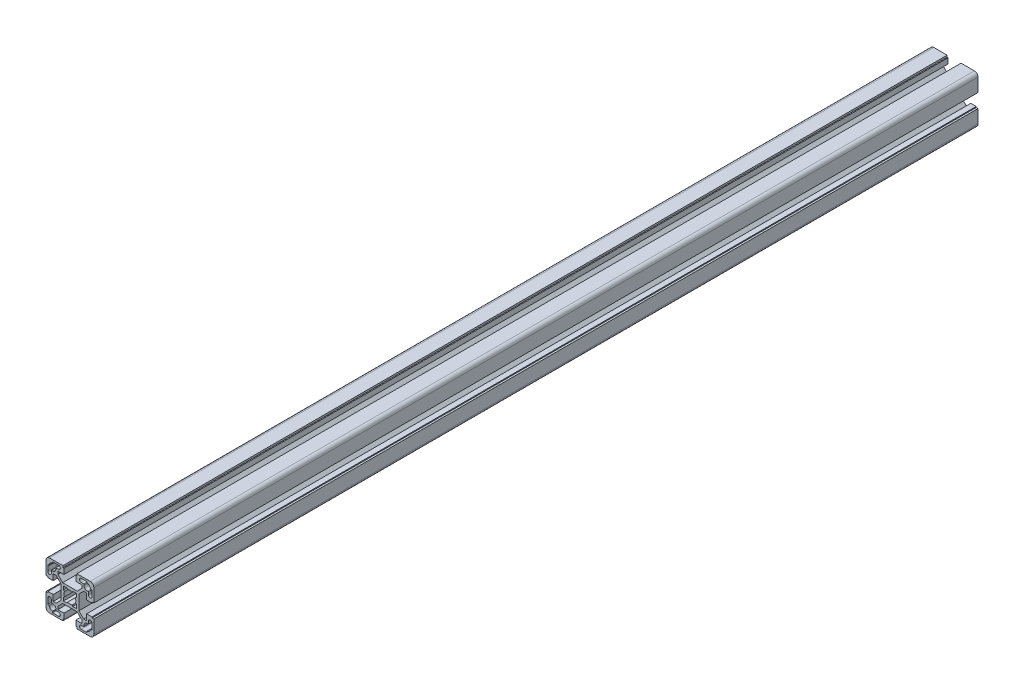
ISO-10303-21;
HEADER;
FILE_DESCRIPTION(('STEP AP214'),'2;1');
FILE_NAME('part.step','',(''),(''),'','','');
FILE_SCHEMA(('AUTOMOTIVE_DESIGN { 1 0 10303 214 1 1 1 1 }'));
ENDSEC;
DATA;
#1=APPLICATION_CONTEXT('core data for automotive mechanical design processes');
#2=APPLICATION_PROTOCOL_DEFINITION('international standard','automotive_design',2000,#1);
#3=PRODUCT_CONTEXT('',#1,'mechanical');
#4=PRODUCT('Part','Part','',(#3));
#5=PRODUCT_RELATED_PRODUCT_CATEGORY('part','',(#4));
#6=PRODUCT_DEFINITION_FORMATION('','',#4);
#7=PRODUCT_DEFINITION_CONTEXT('part definition',#1,'design');
#8=PRODUCT_DEFINITION('design','',#6,#7);
#9=PRODUCT_DEFINITION_SHAPE('','',#8);
#10=(LENGTH_UNIT() NAMED_UNIT(*) SI_UNIT(.MILLI.,.METRE.));
#11=(NAMED_UNIT(*) PLANE_ANGLE_UNIT() SI_UNIT($,.RADIAN.));
#12=(NAMED_UNIT(*) SI_UNIT($,.STERADIAN.) SOLID_ANGLE_UNIT());
#13=UNCERTAINTY_MEASURE_WITH_UNIT(LENGTH_MEASURE(1.E-05),#10,'distance_accuracy_value','');
#14=(GEOMETRIC_REPRESENTATION_CONTEXT(3) GLOBAL_UNCERTAINTY_ASSIGNED_CONTEXT((#13)) GLOBAL_UNIT_ASSIGNED_CONTEXT((#10,
#11,#12)) REPRESENTATION_CONTEXT('',''));
#15=CARTESIAN_POINT('',(0.,0.,0.));
#16=DIRECTION('',(0.,0.,1.));
#17=DIRECTION('',(1.,0.,0.));
#18=AXIS2_PLACEMENT_3D('',#15,#16,#17);
#19=CARTESIAN_POINT('',(-14.5000000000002,-11.75,740.));
#20=DIRECTION('',(0.,-1.,0.));
#21=DIRECTION('',(1.,0.,0.));
#22=AXIS2_PLACEMENT_3D('',#19,#20,#21);
#23=PLANE('',#22);
#24=DIRECTION('',(1.,0.,0.));
#25=VECTOR('',#24,1.);
#26=CARTESIAN_POINT('',(-14.5000000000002,-11.75,740.));
#27=LINE('',#26,#25);
#28=CARTESIAN_POINT('',(-14.5000000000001,-11.75,740.));
#29=VERTEX_POINT('',#28);
#30=CARTESIAN_POINT('',(-15.5000000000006,-11.75,740.));
#31=VERTEX_POINT('',#30);
#32=EDGE_CURVE('E806',#29,#31,#27,.F.);
#33=ORIENTED_EDGE('',*,*,#32,.T.);
#34=DIRECTION('',(0.,0.,1.));
#35=VECTOR('',#34,1.);
#36=CARTESIAN_POINT('',(-15.5000000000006,-11.75,740.));
#37=LINE('',#36,#35);
#38=CARTESIAN_POINT('',(-15.5000000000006,-11.75,0.));
#39=VERTEX_POINT('',#38);
#40=EDGE_CURVE('E804',#39,#31,#37,.T.);
#41=ORIENTED_EDGE('',*,*,#40,.F.);
#42=DIRECTION('',(1.,0.,0.));
#43=VECTOR('',#42,1.);
#44=CARTESIAN_POINT('',(-14.5000000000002,-11.75,0.));
#45=LINE('',#44,#43);
#46=CARTESIAN_POINT('',(-14.5000000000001,-11.75,0.));
#47=VERTEX_POINT('',#46);
#48=EDGE_CURVE('E20',#39,#47,#45,.T.);
#49=ORIENTED_EDGE('',*,*,#48,.T.);
#50=DIRECTION('',(0.,0.,-1.));
#51=VECTOR('',#50,1.);
#52=CARTESIAN_POINT('',(-14.5000000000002,-11.75,740.));
#53=LINE('',#52,#51);
#54=EDGE_CURVE('E801',#47,#29,#53,.F.);
#55=ORIENTED_EDGE('',*,*,#54,.T.);
#56=EDGE_LOOP('',(#33,#41,#49,#55));
#57=FACE_BOUND('',#56,.T.);
#58=ADVANCED_FACE('F17',(#57),#23,.T.);
#59=CARTESIAN_POINT('',(-11.7500000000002,-15.5,740.));
#60=DIRECTION('',(-1.,0.,0.));
#61=DIRECTION('',(0.,-1.,0.));
#62=AXIS2_PLACEMENT_3D('',#59,#60,#61);
#63=PLANE('',#62);
#64=DIRECTION('',(0.,-1.,0.));
#65=VECTOR('',#64,1.);
#66=CARTESIAN_POINT('',(-11.7500000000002,-15.5,740.));
#67=LINE('',#66,#65);
#68=CARTESIAN_POINT('',(-11.7500000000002,-15.5,740.));
#69=VERTEX_POINT('',#68);
#70=CARTESIAN_POINT('',(-11.7500000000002,-14.5,740.));
#71=VERTEX_POINT('',#70);
#72=EDGE_CURVE('E1218',#69,#71,#67,.F.);
#73=ORIENTED_EDGE('',*,*,#72,.T.);
#74=DIRECTION('',(0.,0.,-1.));
#75=VECTOR('',#74,1.);
#76=CARTESIAN_POINT('',(-11.7500000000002,-14.5,740.));
#77=LINE('',#76,#75);
#78=CARTESIAN_POINT('',(-11.7500000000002,-14.5,0.));
#79=VERTEX_POINT('',#78);
#80=EDGE_CURVE('E814',#71,#79,#77,.T.);
#81=ORIENTED_EDGE('',*,*,#80,.T.);
#82=DIRECTION('',(0.,-1.,0.));
#83=VECTOR('',#82,1.);
#84=CARTESIAN_POINT('',(-11.7500000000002,-15.5,0.));
#85=LINE('',#84,#83);
#86=CARTESIAN_POINT('',(-11.7500000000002,-15.5,0.));
#87=VERTEX_POINT('',#86);
#88=EDGE_CURVE('E819',#79,#87,#85,.T.);
#89=ORIENTED_EDGE('',*,*,#88,.T.);
#90=DIRECTION('',(0.,0.,-1.));
#91=VECTOR('',#90,1.);
#92=CARTESIAN_POINT('',(-11.7500000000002,-15.5,740.));
#93=LINE('',#92,#91);
#94=EDGE_CURVE('E1262',#69,#87,#93,.T.);
#95=ORIENTED_EDGE('',*,*,#94,.F.);
#96=EDGE_LOOP('',(#73,#81,#89,#95));
#97=FACE_BOUND('',#96,.T.);
#98=ADVANCED_FACE('F1555',(#97),#63,.T.);
#99=CARTESIAN_POINT('',(-14.5000000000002,-17.25,740.));
#100=DIRECTION('',(1.,0.,0.));
#101=DIRECTION('',(0.,0.,-1.));
#102=AXIS2_PLACEMENT_3D('',#99,#100,#101);
#103=PLANE('',#102);
#104=DIRECTION('',(0.,1.,0.));
#105=VECTOR('',#104,1.);
#106=CARTESIAN_POINT('',(-14.5000000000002,-17.25,740.));
#107=LINE('',#106,#105);
#108=CARTESIAN_POINT('',(-14.5000000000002,-17.25,740.));
#109=VERTEX_POINT('',#108);
#110=CARTESIAN_POINT('',(-14.5000000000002,-18.5,740.));
#111=VERTEX_POINT('',#110);
#112=EDGE_CURVE('E1214',#109,#111,#107,.F.);
#113=ORIENTED_EDGE('',*,*,#112,.T.);
#114=DIRECTION('',(0.,0.,1.));
#115=VECTOR('',#114,1.);
#116=CARTESIAN_POINT('',(-14.5000000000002,-18.5,740.));
#117=LINE('',#116,#115);
#118=CARTESIAN_POINT('',(-14.5000000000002,-18.5,0.));
#119=VERTEX_POINT('',#118);
#120=EDGE_CURVE('E1256',#119,#111,#117,.T.);
#121=ORIENTED_EDGE('',*,*,#120,.F.);
#122=DIRECTION('',(0.,1.,0.));
#123=VECTOR('',#122,1.);
#124=CARTESIAN_POINT('',(-14.5000000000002,-17.25,0.));
#125=LINE('',#124,#123);
#126=CARTESIAN_POINT('',(-14.5000000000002,-17.25,0.));
#127=VERTEX_POINT('',#126);
#128=EDGE_CURVE('E1216',#119,#127,#125,.T.);
#129=ORIENTED_EDGE('',*,*,#128,.T.);
#130=DIRECTION('',(0.,0.,-1.));
#131=VECTOR('',#130,1.);
#132=CARTESIAN_POINT('',(-14.5000000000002,-17.25,740.));
#133=LINE('',#132,#131);
#134=EDGE_CURVE('E1251',#127,#109,#133,.F.);
#135=ORIENTED_EDGE('',*,*,#134,.T.);
#136=EDGE_LOOP('',(#113,#121,#129,#135));
#137=FACE_BOUND('',#136,.T.);
#138=ADVANCED_FACE('F1560',(#137),#103,.T.);
#139=CARTESIAN_POINT('',(-18.5000000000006,-14.5000000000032,740.));
#140=DIRECTION('',(0.,1.,0.));
#141=DIRECTION('',(0.,0.,1.));
#142=AXIS2_PLACEMENT_3D('',#139,#140,#141);
#143=PLANE('',#142);
#144=DIRECTION('',(1.,0.,0.));
#145=VECTOR('',#144,1.);
#146=CARTESIAN_POINT('',(-18.5000000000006,-14.5000000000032,740.));
#147=LINE('',#146,#145);
#148=CARTESIAN_POINT('',(-18.5000000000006,-14.5000000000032,740.));
#149=VERTEX_POINT('',#148);
#150=CARTESIAN_POINT('',(-17.2500000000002,-14.5000000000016,740.));
#151=VERTEX_POINT('',#150);
#152=EDGE_CURVE('E1210',#149,#151,#147,.T.);
#153=ORIENTED_EDGE('',*,*,#152,.T.);
#154=DIRECTION('',(0.,0.,-1.));
#155=VECTOR('',#154,1.);
#156=CARTESIAN_POINT('',(-17.2500000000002,-14.5,740.));
#157=LINE('',#156,#155);
#158=CARTESIAN_POINT('',(-17.2500000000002,-14.5000000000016,0.));
#159=VERTEX_POINT('',#158);
#160=EDGE_CURVE('E1248',#151,#159,#157,.T.);
#161=ORIENTED_EDGE('',*,*,#160,.T.);
#162=DIRECTION('',(1.,0.,0.));
#163=VECTOR('',#162,1.);
#164=CARTESIAN_POINT('',(-18.5000000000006,-14.5000000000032,0.));
#165=LINE('',#164,#163);
#166=CARTESIAN_POINT('',(-18.5000000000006,-14.5000000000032,0.));
#167=VERTEX_POINT('',#166);
#168=EDGE_CURVE('E1212',#159,#167,#165,.F.);
#169=ORIENTED_EDGE('',*,*,#168,.T.);
#170=DIRECTION('',(0.,0.,-1.));
#171=VECTOR('',#170,1.);
#172=CARTESIAN_POINT('',(-18.5000000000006,-14.5000000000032,740.));
#173=LINE('',#172,#171);
#174=EDGE_CURVE('E1242',#149,#167,#173,.T.);
#175=ORIENTED_EDGE('',*,*,#174,.F.);
#176=EDGE_LOOP('',(#153,#161,#169,#175));
#177=FACE_BOUND('',#176,.T.);
#178=ADVANCED_FACE('F1569',(#177),#143,.T.);
#179=CARTESIAN_POINT('',(18.5000000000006,-14.5000000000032,740.));
#180=DIRECTION('',(0.,1.,0.));
#181=DIRECTION('',(0.,0.,1.));
#182=AXIS2_PLACEMENT_3D('',#179,#180,#181);
#183=PLANE('',#182);
#184=DIRECTION('',(1.,0.,0.));
#185=VECTOR('',#184,1.);
#186=CARTESIAN_POINT('',(18.5000000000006,-14.5000000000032,740.));
#187=LINE('',#186,#185);
#188=CARTESIAN_POINT('',(17.2500000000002,-14.5000000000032,740.));
#189=VERTEX_POINT('',#188);
#190=CARTESIAN_POINT('',(18.5000000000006,-14.5000000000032,740.));
#191=VERTEX_POINT('',#190);
#192=EDGE_CURVE('E1206',#189,#191,#187,.T.);
#193=ORIENTED_EDGE('',*,*,#192,.T.);
#194=DIRECTION('',(0.,0.,1.));
#195=VECTOR('',#194,1.);
#196=CARTESIAN_POINT('',(18.5000000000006,-14.5000000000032,740.));
#197=LINE('',#196,#195);
#198=CARTESIAN_POINT('',(18.5000000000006,-14.5000000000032,0.));
#199=VERTEX_POINT('',#198);
#200=EDGE_CURVE('E1947',#199,#191,#197,.T.);
#201=ORIENTED_EDGE('',*,*,#200,.F.);
#202=DIRECTION('',(1.,0.,0.));
#203=VECTOR('',#202,1.);
#204=CARTESIAN_POINT('',(18.5000000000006,-14.5000000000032,0.));
#205=LINE('',#204,#203);
#206=CARTESIAN_POINT('',(17.2500000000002,-14.5000000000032,0.));
#207=VERTEX_POINT('',#206);
#208=EDGE_CURVE('E1208',#199,#207,#205,.F.);
#209=ORIENTED_EDGE('',*,*,#208,.T.);
#210=DIRECTION('',(0.,0.,-1.));
#211=VECTOR('',#210,1.);
#212=CARTESIAN_POINT('',(17.2500000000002,-14.5000000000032,740.));
#213=LINE('',#212,#211);
#214=EDGE_CURVE('E1952',#207,#189,#213,.F.);
#215=ORIENTED_EDGE('',*,*,#214,.T.);
#216=EDGE_LOOP('',(#193,#201,#209,#215));
#217=FACE_BOUND('',#216,.T.);
#218=ADVANCED_FACE('F2472',(#217),#183,.T.);
#219=CARTESIAN_POINT('',(14.5000000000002,-17.25,740.));
#220=DIRECTION('',(-1.,0.,0.));
#221=DIRECTION('',(0.,0.,1.));
#222=AXIS2_PLACEMENT_3D('',#219,#220,#221);
#223=PLANE('',#222);
#224=DIRECTION('',(0.,1.,0.));
#225=VECTOR('',#224,1.);
#226=CARTESIAN_POINT('',(14.5000000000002,-17.25,740.));
#227=LINE('',#226,#225);
#228=CARTESIAN_POINT('',(14.5000000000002,-18.5,740.));
#229=VERTEX_POINT('',#228);
#230=CARTESIAN_POINT('',(14.5000000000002,-17.25,740.));
#231=VERTEX_POINT('',#230);
#232=EDGE_CURVE('E1202',#229,#231,#227,.T.);
#233=ORIENTED_EDGE('',*,*,#232,.T.);
#234=DIRECTION('',(0.,0.,-1.));
#235=VECTOR('',#234,1.);
#236=CARTESIAN_POINT('',(14.5000000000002,-17.25,740.));
#237=LINE('',#236,#235);
#238=CARTESIAN_POINT('',(14.5000000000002,-17.25,0.));
#239=VERTEX_POINT('',#238);
#240=EDGE_CURVE('E1955',#231,#239,#237,.T.);
#241=ORIENTED_EDGE('',*,*,#240,.T.);
#242=DIRECTION('',(0.,1.,0.));
#243=VECTOR('',#242,1.);
#244=CARTESIAN_POINT('',(14.5000000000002,-17.25,0.));
#245=LINE('',#244,#243);
#246=CARTESIAN_POINT('',(14.5000000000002,-18.5,0.));
#247=VERTEX_POINT('',#246);
#248=EDGE_CURVE('E1204',#239,#247,#245,.F.);
#249=ORIENTED_EDGE('',*,*,#248,.T.);
#250=DIRECTION('',(0.,0.,1.));
#251=VECTOR('',#250,1.);
#252=CARTESIAN_POINT('',(14.5000000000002,-18.5,740.));
#253=LINE('',#252,#251);
#254=EDGE_CURVE('E1958',#229,#247,#253,.F.);
#255=ORIENTED_EDGE('',*,*,#254,.F.);
#256=EDGE_LOOP('',(#233,#241,#249,#255));
#257=FACE_BOUND('',#256,.T.);
#258=ADVANCED_FACE('F2468',(#257),#223,.T.);
#259=CARTESIAN_POINT('',(11.7500000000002,-15.5,740.));
#260=DIRECTION('',(1.,0.,0.));
#261=DIRECTION('',(0.,1.,0.));
#262=AXIS2_PLACEMENT_3D('',#259,#260,#261);
#263=PLANE('',#262);
#264=DIRECTION('',(0.,1.,0.));
#265=VECTOR('',#264,1.);
#266=CARTESIAN_POINT('',(11.7500000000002,-15.5,740.));
#267=LINE('',#266,#265);
#268=CARTESIAN_POINT('',(11.7500000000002,-14.5,740.));
#269=VERTEX_POINT('',#268);
#270=CARTESIAN_POINT('',(11.7500000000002,-15.5,740.));
#271=VERTEX_POINT('',#270);
#272=EDGE_CURVE('E1198',#269,#271,#267,.F.);
#273=ORIENTED_EDGE('',*,*,#272,.T.);
#274=DIRECTION('',(0.,0.,-1.));
#275=VECTOR('',#274,1.);
#276=CARTESIAN_POINT('',(11.7500000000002,-15.5,740.));
#277=LINE('',#276,#275);
#278=CARTESIAN_POINT('',(11.7500000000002,-15.5,0.));
#279=VERTEX_POINT('',#278);
#280=EDGE_CURVE('E1964',#279,#271,#277,.F.);
#281=ORIENTED_EDGE('',*,*,#280,.F.);
#282=DIRECTION('',(0.,1.,0.));
#283=VECTOR('',#282,1.);
#284=CARTESIAN_POINT('',(11.7500000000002,-15.5,0.));
#285=LINE('',#284,#283);
#286=CARTESIAN_POINT('',(11.7500000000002,-14.5,0.));
#287=VERTEX_POINT('',#286);
#288=EDGE_CURVE('E1200',#279,#287,#285,.T.);
#289=ORIENTED_EDGE('',*,*,#288,.T.);
#290=DIRECTION('',(0.,0.,-1.));
#291=VECTOR('',#290,1.);
#292=CARTESIAN_POINT('',(11.7500000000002,-14.5,740.));
#293=LINE('',#292,#291);
#294=EDGE_CURVE('E1969',#287,#269,#293,.F.);
#295=ORIENTED_EDGE('',*,*,#294,.T.);
#296=EDGE_LOOP('',(#273,#281,#289,#295));
#297=FACE_BOUND('',#296,.T.);
#298=ADVANCED_FACE('F2465',(#297),#263,.T.);
#299=CARTESIAN_POINT('',(14.5000000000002,-11.75,740.));
#300=DIRECTION('',(0.,-1.,0.));
#301=DIRECTION('',(1.,0.,0.));
#302=AXIS2_PLACEMENT_3D('',#299,#300,#301);
#303=PLANE('',#302);
#304=DIRECTION('',(1.,0.,0.));
#305=VECTOR('',#304,1.);
#306=CARTESIAN_POINT('',(14.5000000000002,-11.75,740.));
#307=LINE('',#306,#305);
#308=CARTESIAN_POINT('',(15.5000000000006,-11.75,740.));
#309=VERTEX_POINT('',#308);
#310=CARTESIAN_POINT('',(14.5000000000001,-11.75,740.));
#311=VERTEX_POINT('',#310);
#312=EDGE_CURVE('E1194',#309,#311,#307,.F.);
#313=ORIENTED_EDGE('',*,*,#312,.T.);
#314=DIRECTION('',(0.,0.,-1.));
#315=VECTOR('',#314,1.);
#316=CARTESIAN_POINT('',(14.5000000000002,-11.75,740.));
#317=LINE('',#316,#315);
#318=CARTESIAN_POINT('',(14.5000000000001,-11.75,0.));
#319=VERTEX_POINT('',#318);
#320=EDGE_CURVE('E1940',#311,#319,#317,.T.);
#321=ORIENTED_EDGE('',*,*,#320,.T.);
#322=DIRECTION('',(1.,0.,0.));
#323=VECTOR('',#322,1.);
#324=CARTESIAN_POINT('',(14.5000000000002,-11.75,0.));
#325=LINE('',#324,#323);
#326=CARTESIAN_POINT('',(15.5000000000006,-11.75,0.));
#327=VERTEX_POINT('',#326);
#328=EDGE_CURVE('E1196',#319,#327,#325,.T.);
#329=ORIENTED_EDGE('',*,*,#328,.T.);
#330=DIRECTION('',(0.,0.,-1.));
#331=VECTOR('',#330,1.);
#332=CARTESIAN_POINT('',(15.5000000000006,-11.75,740.));
#333=LINE('',#332,#331);
#334=EDGE_CURVE('E1237',#309,#327,#333,.T.);
#335=ORIENTED_EDGE('',*,*,#334,.F.);
#336=EDGE_LOOP('',(#313,#321,#329,#335));
#337=FACE_BOUND('',#336,.T.);
#338=ADVANCED_FACE('F1939',(#337),#303,.T.);
#339=CARTESIAN_POINT('',(5.80000000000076,-18.5000000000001,740.));
#340=DIRECTION('',(1.,0.,0.));
#341=DIRECTION('',(0.,0.,-1.));
#342=AXIS2_PLACEMENT_3D('',#339,#340,#341);
#343=PLANE('',#342);
#344=DIRECTION('',(0.,0.,1.));
#345=VECTOR('',#344,1.);
#346=CARTESIAN_POINT('',(5.80000000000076,-20.,740.));
#347=LINE('',#346,#345);
#348=CARTESIAN_POINT('',(5.80000000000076,-20.,0.));
#349=VERTEX_POINT('',#348);
#350=CARTESIAN_POINT('',(5.80000000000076,-20.,740.));
#351=VERTEX_POINT('',#350);
#352=EDGE_CURVE('E1973',#349,#351,#347,.T.);
#353=ORIENTED_EDGE('',*,*,#352,.T.);
#354=DIRECTION('',(0.,1.,0.));
#355=VECTOR('',#354,1.);
#356=CARTESIAN_POINT('',(5.80000000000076,-17.,740.));
#357=LINE('',#356,#355);
#358=CARTESIAN_POINT('',(5.80000000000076,-18.5000000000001,740.));
#359=VERTEX_POINT('',#358);
#360=EDGE_CURVE('E1192',#359,#351,#357,.F.);
#361=ORIENTED_EDGE('',*,*,#360,.F.);
#362=DIRECTION('',(0.,0.,1.));
#363=VECTOR('',#362,1.);
#364=CARTESIAN_POINT('',(5.80000000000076,-18.5000000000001,740.));
#365=LINE('',#364,#363);
#366=CARTESIAN_POINT('',(5.80000000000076,-18.5000000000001,0.));
#367=VERTEX_POINT('',#366);
#368=EDGE_CURVE('E1116',#359,#367,#365,.F.);
#369=ORIENTED_EDGE('',*,*,#368,.T.);
#370=DIRECTION('',(0.,1.,0.));
#371=VECTOR('',#370,1.);
#372=CARTESIAN_POINT('',(5.80000000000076,-17.,0.));
#373=LINE('',#372,#371);
#374=EDGE_CURVE('E1190',#349,#367,#373,.T.);
#375=ORIENTED_EDGE('',*,*,#374,.F.);
#376=EDGE_LOOP('',(#353,#361,#369,#375));
#377=FACE_BOUND('',#376,.T.);
#378=ADVANCED_FACE('F2286',(#377),#343,.F.);
#379=CARTESIAN_POINT('',(20.,-5.79999999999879,740.));
#380=DIRECTION('',(0.,-1.,0.));
#381=DIRECTION('',(0.,0.,-1.));
#382=AXIS2_PLACEMENT_3D('',#379,#380,#381);
#383=PLANE('',#382);
#384=DIRECTION('',(0.,0.,1.));
#385=VECTOR('',#384,1.);
#386=CARTESIAN_POINT('',(18.5,-5.79999999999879,740.));
#387=LINE('',#386,#385);
#388=CARTESIAN_POINT('',(18.5,-5.79999999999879,0.));
#389=VERTEX_POINT('',#388);
#390=CARTESIAN_POINT('',(18.5,-5.79999999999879,740.));
#391=VERTEX_POINT('',#390);
#392=EDGE_CURVE('E1185',#389,#391,#387,.T.);
#393=ORIENTED_EDGE('',*,*,#392,.T.);
#394=DIRECTION('',(1.,0.,0.));
#395=VECTOR('',#394,1.);
#396=CARTESIAN_POINT('',(17.,-5.79999999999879,740.));
#397=LINE('',#396,#395);
#398=CARTESIAN_POINT('',(20.,-5.79999999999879,740.));
#399=VERTEX_POINT('',#398);
#400=EDGE_CURVE('E1188',#399,#391,#397,.F.);
#401=ORIENTED_EDGE('',*,*,#400,.F.);
#402=DIRECTION('',(0.,0.,1.));
#403=VECTOR('',#402,1.);
#404=CARTESIAN_POINT('',(20.,-5.79999999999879,740.));
#405=LINE('',#404,#403);
#406=CARTESIAN_POINT('',(20.,-5.79999999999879,0.));
#407=VERTEX_POINT('',#406);
#408=EDGE_CURVE('E1981',#399,#407,#405,.F.);
#409=ORIENTED_EDGE('',*,*,#408,.T.);
#410=DIRECTION('',(1.,0.,0.));
#411=VECTOR('',#410,1.);
#412=CARTESIAN_POINT('',(17.,-5.79999999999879,0.));
#413=LINE('',#412,#411);
#414=EDGE_CURVE('E1186',#389,#407,#413,.T.);
#415=ORIENTED_EDGE('',*,*,#414,.F.);
#416=EDGE_LOOP('',(#393,#401,#409,#415));
#417=FACE_BOUND('',#416,.T.);
#418=ADVANCED_FACE('F2294',(#417),#383,.F.);
#419=CARTESIAN_POINT('',(18.5,-5.79999999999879,740.));
#420=DIRECTION('',(-1.,0.,0.));
#421=DIRECTION('',(0.,0.,1.));
#422=AXIS2_PLACEMENT_3D('',#419,#420,#421);
#423=PLANE('',#422);
#424=DIRECTION('',(0.,0.,-1.));
#425=VECTOR('',#424,1.);
#426=CARTESIAN_POINT('',(18.5,-4.99999999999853,740.));
#427=LINE('',#426,#425);
#428=CARTESIAN_POINT('',(18.5,-4.99999999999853,0.));
#429=VERTEX_POINT('',#428);
#430=CARTESIAN_POINT('',(18.5,-4.99999999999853,740.));
#431=VERTEX_POINT('',#430);
#432=EDGE_CURVE('E1984',#429,#431,#427,.F.);
#433=ORIENTED_EDGE('',*,*,#432,.T.);
#434=DIRECTION('',(0.,1.,0.));
#435=VECTOR('',#434,1.);
#436=CARTESIAN_POINT('',(18.5,-17.,740.));
#437=LINE('',#436,#435);
#438=EDGE_CURVE('E1183',#391,#431,#437,.T.);
#439=ORIENTED_EDGE('',*,*,#438,.F.);
#440=ORIENTED_EDGE('',*,*,#392,.F.);
#441=DIRECTION('',(0.,1.,0.));
#442=VECTOR('',#441,1.);
#443=CARTESIAN_POINT('',(18.5,-17.,0.));
#444=LINE('',#443,#442);
#445=EDGE_CURVE('E1180',#429,#389,#444,.F.);
#446=ORIENTED_EDGE('',*,*,#445,.F.);
#447=EDGE_LOOP('',(#433,#439,#440,#446));
#448=FACE_BOUND('',#447,.T.);
#449=ADVANCED_FACE('F2297',(#448),#423,.F.);
#450=CARTESIAN_POINT('',(18.5,5.79999999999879,740.));
#451=DIRECTION('',(-1.,0.,0.));
#452=DIRECTION('',(0.,0.,1.));
#453=AXIS2_PLACEMENT_3D('',#450,#451,#452);
#454=PLANE('',#453);
#455=DIRECTION('',(0.,0.,1.));
#456=VECTOR('',#455,1.);
#457=CARTESIAN_POINT('',(18.5,5.79999999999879,740.));
#458=LINE('',#457,#456);
#459=CARTESIAN_POINT('',(18.5,5.79999999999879,0.));
#460=VERTEX_POINT('',#459);
#461=CARTESIAN_POINT('',(18.5,5.79999999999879,740.));
#462=VERTEX_POINT('',#461);
#463=EDGE_CURVE('E1175',#460,#462,#458,.T.);
#464=ORIENTED_EDGE('',*,*,#463,.T.);
#465=DIRECTION('',(0.,1.,0.));
#466=VECTOR('',#465,1.);
#467=CARTESIAN_POINT('',(18.5,-17.,740.));
#468=LINE('',#467,#466);
#469=CARTESIAN_POINT('',(18.5,4.99999999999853,740.));
#470=VERTEX_POINT('',#469);
#471=EDGE_CURVE('E1178',#470,#462,#468,.T.);
#472=ORIENTED_EDGE('',*,*,#471,.F.);
#473=DIRECTION('',(0.,0.,1.));
#474=VECTOR('',#473,1.);
#475=CARTESIAN_POINT('',(18.5,4.99999999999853,740.));
#476=LINE('',#475,#474);
#477=CARTESIAN_POINT('',(18.5,4.99999999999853,0.));
#478=VERTEX_POINT('',#477);
#479=EDGE_CURVE('E2011',#470,#478,#476,.F.);
#480=ORIENTED_EDGE('',*,*,#479,.T.);
#481=DIRECTION('',(0.,1.,0.));
#482=VECTOR('',#481,1.);
#483=CARTESIAN_POINT('',(18.5,-17.,0.));
#484=LINE('',#483,#482);
#485=EDGE_CURVE('E1176',#460,#478,#484,.F.);
#486=ORIENTED_EDGE('',*,*,#485,.F.);
#487=EDGE_LOOP('',(#464,#472,#480,#486));
#488=FACE_BOUND('',#487,.T.);
#489=ADVANCED_FACE('F2319',(#488),#454,.F.);
#490=CARTESIAN_POINT('',(20.,5.79999999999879,740.));
#491=DIRECTION('',(0.,1.,0.));
#492=DIRECTION('',(0.,0.,1.));
#493=AXIS2_PLACEMENT_3D('',#490,#491,#492);
#494=PLANE('',#493);
#495=DIRECTION('',(0.,0.,1.));
#496=VECTOR('',#495,1.);
#497=CARTESIAN_POINT('',(20.,5.79999999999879,740.));
#498=LINE('',#497,#496);
#499=CARTESIAN_POINT('',(20.,5.79999999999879,0.));
#500=VERTEX_POINT('',#499);
#501=CARTESIAN_POINT('',(20.,5.79999999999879,740.));
#502=VERTEX_POINT('',#501);
#503=EDGE_CURVE('E2014',#500,#502,#498,.T.);
#504=ORIENTED_EDGE('',*,*,#503,.T.);
#505=DIRECTION('',(1.,0.,0.));
#506=VECTOR('',#505,1.);
#507=CARTESIAN_POINT('',(17.,5.79999999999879,740.));
#508=LINE('',#507,#506);
#509=EDGE_CURVE('E1173',#462,#502,#508,.T.);
#510=ORIENTED_EDGE('',*,*,#509,.F.);
#511=ORIENTED_EDGE('',*,*,#463,.F.);
#512=DIRECTION('',(1.,0.,0.));
#513=VECTOR('',#512,1.);
#514=CARTESIAN_POINT('',(17.,5.79999999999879,0.));
#515=LINE('',#514,#513);
#516=EDGE_CURVE('E1170',#500,#460,#515,.F.);
#517=ORIENTED_EDGE('',*,*,#516,.F.);
#518=EDGE_LOOP('',(#504,#510,#511,#517));
#519=FACE_BOUND('',#518,.T.);
#520=ADVANCED_FACE('F2323',(#519),#494,.F.);
#521=CARTESIAN_POINT('',(5.80000000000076,18.5000000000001,740.));
#522=DIRECTION('',(1.,0.,0.));
#523=DIRECTION('',(0.,0.,-1.));
#524=AXIS2_PLACEMENT_3D('',#521,#522,#523);
#525=PLANE('',#524);
#526=DIRECTION('',(0.,0.,-1.));
#527=VECTOR('',#526,1.);
#528=CARTESIAN_POINT('',(5.80000000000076,18.5000000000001,740.));
#529=LINE('',#528,#527);
#530=CARTESIAN_POINT('',(5.80000000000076,18.5000000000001,0.));
#531=VERTEX_POINT('',#530);
#532=CARTESIAN_POINT('',(5.80000000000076,18.5000000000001,740.));
#533=VERTEX_POINT('',#532);
#534=EDGE_CURVE('E1165',#531,#533,#529,.F.);
#535=ORIENTED_EDGE('',*,*,#534,.T.);
#536=DIRECTION('',(0.,1.,0.));
#537=VECTOR('',#536,1.);
#538=CARTESIAN_POINT('',(5.80000000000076,-17.,740.));
#539=LINE('',#538,#537);
#540=CARTESIAN_POINT('',(5.80000000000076,20.,740.));
#541=VERTEX_POINT('',#540);
#542=EDGE_CURVE('E1168',#541,#533,#539,.F.);
#543=ORIENTED_EDGE('',*,*,#542,.F.);
#544=DIRECTION('',(0.,0.,-1.));
#545=VECTOR('',#544,1.);
#546=CARTESIAN_POINT('',(5.80000000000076,20.,740.));
#547=LINE('',#546,#545);
#548=CARTESIAN_POINT('',(5.80000000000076,20.,0.));
#549=VERTEX_POINT('',#548);
#550=EDGE_CURVE('E2022',#541,#549,#547,.T.);
#551=ORIENTED_EDGE('',*,*,#550,.T.);
#552=DIRECTION('',(0.,1.,0.));
#553=VECTOR('',#552,1.);
#554=CARTESIAN_POINT('',(5.80000000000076,-17.,0.));
#555=LINE('',#554,#553);
#556=EDGE_CURVE('E1166',#531,#549,#555,.T.);
#557=ORIENTED_EDGE('',*,*,#556,.F.);
#558=EDGE_LOOP('',(#535,#543,#551,#557));
#559=FACE_BOUND('',#558,.T.);
#560=ADVANCED_FACE('F2334',(#559),#525,.F.);
#561=CARTESIAN_POINT('',(5.00000000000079,18.5000000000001,740.));
#562=DIRECTION('',(0.,-1.,0.));
#563=DIRECTION('',(0.,0.,-1.));
#564=AXIS2_PLACEMENT_3D('',#561,#562,#563);
#565=PLANE('',#564);
#566=DIRECTION('',(0.,0.,1.));
#567=VECTOR('',#566,1.);
#568=CARTESIAN_POINT('',(5.00000000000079,18.5000000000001,740.));
#569=LINE('',#568,#567);
#570=CARTESIAN_POINT('',(5.00000000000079,18.5000000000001,0.));
#571=VERTEX_POINT('',#570);
#572=CARTESIAN_POINT('',(5.00000000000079,18.5000000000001,740.));
#573=VERTEX_POINT('',#572);
#574=EDGE_CURVE('E2025',#571,#573,#569,.T.);
#575=ORIENTED_EDGE('',*,*,#574,.T.);
#576=DIRECTION('',(1.,0.,0.));
#577=VECTOR('',#576,1.);
#578=CARTESIAN_POINT('',(17.,18.5000000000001,740.));
#579=LINE('',#578,#577);
#580=EDGE_CURVE('E1163',#533,#573,#579,.F.);
#581=ORIENTED_EDGE('',*,*,#580,.F.);
#582=ORIENTED_EDGE('',*,*,#534,.F.);
#583=DIRECTION('',(1.,0.,0.));
#584=VECTOR('',#583,1.);
#585=CARTESIAN_POINT('',(17.,18.5000000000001,0.));
#586=LINE('',#585,#584);
#587=EDGE_CURVE('E1160',#571,#531,#586,.T.);
#588=ORIENTED_EDGE('',*,*,#587,.F.);
#589=EDGE_LOOP('',(#575,#581,#582,#588));
#590=FACE_BOUND('',#589,.T.);
#591=ADVANCED_FACE('F2338',(#590),#565,.F.);
#592=CARTESIAN_POINT('',(-5.00000000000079,18.5000000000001,740.));
#593=DIRECTION('',(0.,-1.,0.));
#594=DIRECTION('',(0.,0.,-1.));
#595=AXIS2_PLACEMENT_3D('',#592,#593,#594);
#596=PLANE('',#595);
#597=DIRECTION('',(0.,0.,1.));
#598=VECTOR('',#597,1.);
#599=CARTESIAN_POINT('',(-5.80000000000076,18.5000000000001,740.));
#600=LINE('',#599,#598);
#601=CARTESIAN_POINT('',(-5.80000000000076,18.5000000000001,0.));
#602=VERTEX_POINT('',#601);
#603=CARTESIAN_POINT('',(-5.80000000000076,18.5000000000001,740.));
#604=VERTEX_POINT('',#603);
#605=EDGE_CURVE('E1155',#602,#604,#600,.T.);
#606=ORIENTED_EDGE('',*,*,#605,.T.);
#607=DIRECTION('',(1.,0.,0.));
#608=VECTOR('',#607,1.);
#609=CARTESIAN_POINT('',(17.,18.5000000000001,740.));
#610=LINE('',#609,#608);
#611=CARTESIAN_POINT('',(-5.00000000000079,18.5000000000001,740.));
#612=VERTEX_POINT('',#611);
#613=EDGE_CURVE('E1158',#612,#604,#610,.F.);
#614=ORIENTED_EDGE('',*,*,#613,.F.);
#615=DIRECTION('',(0.,0.,1.));
#616=VECTOR('',#615,1.);
#617=CARTESIAN_POINT('',(-5.00000000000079,18.5000000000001,740.));
#618=LINE('',#617,#616);
#619=CARTESIAN_POINT('',(-5.00000000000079,18.5000000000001,0.));
#620=VERTEX_POINT('',#619);
#621=EDGE_CURVE('E2052',#612,#620,#618,.F.);
#622=ORIENTED_EDGE('',*,*,#621,.T.);
#623=DIRECTION('',(1.,0.,0.));
#624=VECTOR('',#623,1.);
#625=CARTESIAN_POINT('',(17.,18.5000000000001,0.));
#626=LINE('',#625,#624);
#627=EDGE_CURVE('E1156',#602,#620,#626,.T.);
#628=ORIENTED_EDGE('',*,*,#627,.F.);
#629=EDGE_LOOP('',(#606,#614,#622,#628));
#630=FACE_BOUND('',#629,.T.);
#631=ADVANCED_FACE('F2360',(#630),#596,.F.);
#632=CARTESIAN_POINT('',(-5.80000000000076,18.5000000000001,740.));
#633=DIRECTION('',(-1.,0.,0.));
#634=DIRECTION('',(0.,0.,1.));
#635=AXIS2_PLACEMENT_3D('',#632,#633,#634);
#636=PLANE('',#635);
#637=DIRECTION('',(0.,0.,1.));
#638=VECTOR('',#637,1.);
#639=CARTESIAN_POINT('',(-5.80000000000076,20.,740.));
#640=LINE('',#639,#638);
#641=CARTESIAN_POINT('',(-5.80000000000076,20.,0.));
#642=VERTEX_POINT('',#641);
#643=CARTESIAN_POINT('',(-5.80000000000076,20.,740.));
#644=VERTEX_POINT('',#643);
#645=EDGE_CURVE('E2055',#642,#644,#640,.T.);
#646=ORIENTED_EDGE('',*,*,#645,.T.);
#647=DIRECTION('',(0.,1.,0.));
#648=VECTOR('',#647,1.);
#649=CARTESIAN_POINT('',(-5.80000000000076,-17.,740.));
#650=LINE('',#649,#648);
#651=EDGE_CURVE('E1153',#604,#644,#650,.T.);
#652=ORIENTED_EDGE('',*,*,#651,.F.);
#653=ORIENTED_EDGE('',*,*,#605,.F.);
#654=DIRECTION('',(0.,1.,0.));
#655=VECTOR('',#654,1.);
#656=CARTESIAN_POINT('',(-5.80000000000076,-17.,0.));
#657=LINE('',#656,#655);
#658=EDGE_CURVE('E1150',#642,#602,#657,.F.);
#659=ORIENTED_EDGE('',*,*,#658,.F.);
#660=EDGE_LOOP('',(#646,#652,#653,#659));
#661=FACE_BOUND('',#660,.T.);
#662=ADVANCED_FACE('F2364',(#661),#636,.F.);
#663=CARTESIAN_POINT('',(-20.,5.79999999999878,740.));
#664=DIRECTION('',(0.,1.,0.));
#665=DIRECTION('',(0.,0.,1.));
#666=AXIS2_PLACEMENT_3D('',#663,#664,#665);
#667=PLANE('',#666);
#668=DIRECTION('',(0.,0.,-1.));
#669=VECTOR('',#668,1.);
#670=CARTESIAN_POINT('',(-18.5,5.79999999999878,740.));
#671=LINE('',#670,#669);
#672=CARTESIAN_POINT('',(-18.5,5.79999999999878,0.));
#673=VERTEX_POINT('',#672);
#674=CARTESIAN_POINT('',(-18.5,5.79999999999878,740.));
#675=VERTEX_POINT('',#674);
#676=EDGE_CURVE('E1145',#673,#675,#671,.F.);
#677=ORIENTED_EDGE('',*,*,#676,.T.);
#678=DIRECTION('',(1.,0.,0.));
#679=VECTOR('',#678,1.);
#680=CARTESIAN_POINT('',(17.,5.79999999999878,740.));
#681=LINE('',#680,#679);
#682=CARTESIAN_POINT('',(-20.,5.79999999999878,740.));
#683=VERTEX_POINT('',#682);
#684=EDGE_CURVE('E1148',#683,#675,#681,.T.);
#685=ORIENTED_EDGE('',*,*,#684,.F.);
#686=DIRECTION('',(0.,0.,1.));
#687=VECTOR('',#686,1.);
#688=CARTESIAN_POINT('',(-20.,5.79999999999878,740.));
#689=LINE('',#688,#687);
#690=CARTESIAN_POINT('',(-20.,5.79999999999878,0.));
#691=VERTEX_POINT('',#690);
#692=EDGE_CURVE('E2063',#683,#691,#689,.F.);
#693=ORIENTED_EDGE('',*,*,#692,.T.);
#694=DIRECTION('',(1.,0.,0.));
#695=VECTOR('',#694,1.);
#696=CARTESIAN_POINT('',(17.,5.79999999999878,0.));
#697=LINE('',#696,#695);
#698=EDGE_CURVE('E1146',#673,#691,#697,.F.);
#699=ORIENTED_EDGE('',*,*,#698,.F.);
#700=EDGE_LOOP('',(#677,#685,#693,#699));
#701=FACE_BOUND('',#700,.T.);
#702=ADVANCED_FACE('F2375',(#701),#667,.F.);
#703=CARTESIAN_POINT('',(-18.5,5.79999999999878,740.));
#704=DIRECTION('',(1.,0.,0.));
#705=DIRECTION('',(0.,0.,-1.));
#706=AXIS2_PLACEMENT_3D('',#703,#704,#705);
#707=PLANE('',#706);
#708=DIRECTION('',(0.,0.,1.));
#709=VECTOR('',#708,1.);
#710=CARTESIAN_POINT('',(-18.5,4.99999999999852,740.));
#711=LINE('',#710,#709);
#712=CARTESIAN_POINT('',(-18.5,4.99999999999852,0.));
#713=VERTEX_POINT('',#712);
#714=CARTESIAN_POINT('',(-18.5,4.99999999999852,740.));
#715=VERTEX_POINT('',#714);
#716=EDGE_CURVE('E2066',#713,#715,#711,.T.);
#717=ORIENTED_EDGE('',*,*,#716,.T.);
#718=DIRECTION('',(0.,1.,0.));
#719=VECTOR('',#718,1.);
#720=CARTESIAN_POINT('',(-18.5,-17.,740.));
#721=LINE('',#720,#719);
#722=EDGE_CURVE('E1143',#675,#715,#721,.F.);
#723=ORIENTED_EDGE('',*,*,#722,.F.);
#724=ORIENTED_EDGE('',*,*,#676,.F.);
#725=DIRECTION('',(0.,1.,0.));
#726=VECTOR('',#725,1.);
#727=CARTESIAN_POINT('',(-18.5,-17.,0.));
#728=LINE('',#727,#726);
#729=EDGE_CURVE('E1140',#713,#673,#728,.T.);
#730=ORIENTED_EDGE('',*,*,#729,.F.);
#731=EDGE_LOOP('',(#717,#723,#724,#730));
#732=FACE_BOUND('',#731,.T.);
#733=ADVANCED_FACE('F2379',(#732),#707,.F.);
#734=CARTESIAN_POINT('',(-18.5,-5.79999999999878,740.));
#735=DIRECTION('',(1.,0.,0.));
#736=DIRECTION('',(0.,0.,-1.));
#737=AXIS2_PLACEMENT_3D('',#734,#735,#736);
#738=PLANE('',#737);
#739=DIRECTION('',(0.,0.,-1.));
#740=VECTOR('',#739,1.);
#741=CARTESIAN_POINT('',(-18.5,-5.79999999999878,740.));
#742=LINE('',#741,#740);
#743=CARTESIAN_POINT('',(-18.5,-5.79999999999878,0.));
#744=VERTEX_POINT('',#743);
#745=CARTESIAN_POINT('',(-18.5,-5.79999999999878,740.));
#746=VERTEX_POINT('',#745);
#747=EDGE_CURVE('E1135',#744,#746,#742,.F.);
#748=ORIENTED_EDGE('',*,*,#747,.T.);
#749=DIRECTION('',(0.,1.,0.));
#750=VECTOR('',#749,1.);
#751=CARTESIAN_POINT('',(-18.5,-17.,740.));
#752=LINE('',#751,#750);
#753=CARTESIAN_POINT('',(-18.5,-4.99999999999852,740.));
#754=VERTEX_POINT('',#753);
#755=EDGE_CURVE('E1138',#754,#746,#752,.F.);
#756=ORIENTED_EDGE('',*,*,#755,.F.);
#757=DIRECTION('',(0.,0.,1.));
#758=VECTOR('',#757,1.);
#759=CARTESIAN_POINT('',(-18.5,-4.99999999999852,740.));
#760=LINE('',#759,#758);
#761=CARTESIAN_POINT('',(-18.5,-4.99999999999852,0.));
#762=VERTEX_POINT('',#761);
#763=EDGE_CURVE('E2093',#754,#762,#760,.F.);
#764=ORIENTED_EDGE('',*,*,#763,.T.);
#765=DIRECTION('',(0.,1.,0.));
#766=VECTOR('',#765,1.);
#767=CARTESIAN_POINT('',(-18.5,-17.,0.));
#768=LINE('',#767,#766);
#769=EDGE_CURVE('E1136',#744,#762,#768,.T.);
#770=ORIENTED_EDGE('',*,*,#769,.F.);
#771=EDGE_LOOP('',(#748,#756,#764,#770));
#772=FACE_BOUND('',#771,.T.);
#773=ADVANCED_FACE('F2401',(#772),#738,.F.);
#774=CARTESIAN_POINT('',(-20.,-5.79999999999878,740.));
#775=DIRECTION('',(0.,-1.,0.));
#776=DIRECTION('',(0.,0.,-1.));
#777=AXIS2_PLACEMENT_3D('',#774,#775,#776);
#778=PLANE('',#777);
#779=DIRECTION('',(0.,0.,1.));
#780=VECTOR('',#779,1.);
#781=CARTESIAN_POINT('',(-20.,-5.79999999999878,740.));
#782=LINE('',#781,#780);
#783=CARTESIAN_POINT('',(-20.,-5.79999999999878,0.));
#784=VERTEX_POINT('',#783);
#785=CARTESIAN_POINT('',(-20.,-5.79999999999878,740.));
#786=VERTEX_POINT('',#785);
#787=EDGE_CURVE('E2096',#784,#786,#782,.T.);
#788=ORIENTED_EDGE('',*,*,#787,.T.);
#789=DIRECTION('',(1.,0.,0.));
#790=VECTOR('',#789,1.);
#791=CARTESIAN_POINT('',(17.,-5.79999999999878,740.));
#792=LINE('',#791,#790);
#793=EDGE_CURVE('E1133',#746,#786,#792,.F.);
#794=ORIENTED_EDGE('',*,*,#793,.F.);
#795=ORIENTED_EDGE('',*,*,#747,.F.);
#796=DIRECTION('',(1.,0.,0.));
#797=VECTOR('',#796,1.);
#798=CARTESIAN_POINT('',(17.,-5.79999999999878,0.));
#799=LINE('',#798,#797);
#800=EDGE_CURVE('E1130',#784,#744,#799,.T.);
#801=ORIENTED_EDGE('',*,*,#800,.F.);
#802=EDGE_LOOP('',(#788,#794,#795,#801));
#803=FACE_BOUND('',#802,.T.);
#804=ADVANCED_FACE('F2405',(#803),#778,.F.);
#805=CARTESIAN_POINT('',(-5.80000000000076,-18.5000000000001,740.));
#806=DIRECTION('',(-1.,0.,0.));
#807=DIRECTION('',(0.,0.,1.));
#808=AXIS2_PLACEMENT_3D('',#805,#806,#807);
#809=PLANE('',#808);
#810=DIRECTION('',(0.,0.,1.));
#811=VECTOR('',#810,1.);
#812=CARTESIAN_POINT('',(-5.80000000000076,-18.5000000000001,740.));
#813=LINE('',#812,#811);
#814=CARTESIAN_POINT('',(-5.80000000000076,-18.5000000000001,0.));
#815=VERTEX_POINT('',#814);
#816=CARTESIAN_POINT('',(-5.80000000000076,-18.5000000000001,740.));
#817=VERTEX_POINT('',#816);
#818=EDGE_CURVE('E1125',#815,#817,#813,.T.);
#819=ORIENTED_EDGE('',*,*,#818,.T.);
#820=DIRECTION('',(0.,1.,0.));
#821=VECTOR('',#820,1.);
#822=CARTESIAN_POINT('',(-5.80000000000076,-17.,740.));
#823=LINE('',#822,#821);
#824=CARTESIAN_POINT('',(-5.80000000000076,-20.,740.));
#825=VERTEX_POINT('',#824);
#826=EDGE_CURVE('E1128',#825,#817,#823,.T.);
#827=ORIENTED_EDGE('',*,*,#826,.F.);
#828=DIRECTION('',(0.,0.,1.));
#829=VECTOR('',#828,1.);
#830=CARTESIAN_POINT('',(-5.80000000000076,-20.,740.));
#831=LINE('',#830,#829);
#832=CARTESIAN_POINT('',(-5.80000000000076,-20.,0.));
#833=VERTEX_POINT('',#832);
#834=EDGE_CURVE('E2104',#825,#833,#831,.F.);
#835=ORIENTED_EDGE('',*,*,#834,.T.);
#836=DIRECTION('',(0.,1.,0.));
#837=VECTOR('',#836,1.);
#838=CARTESIAN_POINT('',(-5.80000000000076,-17.,0.));
#839=LINE('',#838,#837);
#840=EDGE_CURVE('E1126',#815,#833,#839,.F.);
#841=ORIENTED_EDGE('',*,*,#840,.F.);
#842=EDGE_LOOP('',(#819,#827,#835,#841));
#843=FACE_BOUND('',#842,.T.);
#844=ADVANCED_FACE('F2416',(#843),#809,.F.);
#845=CARTESIAN_POINT('',(-5.00000000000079,-18.5000000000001,740.));
#846=DIRECTION('',(0.,1.,0.));
#847=DIRECTION('',(0.,0.,1.));
#848=AXIS2_PLACEMENT_3D('',#845,#846,#847);
#849=PLANE('',#848);
#850=DIRECTION('',(0.,0.,1.));
#851=VECTOR('',#850,1.);
#852=CARTESIAN_POINT('',(-5.00000000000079,-18.5000000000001,740.));
#853=LINE('',#852,#851);
#854=CARTESIAN_POINT('',(-5.00000000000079,-18.5000000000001,0.));
#855=VERTEX_POINT('',#854);
#856=CARTESIAN_POINT('',(-5.00000000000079,-18.5000000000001,740.));
#857=VERTEX_POINT('',#856);
#858=EDGE_CURVE('E2107',#855,#857,#853,.T.);
#859=ORIENTED_EDGE('',*,*,#858,.T.);
#860=DIRECTION('',(1.,0.,0.));
#861=VECTOR('',#860,1.);
#862=CARTESIAN_POINT('',(17.,-18.5000000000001,740.));
#863=LINE('',#862,#861);
#864=EDGE_CURVE('E1123',#817,#857,#863,.T.);
#865=ORIENTED_EDGE('',*,*,#864,.F.);
#866=ORIENTED_EDGE('',*,*,#818,.F.);
#867=DIRECTION('',(1.,0.,0.));
#868=VECTOR('',#867,1.);
#869=CARTESIAN_POINT('',(17.,-18.5000000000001,0.));
#870=LINE('',#869,#868);
#871=EDGE_CURVE('E1120',#855,#815,#870,.F.);
#872=ORIENTED_EDGE('',*,*,#871,.F.);
#873=EDGE_LOOP('',(#859,#865,#866,#872));
#874=FACE_BOUND('',#873,.T.);
#875=ADVANCED_FACE('F2420',(#874),#849,.F.);
#876=CARTESIAN_POINT('',(5.00000000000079,-18.5000000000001,740.));
#877=DIRECTION('',(0.,1.,0.));
#878=DIRECTION('',(0.,0.,1.));
#879=AXIS2_PLACEMENT_3D('',#876,#877,#878);
#880=PLANE('',#879);
#881=ORIENTED_EDGE('',*,*,#368,.F.);
#882=DIRECTION('',(1.,0.,0.));
#883=VECTOR('',#882,1.);
#884=CARTESIAN_POINT('',(17.,-18.5000000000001,740.));
#885=LINE('',#884,#883);
#886=CARTESIAN_POINT('',(5.00000000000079,-18.5000000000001,740.));
#887=VERTEX_POINT('',#886);
#888=EDGE_CURVE('E1117',#887,#359,#885,.T.);
#889=ORIENTED_EDGE('',*,*,#888,.F.);
#890=DIRECTION('',(0.,0.,1.));
#891=VECTOR('',#890,1.);
#892=CARTESIAN_POINT('',(5.00000000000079,-18.5000000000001,740.));
#893=LINE('',#892,#891);
#894=CARTESIAN_POINT('',(5.00000000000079,-18.5000000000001,0.));
#895=VERTEX_POINT('',#894);
#896=EDGE_CURVE('E2126',#887,#895,#893,.F.);
#897=ORIENTED_EDGE('',*,*,#896,.T.);
#898=DIRECTION('',(1.,0.,0.));
#899=VECTOR('',#898,1.);
#900=CARTESIAN_POINT('',(17.,-18.5000000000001,0.));
#901=LINE('',#900,#899);
#902=EDGE_CURVE('E1114',#367,#895,#901,.F.);
#903=ORIENTED_EDGE('',*,*,#902,.F.);
#904=EDGE_LOOP('',(#881,#889,#897,#903));
#905=FACE_BOUND('',#904,.T.);
#906=ADVANCED_FACE('F2277',(#905),#880,.F.);
#907=CARTESIAN_POINT('',(14.5000000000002,11.75,740.));
#908=DIRECTION('',(0.,1.,0.));
#909=DIRECTION('',(-1.,0.,0.));
#910=AXIS2_PLACEMENT_3D('',#907,#908,#909);
#911=PLANE('',#910);
#912=DIRECTION('',(-1.,0.,0.));
#913=VECTOR('',#912,1.);
#914=CARTESIAN_POINT('',(14.5000000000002,11.75,740.));
#915=LINE('',#914,#913);
#916=CARTESIAN_POINT('',(14.5000000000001,11.75,740.));
#917=VERTEX_POINT('',#916);
#918=CARTESIAN_POINT('',(15.5000000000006,11.75,740.));
#919=VERTEX_POINT('',#918);
#920=EDGE_CURVE('E1110',#917,#919,#915,.F.);
#921=ORIENTED_EDGE('',*,*,#920,.T.);
#922=DIRECTION('',(0.,0.,-1.));
#923=VECTOR('',#922,1.);
#924=CARTESIAN_POINT('',(15.5000000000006,11.75,740.));
#925=LINE('',#924,#923);
#926=CARTESIAN_POINT('',(15.5000000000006,11.75,0.));
#927=VERTEX_POINT('',#926);
#928=EDGE_CURVE('E2129',#927,#919,#925,.F.);
#929=ORIENTED_EDGE('',*,*,#928,.F.);
#930=DIRECTION('',(-1.,0.,0.));
#931=VECTOR('',#930,1.);
#932=CARTESIAN_POINT('',(14.5000000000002,11.75,0.));
#933=LINE('',#932,#931);
#934=CARTESIAN_POINT('',(14.5000000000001,11.75,0.));
#935=VERTEX_POINT('',#934);
#936=EDGE_CURVE('E1112',#927,#935,#933,.T.);
#937=ORIENTED_EDGE('',*,*,#936,.T.);
#938=DIRECTION('',(0.,0.,-1.));
#939=VECTOR('',#938,1.);
#940=CARTESIAN_POINT('',(14.5000000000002,11.75,740.));
#941=LINE('',#940,#939);
#942=EDGE_CURVE('E2132',#935,#917,#941,.F.);
#943=ORIENTED_EDGE('',*,*,#942,.T.);
#944=EDGE_LOOP('',(#921,#929,#937,#943));
#945=FACE_BOUND('',#944,.T.);
#946=ADVANCED_FACE('F2432',(#945),#911,.T.);
#947=CARTESIAN_POINT('',(11.7500000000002,15.5,740.));
#948=DIRECTION('',(1.,0.,0.));
#949=DIRECTION('',(0.,1.,0.));
#950=AXIS2_PLACEMENT_3D('',#947,#948,#949);
#951=PLANE('',#950);
#952=DIRECTION('',(0.,1.,0.));
#953=VECTOR('',#952,1.);
#954=CARTESIAN_POINT('',(11.7500000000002,15.5,740.));
#955=LINE('',#954,#953);
#956=CARTESIAN_POINT('',(11.7500000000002,15.5,740.));
#957=VERTEX_POINT('',#956);
#958=CARTESIAN_POINT('',(11.7500000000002,14.5,740.));
#959=VERTEX_POINT('',#958);
#960=EDGE_CURVE('E1106',#957,#959,#955,.F.);
#961=ORIENTED_EDGE('',*,*,#960,.T.);
#962=DIRECTION('',(0.,0.,-1.));
#963=VECTOR('',#962,1.);
#964=CARTESIAN_POINT('',(11.7500000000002,14.5,740.));
#965=LINE('',#964,#963);
#966=CARTESIAN_POINT('',(11.7500000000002,14.5,0.));
#967=VERTEX_POINT('',#966);
#968=EDGE_CURVE('E2135',#959,#967,#965,.T.);
#969=ORIENTED_EDGE('',*,*,#968,.T.);
#970=DIRECTION('',(0.,1.,0.));
#971=VECTOR('',#970,1.);
#972=CARTESIAN_POINT('',(11.7500000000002,15.5,0.));
#973=LINE('',#972,#971);
#974=CARTESIAN_POINT('',(11.7500000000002,15.5,0.));
#975=VERTEX_POINT('',#974);
#976=EDGE_CURVE('E1108',#967,#975,#973,.T.);
#977=ORIENTED_EDGE('',*,*,#976,.T.);
#978=DIRECTION('',(0.,0.,1.));
#979=VECTOR('',#978,1.);
#980=CARTESIAN_POINT('',(11.7500000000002,15.5,740.));
#981=LINE('',#980,#979);
#982=EDGE_CURVE('E2138',#957,#975,#981,.F.);
#983=ORIENTED_EDGE('',*,*,#982,.F.);
#984=EDGE_LOOP('',(#961,#969,#977,#983));
#985=FACE_BOUND('',#984,.T.);
#986=ADVANCED_FACE('F2634',(#985),#951,.T.);
#987=CARTESIAN_POINT('',(14.5000000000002,17.25,740.));
#988=DIRECTION('',(-1.,0.,0.));
#989=DIRECTION('',(0.,0.,1.));
#990=AXIS2_PLACEMENT_3D('',#987,#988,#989);
#991=PLANE('',#990);
#992=DIRECTION('',(0.,1.,0.));
#993=VECTOR('',#992,1.);
#994=CARTESIAN_POINT('',(14.5000000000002,17.25,740.));
#995=LINE('',#994,#993);
#996=CARTESIAN_POINT('',(14.5000000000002,17.25,740.));
#997=VERTEX_POINT('',#996);
#998=CARTESIAN_POINT('',(14.5000000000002,18.5,740.));
#999=VERTEX_POINT('',#998);
#1000=EDGE_CURVE('E1102',#997,#999,#995,.T.);
#1001=ORIENTED_EDGE('',*,*,#1000,.T.);
#1002=DIRECTION('',(0.,0.,-1.));
#1003=VECTOR('',#1002,1.);
#1004=CARTESIAN_POINT('',(14.5000000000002,18.5,740.));
#1005=LINE('',#1004,#1003);
#1006=CARTESIAN_POINT('',(14.5000000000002,18.5,0.));
#1007=VERTEX_POINT('',#1006);
#1008=EDGE_CURVE('E2144',#1007,#999,#1005,.F.);
#1009=ORIENTED_EDGE('',*,*,#1008,.F.);
#1010=DIRECTION('',(0.,1.,0.));
#1011=VECTOR('',#1010,1.);
#1012=CARTESIAN_POINT('',(14.5000000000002,17.25,0.));
#1013=LINE('',#1012,#1011);
#1014=CARTESIAN_POINT('',(14.5000000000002,17.25,0.));
#1015=VERTEX_POINT('',#1014);
#1016=EDGE_CURVE('E1104',#1007,#1015,#1013,.F.);
#1017=ORIENTED_EDGE('',*,*,#1016,.T.);
#1018=DIRECTION('',(0.,0.,-1.));
#1019=VECTOR('',#1018,1.);
#1020=CARTESIAN_POINT('',(14.5000000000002,17.25,740.));
#1021=LINE('',#1020,#1019);
#1022=EDGE_CURVE('E2150',#1015,#997,#1021,.F.);
#1023=ORIENTED_EDGE('',*,*,#1022,.T.);
#1024=EDGE_LOOP('',(#1001,#1009,#1017,#1023));
#1025=FACE_BOUND('',#1024,.T.);
#1026=ADVANCED_FACE('F2643',(#1025),#991,.T.);
#1027=CARTESIAN_POINT('',(18.5000000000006,14.5000000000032,740.));
#1028=DIRECTION('',(0.,-1.,0.));
#1029=DIRECTION('',(0.,0.,-1.));
#1030=AXIS2_PLACEMENT_3D('',#1027,#1028,#1029);
#1031=PLANE('',#1030);
#1032=DIRECTION('',(1.,0.,0.));
#1033=VECTOR('',#1032,1.);
#1034=CARTESIAN_POINT('',(18.5000000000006,14.5000000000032,740.));
#1035=LINE('',#1034,#1033);
#1036=CARTESIAN_POINT('',(18.5000000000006,14.5000000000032,740.));
#1037=VERTEX_POINT('',#1036);
#1038=CARTESIAN_POINT('',(17.2500000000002,14.5000000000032,740.));
#1039=VERTEX_POINT('',#1038);
#1040=EDGE_CURVE('E1098',#1037,#1039,#1035,.F.);
#1041=ORIENTED_EDGE('',*,*,#1040,.T.);
#1042=DIRECTION('',(0.,0.,-1.));
#1043=VECTOR('',#1042,1.);
#1044=CARTESIAN_POINT('',(17.2500000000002,14.5000000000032,740.));
#1045=LINE('',#1044,#1043);
#1046=CARTESIAN_POINT('',(17.2500000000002,14.5000000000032,0.));
#1047=VERTEX_POINT('',#1046);
#1048=EDGE_CURVE('E2153',#1039,#1047,#1045,.T.);
#1049=ORIENTED_EDGE('',*,*,#1048,.T.);
#1050=DIRECTION('',(1.,0.,0.));
#1051=VECTOR('',#1050,1.);
#1052=CARTESIAN_POINT('',(18.5000000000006,14.5000000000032,0.));
#1053=LINE('',#1052,#1051);
#1054=CARTESIAN_POINT('',(18.5000000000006,14.5000000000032,0.));
#1055=VERTEX_POINT('',#1054);
#1056=EDGE_CURVE('E1100',#1047,#1055,#1053,.T.);
#1057=ORIENTED_EDGE('',*,*,#1056,.T.);
#1058=DIRECTION('',(0.,0.,1.));
#1059=VECTOR('',#1058,1.);
#1060=CARTESIAN_POINT('',(18.5000000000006,14.5000000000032,740.));
#1061=LINE('',#1060,#1059);
#1062=EDGE_CURVE('E2156',#1037,#1055,#1061,.F.);
#1063=ORIENTED_EDGE('',*,*,#1062,.F.);
#1064=EDGE_LOOP('',(#1041,#1049,#1057,#1063));
#1065=FACE_BOUND('',#1064,.T.);
#1066=ADVANCED_FACE('F2653',(#1065),#1031,.T.);
#1067=CARTESIAN_POINT('',(4.58333333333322,1.99826313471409,740.));
#1068=DIRECTION('',(-0.399652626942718,0.91666666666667,0.));
#1069=DIRECTION('',(-0.91666666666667,-0.399652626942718,0.));
#1070=AXIS2_PLACEMENT_3D('',#1067,#1068,#1069);
#1071=PLANE('',#1070);
#1072=DIRECTION('',(-0.91666666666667,-0.399652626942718,0.));
#1073=VECTOR('',#1072,1.);
#1074=CARTESIAN_POINT('',(4.58333333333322,1.99826313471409,740.));
#1075=LINE('',#1074,#1073);
#1076=CARTESIAN_POINT('',(4.58333333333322,1.99826313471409,740.));
#1077=VERTEX_POINT('',#1076);
#1078=CARTESIAN_POINT('',(5.49999999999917,2.39791576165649,740.));
#1079=VERTEX_POINT('',#1078);
#1080=EDGE_CURVE('E1094',#1077,#1079,#1075,.F.);
#1081=ORIENTED_EDGE('',*,*,#1080,.T.);
#1082=DIRECTION('',(0.,0.,1.));
#1083=VECTOR('',#1082,1.);
#1084=CARTESIAN_POINT('',(5.49999999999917,2.39791576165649,740.));
#1085=LINE('',#1084,#1083);
#1086=CARTESIAN_POINT('',(5.49999999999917,2.39791576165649,-2.22044604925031E-13));
#1087=VERTEX_POINT('',#1086);
#1088=EDGE_CURVE('E2168',#1087,#1079,#1085,.T.);
#1089=ORIENTED_EDGE('',*,*,#1088,.F.);
#1090=DIRECTION('',(-0.91666666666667,-0.399652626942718,0.));
#1091=VECTOR('',#1090,1.);
#1092=CARTESIAN_POINT('',(4.58333333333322,1.99826313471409,-4.44089209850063E-13));
#1093=LINE('',#1092,#1091);
#1094=CARTESIAN_POINT('',(4.58333333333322,1.99826313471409,-2.22044604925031E-13));
#1095=VERTEX_POINT('',#1094);
#1096=EDGE_CURVE('E1096',#1087,#1095,#1093,.T.);
#1097=ORIENTED_EDGE('',*,*,#1096,.T.);
#1098=DIRECTION('',(0.,0.,-1.));
#1099=VECTOR('',#1098,1.);
#1100=CARTESIAN_POINT('',(4.58333333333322,1.99826313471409,740.));
#1101=LINE('',#1100,#1099);
#1102=EDGE_CURVE('E2174',#1095,#1077,#1101,.F.);
#1103=ORIENTED_EDGE('',*,*,#1102,.T.);
#1104=EDGE_LOOP('',(#1081,#1089,#1097,#1103));
#1105=FACE_BOUND('',#1104,.T.);
#1106=ADVANCED_FACE('F2663',(#1105),#1071,.T.);
#1107=CARTESIAN_POINT('',(4.58333333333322,-1.99826313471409,740.));
#1108=DIRECTION('',(-0.399652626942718,-0.91666666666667,0.));
#1109=DIRECTION('',(0.91666666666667,-0.399652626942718,0.));
#1110=AXIS2_PLACEMENT_3D('',#1107,#1108,#1109);
#1111=PLANE('',#1110);
#1112=DIRECTION('',(0.91666666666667,-0.399652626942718,0.));
#1113=VECTOR('',#1112,1.);
#1114=CARTESIAN_POINT('',(4.58333333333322,-1.99826313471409,740.));
#1115=LINE('',#1114,#1113);
#1116=CARTESIAN_POINT('',(5.49999999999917,-2.39791576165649,740.));
#1117=VERTEX_POINT('',#1116);
#1118=CARTESIAN_POINT('',(4.58333333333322,-1.99826313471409,740.));
#1119=VERTEX_POINT('',#1118);
#1120=EDGE_CURVE('E1090',#1117,#1119,#1115,.F.);
#1121=ORIENTED_EDGE('',*,*,#1120,.T.);
#1122=DIRECTION('',(0.,0.,-1.));
#1123=VECTOR('',#1122,1.);
#1124=CARTESIAN_POINT('',(4.58333333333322,-1.99826313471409,740.));
#1125=LINE('',#1124,#1123);
#1126=CARTESIAN_POINT('',(4.58333333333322,-1.99826313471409,-2.22044604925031E-13));
#1127=VERTEX_POINT('',#1126);
#1128=EDGE_CURVE('E2177',#1119,#1127,#1125,.T.);
#1129=ORIENTED_EDGE('',*,*,#1128,.T.);
#1130=DIRECTION('',(0.91666666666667,-0.399652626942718,0.));
#1131=VECTOR('',#1130,1.);
#1132=CARTESIAN_POINT('',(4.58333333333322,-1.99826313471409,-4.44089209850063E-13));
#1133=LINE('',#1132,#1131);
#1134=CARTESIAN_POINT('',(5.49999999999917,-2.39791576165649,-2.22044604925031E-13));
#1135=VERTEX_POINT('',#1134);
#1136=EDGE_CURVE('E1092',#1127,#1135,#1133,.T.);
#1137=ORIENTED_EDGE('',*,*,#1136,.T.);
#1138=DIRECTION('',(0.,0.,1.));
#1139=VECTOR('',#1138,1.);
#1140=CARTESIAN_POINT('',(5.49999999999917,-2.39791576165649,740.));
#1141=LINE('',#1140,#1139);
#1142=EDGE_CURVE('E2180',#1117,#1135,#1141,.F.);
#1143=ORIENTED_EDGE('',*,*,#1142,.F.);
#1144=EDGE_LOOP('',(#1121,#1129,#1137,#1143));
#1145=FACE_BOUND('',#1144,.T.);
#1146=ADVANCED_FACE('F2673',(#1145),#1111,.T.);
#1147=CARTESIAN_POINT('',(2.39791576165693,-5.49999999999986,740.));
#1148=DIRECTION('',(0.916666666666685,0.399652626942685,0.));
#1149=DIRECTION('',(-0.399652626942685,0.916666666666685,0.));
#1150=AXIS2_PLACEMENT_3D('',#1147,#1148,#1149);
#1151=PLANE('',#1150);
#1152=DIRECTION('',(-0.399652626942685,0.916666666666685,0.));
#1153=VECTOR('',#1152,1.);
#1154=CARTESIAN_POINT('',(2.39791576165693,-5.49999999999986,740.));
#1155=LINE('',#1154,#1153);
#1156=CARTESIAN_POINT('',(1.99826313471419,-4.58333333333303,740.));
#1157=VERTEX_POINT('',#1156);
#1158=CARTESIAN_POINT('',(2.39791576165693,-5.49999999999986,740.));
#1159=VERTEX_POINT('',#1158);
#1160=EDGE_CURVE('E1086',#1157,#1159,#1155,.F.);
#1161=ORIENTED_EDGE('',*,*,#1160,.T.);
#1162=DIRECTION('',(0.,0.,1.));
#1163=VECTOR('',#1162,1.);
#1164=CARTESIAN_POINT('',(2.39791576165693,-5.49999999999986,740.));
#1165=LINE('',#1164,#1163);
#1166=CARTESIAN_POINT('',(2.39791576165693,-5.49999999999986,0.));
#1167=VERTEX_POINT('',#1166);
#1168=EDGE_CURVE('E2183',#1167,#1159,#1165,.T.);
#1169=ORIENTED_EDGE('',*,*,#1168,.F.);
#1170=DIRECTION('',(-0.399652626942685,0.916666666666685,0.));
#1171=VECTOR('',#1170,1.);
#1172=CARTESIAN_POINT('',(2.39791576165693,-5.49999999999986,0.));
#1173=LINE('',#1172,#1171);
#1174=CARTESIAN_POINT('',(1.99826313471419,-4.58333333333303,0.));
#1175=VERTEX_POINT('',#1174);
#1176=EDGE_CURVE('E1088',#1167,#1175,#1173,.T.);
#1177=ORIENTED_EDGE('',*,*,#1176,.T.);
#1178=DIRECTION('',(0.,0.,-1.));
#1179=VECTOR('',#1178,1.);
#1180=CARTESIAN_POINT('',(1.99826313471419,-4.58333333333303,740.));
#1181=LINE('',#1180,#1179);
#1182=EDGE_CURVE('E2189',#1175,#1157,#1181,.F.);
#1183=ORIENTED_EDGE('',*,*,#1182,.T.);
#1184=EDGE_LOOP('',(#1161,#1169,#1177,#1183));
#1185=FACE_BOUND('',#1184,.T.);
#1186=ADVANCED_FACE('F2683',(#1185),#1151,.T.);
#1187=CARTESIAN_POINT('',(-2.39791576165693,-5.49999999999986,740.));
#1188=DIRECTION('',(-0.916666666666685,0.399652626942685,0.));
#1189=DIRECTION('',(-0.399652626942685,-0.916666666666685,0.));
#1190=AXIS2_PLACEMENT_3D('',#1187,#1188,#1189);
#1191=PLANE('',#1190);
#1192=DIRECTION('',(-0.399652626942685,-0.916666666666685,0.));
#1193=VECTOR('',#1192,1.);
#1194=CARTESIAN_POINT('',(-2.39791576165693,-5.49999999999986,740.));
#1195=LINE('',#1194,#1193);
#1196=CARTESIAN_POINT('',(-2.39791576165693,-5.49999999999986,740.));
#1197=VERTEX_POINT('',#1196);
#1198=CARTESIAN_POINT('',(-1.99826313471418,-4.58333333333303,740.));
#1199=VERTEX_POINT('',#1198);
#1200=EDGE_CURVE('E1082',#1197,#1199,#1195,.F.);
#1201=ORIENTED_EDGE('',*,*,#1200,.T.);
#1202=DIRECTION('',(0.,0.,-1.));
#1203=VECTOR('',#1202,1.);
#1204=CARTESIAN_POINT('',(-1.99826313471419,-4.58333333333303,740.));
#1205=LINE('',#1204,#1203);
#1206=CARTESIAN_POINT('',(-1.99826313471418,-4.58333333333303,0.));
#1207=VERTEX_POINT('',#1206);
#1208=EDGE_CURVE('E2192',#1199,#1207,#1205,.T.);
#1209=ORIENTED_EDGE('',*,*,#1208,.T.);
#1210=DIRECTION('',(-0.399652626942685,-0.916666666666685,0.));
#1211=VECTOR('',#1210,1.);
#1212=CARTESIAN_POINT('',(-2.39791576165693,-5.49999999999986,0.));
#1213=LINE('',#1212,#1211);
#1214=CARTESIAN_POINT('',(-2.39791576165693,-5.49999999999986,0.));
#1215=VERTEX_POINT('',#1214);
#1216=EDGE_CURVE('E1084',#1207,#1215,#1213,.T.);
#1217=ORIENTED_EDGE('',*,*,#1216,.T.);
#1218=DIRECTION('',(0.,0.,1.));
#1219=VECTOR('',#1218,1.);
#1220=CARTESIAN_POINT('',(-2.39791576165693,-5.49999999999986,740.));
#1221=LINE('',#1220,#1219);
#1222=EDGE_CURVE('E2195',#1197,#1215,#1221,.F.);
#1223=ORIENTED_EDGE('',*,*,#1222,.F.);
#1224=EDGE_LOOP('',(#1201,#1209,#1217,#1223));
#1225=FACE_BOUND('',#1224,.T.);
#1226=ADVANCED_FACE('F2693',(#1225),#1191,.T.);
#1227=CARTESIAN_POINT('',(-4.58333333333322,-1.99826313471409,740.));
#1228=DIRECTION('',(0.399652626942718,-0.91666666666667,0.));
#1229=DIRECTION('',(0.91666666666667,0.399652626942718,0.));
#1230=AXIS2_PLACEMENT_3D('',#1227,#1228,#1229);
#1231=PLANE('',#1230);
#1232=DIRECTION('',(0.91666666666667,0.399652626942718,0.));
#1233=VECTOR('',#1232,1.);
#1234=CARTESIAN_POINT('',(-4.58333333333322,-1.99826313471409,740.));
#1235=LINE('',#1234,#1233);
#1236=CARTESIAN_POINT('',(-4.58333333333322,-1.99826313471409,740.));
#1237=VERTEX_POINT('',#1236);
#1238=CARTESIAN_POINT('',(-5.49999999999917,-2.39791576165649,740.));
#1239=VERTEX_POINT('',#1238);
#1240=EDGE_CURVE('E1077',#1237,#1239,#1235,.F.);
#1241=ORIENTED_EDGE('',*,*,#1240,.T.);
#1242=DIRECTION('',(0.,0.,1.));
#1243=VECTOR('',#1242,1.);
#1244=CARTESIAN_POINT('',(-5.49999999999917,-2.39791576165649,740.));
#1245=LINE('',#1244,#1243);
#1246=CARTESIAN_POINT('',(-5.49999999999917,-2.39791576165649,-2.22044604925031E-13));
#1247=VERTEX_POINT('',#1246);
#1248=EDGE_CURVE('E2198',#1247,#1239,#1245,.T.);
#1249=ORIENTED_EDGE('',*,*,#1248,.F.);
#1250=DIRECTION('',(0.91666666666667,0.399652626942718,0.));
#1251=VECTOR('',#1250,1.);
#1252=CARTESIAN_POINT('',(-4.58333333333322,-1.99826313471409,-4.44089209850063E-13));
#1253=LINE('',#1252,#1251);
#1254=CARTESIAN_POINT('',(-4.58333333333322,-1.99826313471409,-2.22044604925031E-13));
#1255=VERTEX_POINT('',#1254);
#1256=EDGE_CURVE('E1079',#1247,#1255,#1253,.T.);
#1257=ORIENTED_EDGE('',*,*,#1256,.T.);
#1258=DIRECTION('',(0.,0.,-1.));
#1259=VECTOR('',#1258,1.);
#1260=CARTESIAN_POINT('',(-4.58333333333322,-1.99826313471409,740.));
#1261=LINE('',#1260,#1259);
#1262=EDGE_CURVE('E2204',#1255,#1237,#1261,.F.);
#1263=ORIENTED_EDGE('',*,*,#1262,.T.);
#1264=EDGE_LOOP('',(#1241,#1249,#1257,#1263));
#1265=FACE_BOUND('',#1264,.T.);
#1266=ADVANCED_FACE('F2703',(#1265),#1231,.T.);
#1267=CARTESIAN_POINT('',(-4.58333333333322,1.99826313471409,740.));
#1268=DIRECTION('',(0.399652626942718,0.91666666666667,0.));
#1269=DIRECTION('',(-0.91666666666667,0.399652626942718,0.));
#1270=AXIS2_PLACEMENT_3D('',#1267,#1268,#1269);
#1271=PLANE('',#1270);
#1272=DIRECTION('',(-0.91666666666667,0.399652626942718,0.));
#1273=VECTOR('',#1272,1.);
#1274=CARTESIAN_POINT('',(-4.58333333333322,1.99826313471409,740.));
#1275=LINE('',#1274,#1273);
#1276=CARTESIAN_POINT('',(-5.49999999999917,2.39791576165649,740.));
#1277=VERTEX_POINT('',#1276);
#1278=CARTESIAN_POINT('',(-4.58333333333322,1.99826313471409,740.));
#1279=VERTEX_POINT('',#1278);
#1280=EDGE_CURVE('E1073',#1277,#1279,#1275,.F.);
#1281=ORIENTED_EDGE('',*,*,#1280,.T.);
#1282=DIRECTION('',(0.,0.,-1.));
#1283=VECTOR('',#1282,1.);
#1284=CARTESIAN_POINT('',(-4.58333333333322,1.99826313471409,740.));
#1285=LINE('',#1284,#1283);
#1286=CARTESIAN_POINT('',(-4.58333333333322,1.99826313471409,-2.22044604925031E-13));
#1287=VERTEX_POINT('',#1286);
#1288=EDGE_CURVE('E2207',#1279,#1287,#1285,.T.);
#1289=ORIENTED_EDGE('',*,*,#1288,.T.);
#1290=DIRECTION('',(-0.91666666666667,0.399652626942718,0.));
#1291=VECTOR('',#1290,1.);
#1292=CARTESIAN_POINT('',(-4.58333333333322,1.99826313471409,-4.44089209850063E-13));
#1293=LINE('',#1292,#1291);
#1294=CARTESIAN_POINT('',(-5.49999999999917,2.39791576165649,-2.22044604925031E-13));
#1295=VERTEX_POINT('',#1294);
#1296=EDGE_CURVE('E1075',#1287,#1295,#1293,.T.);
#1297=ORIENTED_EDGE('',*,*,#1296,.T.);
#1298=DIRECTION('',(0.,0.,1.));
#1299=VECTOR('',#1298,1.);
#1300=CARTESIAN_POINT('',(-5.49999999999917,2.39791576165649,740.));
#1301=LINE('',#1300,#1299);
#1302=EDGE_CURVE('E2210',#1277,#1295,#1301,.F.);
#1303=ORIENTED_EDGE('',*,*,#1302,.F.);
#1304=EDGE_LOOP('',(#1281,#1289,#1297,#1303));
#1305=FACE_BOUND('',#1304,.T.);
#1306=ADVANCED_FACE('F2713',(#1305),#1271,.T.);
#1307=CARTESIAN_POINT('',(-2.39791576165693,5.49999999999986,740.));
#1308=DIRECTION('',(-0.916666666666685,-0.399652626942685,0.));
#1309=DIRECTION('',(0.399652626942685,-0.916666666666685,0.));
#1310=AXIS2_PLACEMENT_3D('',#1307,#1308,#1309);
#1311=PLANE('',#1310);
#1312=DIRECTION('',(0.399652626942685,-0.916666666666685,0.));
#1313=VECTOR('',#1312,1.);
#1314=CARTESIAN_POINT('',(-2.39791576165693,5.49999999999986,740.));
#1315=LINE('',#1314,#1313);
#1316=CARTESIAN_POINT('',(-1.99826313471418,4.58333333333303,740.));
#1317=VERTEX_POINT('',#1316);
#1318=CARTESIAN_POINT('',(-2.39791576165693,5.49999999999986,740.));
#1319=VERTEX_POINT('',#1318);
#1320=EDGE_CURVE('E1069',#1317,#1319,#1315,.F.);
#1321=ORIENTED_EDGE('',*,*,#1320,.T.);
#1322=DIRECTION('',(0.,0.,-1.));
#1323=VECTOR('',#1322,1.);
#1324=CARTESIAN_POINT('',(-2.39791576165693,5.49999999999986,740.));
#1325=LINE('',#1324,#1323);
#1326=CARTESIAN_POINT('',(-2.39791576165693,5.49999999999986,0.));
#1327=VERTEX_POINT('',#1326);
#1328=EDGE_CURVE('E2213',#1327,#1319,#1325,.F.);
#1329=ORIENTED_EDGE('',*,*,#1328,.F.);
#1330=DIRECTION('',(0.399652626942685,-0.916666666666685,0.));
#1331=VECTOR('',#1330,1.);
#1332=CARTESIAN_POINT('',(-2.39791576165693,5.49999999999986,0.));
#1333=LINE('',#1332,#1331);
#1334=CARTESIAN_POINT('',(-1.99826313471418,4.58333333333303,0.));
#1335=VERTEX_POINT('',#1334);
#1336=EDGE_CURVE('E1071',#1327,#1335,#1333,.T.);
#1337=ORIENTED_EDGE('',*,*,#1336,.T.);
#1338=DIRECTION('',(0.,0.,-1.));
#1339=VECTOR('',#1338,1.);
#1340=CARTESIAN_POINT('',(-1.99826313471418,4.58333333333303,740.));
#1341=LINE('',#1340,#1339);
#1342=EDGE_CURVE('E2219',#1335,#1317,#1341,.F.);
#1343=ORIENTED_EDGE('',*,*,#1342,.T.);
#1344=EDGE_LOOP('',(#1321,#1329,#1337,#1343));
#1345=FACE_BOUND('',#1344,.T.);
#1346=ADVANCED_FACE('F2723',(#1345),#1311,.T.);
#1347=CARTESIAN_POINT('',(2.39791576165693,5.49999999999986,740.));
#1348=DIRECTION('',(0.916666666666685,-0.399652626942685,0.));
#1349=DIRECTION('',(0.399652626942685,0.916666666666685,0.));
#1350=AXIS2_PLACEMENT_3D('',#1347,#1348,#1349);
#1351=PLANE('',#1350);
#1352=DIRECTION('',(0.399652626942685,0.916666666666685,0.));
#1353=VECTOR('',#1352,1.);
#1354=CARTESIAN_POINT('',(2.39791576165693,5.49999999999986,740.));
#1355=LINE('',#1354,#1353);
#1356=CARTESIAN_POINT('',(2.39791576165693,5.49999999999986,740.));
#1357=VERTEX_POINT('',#1356);
#1358=CARTESIAN_POINT('',(1.99826313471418,4.58333333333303,740.));
#1359=VERTEX_POINT('',#1358);
#1360=EDGE_CURVE('E1065',#1357,#1359,#1355,.F.);
#1361=ORIENTED_EDGE('',*,*,#1360,.T.);
#1362=DIRECTION('',(0.,0.,-1.));
#1363=VECTOR('',#1362,1.);
#1364=CARTESIAN_POINT('',(1.99826313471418,4.58333333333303,740.));
#1365=LINE('',#1364,#1363);
#1366=CARTESIAN_POINT('',(1.99826313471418,4.58333333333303,0.));
#1367=VERTEX_POINT('',#1366);
#1368=EDGE_CURVE('E2222',#1359,#1367,#1365,.T.);
#1369=ORIENTED_EDGE('',*,*,#1368,.T.);
#1370=DIRECTION('',(0.399652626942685,0.916666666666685,0.));
#1371=VECTOR('',#1370,1.);
#1372=CARTESIAN_POINT('',(2.39791576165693,5.49999999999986,0.));
#1373=LINE('',#1372,#1371);
#1374=CARTESIAN_POINT('',(2.39791576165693,5.49999999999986,0.));
#1375=VERTEX_POINT('',#1374);
#1376=EDGE_CURVE('E1067',#1367,#1375,#1373,.T.);
#1377=ORIENTED_EDGE('',*,*,#1376,.T.);
#1378=DIRECTION('',(0.,0.,-1.));
#1379=VECTOR('',#1378,1.);
#1380=CARTESIAN_POINT('',(2.39791576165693,5.49999999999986,740.));
#1381=LINE('',#1380,#1379);
#1382=EDGE_CURVE('E2165',#1357,#1375,#1381,.T.);
#1383=ORIENTED_EDGE('',*,*,#1382,.F.);
#1384=EDGE_LOOP('',(#1361,#1369,#1377,#1383));
#1385=FACE_BOUND('',#1384,.T.);
#1386=ADVANCED_FACE('F2733',(#1385),#1351,.T.);
#1387=CARTESIAN_POINT('',(-18.5000000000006,14.5000000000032,740.));
#1388=DIRECTION('',(0.,-1.,0.));
#1389=DIRECTION('',(0.,0.,-1.));
#1390=AXIS2_PLACEMENT_3D('',#1387,#1388,#1389);
#1391=PLANE('',#1390);
#1392=DIRECTION('',(1.,0.,0.));
#1393=VECTOR('',#1392,1.);
#1394=CARTESIAN_POINT('',(-18.5000000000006,14.5000000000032,740.));
#1395=LINE('',#1394,#1393);
#1396=CARTESIAN_POINT('',(-17.2500000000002,14.5000000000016,740.));
#1397=VERTEX_POINT('',#1396);
#1398=CARTESIAN_POINT('',(-18.5000000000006,14.5000000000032,740.));
#1399=VERTEX_POINT('',#1398);
#1400=EDGE_CURVE('E1061',#1397,#1399,#1395,.F.);
#1401=ORIENTED_EDGE('',*,*,#1400,.T.);
#1402=DIRECTION('',(0.,0.,-1.));
#1403=VECTOR('',#1402,1.);
#1404=CARTESIAN_POINT('',(-18.5000000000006,14.5000000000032,740.));
#1405=LINE('',#1404,#1403);
#1406=CARTESIAN_POINT('',(-18.5000000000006,14.5000000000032,0.));
#1407=VERTEX_POINT('',#1406);
#1408=EDGE_CURVE('E2231',#1407,#1399,#1405,.F.);
#1409=ORIENTED_EDGE('',*,*,#1408,.F.);
#1410=DIRECTION('',(1.,0.,0.));
#1411=VECTOR('',#1410,1.);
#1412=CARTESIAN_POINT('',(-18.5000000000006,14.5000000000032,0.));
#1413=LINE('',#1412,#1411);
#1414=CARTESIAN_POINT('',(-17.2500000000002,14.5000000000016,0.));
#1415=VERTEX_POINT('',#1414);
#1416=EDGE_CURVE('E1063',#1407,#1415,#1413,.T.);
#1417=ORIENTED_EDGE('',*,*,#1416,.T.);
#1418=DIRECTION('',(0.,0.,-1.));
#1419=VECTOR('',#1418,1.);
#1420=CARTESIAN_POINT('',(-17.2500000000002,14.5,740.));
#1421=LINE('',#1420,#1419);
#1422=EDGE_CURVE('E2237',#1415,#1397,#1421,.F.);
#1423=ORIENTED_EDGE('',*,*,#1422,.T.);
#1424=EDGE_LOOP('',(#1401,#1409,#1417,#1423));
#1425=FACE_BOUND('',#1424,.T.);
#1426=ADVANCED_FACE('F2743',(#1425),#1391,.T.);
#1427=CARTESIAN_POINT('',(-14.5000000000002,17.25,740.));
#1428=DIRECTION('',(1.,0.,0.));
#1429=DIRECTION('',(0.,0.,-1.));
#1430=AXIS2_PLACEMENT_3D('',#1427,#1428,#1429);
#1431=PLANE('',#1430);
#1432=DIRECTION('',(0.,1.,0.));
#1433=VECTOR('',#1432,1.);
#1434=CARTESIAN_POINT('',(-14.5000000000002,17.25,740.));
#1435=LINE('',#1434,#1433);
#1436=CARTESIAN_POINT('',(-14.5000000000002,18.5,740.));
#1437=VERTEX_POINT('',#1436);
#1438=CARTESIAN_POINT('',(-14.5000000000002,17.25,740.));
#1439=VERTEX_POINT('',#1438);
#1440=EDGE_CURVE('E1057',#1437,#1439,#1435,.F.);
#1441=ORIENTED_EDGE('',*,*,#1440,.T.);
#1442=DIRECTION('',(0.,0.,-1.));
#1443=VECTOR('',#1442,1.);
#1444=CARTESIAN_POINT('',(-14.5000000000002,17.25,740.));
#1445=LINE('',#1444,#1443);
#1446=CARTESIAN_POINT('',(-14.5000000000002,17.25,0.));
#1447=VERTEX_POINT('',#1446);
#1448=EDGE_CURVE('E2240',#1439,#1447,#1445,.T.);
#1449=ORIENTED_EDGE('',*,*,#1448,.T.);
#1450=DIRECTION('',(0.,1.,0.));
#1451=VECTOR('',#1450,1.);
#1452=CARTESIAN_POINT('',(-14.5000000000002,17.25,0.));
#1453=LINE('',#1452,#1451);
#1454=CARTESIAN_POINT('',(-14.5000000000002,18.5,0.));
#1455=VERTEX_POINT('',#1454);
#1456=EDGE_CURVE('E1059',#1447,#1455,#1453,.T.);
#1457=ORIENTED_EDGE('',*,*,#1456,.T.);
#1458=DIRECTION('',(0.,0.,-1.));
#1459=VECTOR('',#1458,1.);
#1460=CARTESIAN_POINT('',(-14.5000000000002,18.5,740.));
#1461=LINE('',#1460,#1459);
#1462=EDGE_CURVE('E2243',#1437,#1455,#1461,.T.);
#1463=ORIENTED_EDGE('',*,*,#1462,.F.);
#1464=EDGE_LOOP('',(#1441,#1449,#1457,#1463));
#1465=FACE_BOUND('',#1464,.T.);
#1466=ADVANCED_FACE('F2753',(#1465),#1431,.T.);
#1467=CARTESIAN_POINT('',(-11.7500000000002,15.5,740.));
#1468=DIRECTION('',(-1.,0.,0.));
#1469=DIRECTION('',(0.,-1.,0.));
#1470=AXIS2_PLACEMENT_3D('',#1467,#1468,#1469);
#1471=PLANE('',#1470);
#1472=DIRECTION('',(0.,-1.,0.));
#1473=VECTOR('',#1472,1.);
#1474=CARTESIAN_POINT('',(-11.7500000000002,15.5,740.));
#1475=LINE('',#1474,#1473);
#1476=CARTESIAN_POINT('',(-11.7500000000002,14.5,740.));
#1477=VERTEX_POINT('',#1476);
#1478=CARTESIAN_POINT('',(-11.7500000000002,15.5,740.));
#1479=VERTEX_POINT('',#1478);
#1480=EDGE_CURVE('E1053',#1477,#1479,#1475,.F.);
#1481=ORIENTED_EDGE('',*,*,#1480,.T.);
#1482=DIRECTION('',(0.,0.,1.));
#1483=VECTOR('',#1482,1.);
#1484=CARTESIAN_POINT('',(-11.7500000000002,15.5,740.));
#1485=LINE('',#1484,#1483);
#1486=CARTESIAN_POINT('',(-11.7500000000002,15.5,0.));
#1487=VERTEX_POINT('',#1486);
#1488=EDGE_CURVE('E2249',#1487,#1479,#1485,.T.);
#1489=ORIENTED_EDGE('',*,*,#1488,.F.);
#1490=DIRECTION('',(0.,-1.,0.));
#1491=VECTOR('',#1490,1.);
#1492=CARTESIAN_POINT('',(-11.7500000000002,15.5,0.));
#1493=LINE('',#1492,#1491);
#1494=CARTESIAN_POINT('',(-11.7500000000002,14.5,0.));
#1495=VERTEX_POINT('',#1494);
#1496=EDGE_CURVE('E1055',#1487,#1495,#1493,.T.);
#1497=ORIENTED_EDGE('',*,*,#1496,.T.);
#1498=DIRECTION('',(0.,0.,-1.));
#1499=VECTOR('',#1498,1.);
#1500=CARTESIAN_POINT('',(-11.7500000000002,14.5,740.));
#1501=LINE('',#1500,#1499);
#1502=EDGE_CURVE('E2255',#1495,#1477,#1501,.F.);
#1503=ORIENTED_EDGE('',*,*,#1502,.T.);
#1504=EDGE_LOOP('',(#1481,#1489,#1497,#1503));
#1505=FACE_BOUND('',#1504,.T.);
#1506=ADVANCED_FACE('F2763',(#1505),#1471,.T.);
#1507=CARTESIAN_POINT('',(-14.5000000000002,11.75,740.));
#1508=DIRECTION('',(0.,1.,0.));
#1509=DIRECTION('',(-1.,0.,0.));
#1510=AXIS2_PLACEMENT_3D('',#1507,#1508,#1509);
#1511=PLANE('',#1510);
#1512=DIRECTION('',(-1.,0.,0.));
#1513=VECTOR('',#1512,1.);
#1514=CARTESIAN_POINT('',(-14.5000000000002,11.75,740.));
#1515=LINE('',#1514,#1513);
#1516=CARTESIAN_POINT('',(-15.5000000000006,11.75,740.));
#1517=VERTEX_POINT('',#1516);
#1518=CARTESIAN_POINT('',(-14.5000000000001,11.75,740.));
#1519=VERTEX_POINT('',#1518);
#1520=EDGE_CURVE('E1049',#1517,#1519,#1515,.F.);
#1521=ORIENTED_EDGE('',*,*,#1520,.T.);
#1522=DIRECTION('',(0.,0.,-1.));
#1523=VECTOR('',#1522,1.);
#1524=CARTESIAN_POINT('',(-14.5000000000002,11.75,740.));
#1525=LINE('',#1524,#1523);
#1526=CARTESIAN_POINT('',(-14.5000000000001,11.75,0.));
#1527=VERTEX_POINT('',#1526);
#1528=EDGE_CURVE('E2119',#1519,#1527,#1525,.T.);
#1529=ORIENTED_EDGE('',*,*,#1528,.T.);
#1530=DIRECTION('',(-1.,0.,0.));
#1531=VECTOR('',#1530,1.);
#1532=CARTESIAN_POINT('',(-14.5000000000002,11.75,0.));
#1533=LINE('',#1532,#1531);
#1534=CARTESIAN_POINT('',(-15.5000000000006,11.75,0.));
#1535=VERTEX_POINT('',#1534);
#1536=EDGE_CURVE('E1051',#1527,#1535,#1533,.T.);
#1537=ORIENTED_EDGE('',*,*,#1536,.T.);
#1538=DIRECTION('',(0.,0.,1.));
#1539=VECTOR('',#1538,1.);
#1540=CARTESIAN_POINT('',(-15.5000000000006,11.75,740.));
#1541=LINE('',#1540,#1539);
#1542=EDGE_CURVE('E2225',#1517,#1535,#1541,.F.);
#1543=ORIENTED_EDGE('',*,*,#1542,.F.);
#1544=EDGE_LOOP('',(#1521,#1529,#1537,#1543));
#1545=FACE_BOUND('',#1544,.T.);
#1546=ADVANCED_FACE('F2773',(#1545),#1511,.T.);
#1547=CARTESIAN_POINT('',(-15.5000000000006,-11.75,740.));
#1548=DIRECTION('',(-1.,0.,0.));
#1549=DIRECTION('',(0.,0.,1.));
#1550=AXIS2_PLACEMENT_3D('',#1547,#1548,#1549);
#1551=PLANE('',#1550);
#1552=DIRECTION('',(0.,1.,0.));
#1553=VECTOR('',#1552,1.);
#1554=CARTESIAN_POINT('',(-15.5000000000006,-17.,740.));
#1555=LINE('',#1554,#1553);
#1556=CARTESIAN_POINT('',(-15.5000000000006,-9.50000000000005,740.));
#1557=VERTEX_POINT('',#1556);
#1558=EDGE_CURVE('E1040',#1557,#31,#1555,.F.);
#1559=ORIENTED_EDGE('',*,*,#1558,.F.);
#1560=DIRECTION('',(0.,0.,-1.));
#1561=VECTOR('',#1560,1.);
#1562=CARTESIAN_POINT('',(-15.5000000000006,-9.50000000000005,740.));
#1563=LINE('',#1562,#1561);
#1564=CARTESIAN_POINT('',(-15.5000000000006,-9.50000000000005,0.));
#1565=VERTEX_POINT('',#1564);
#1566=EDGE_CURVE('E1235',#1557,#1565,#1563,.T.);
#1567=ORIENTED_EDGE('',*,*,#1566,.T.);
#1568=DIRECTION('',(0.,1.,0.));
#1569=VECTOR('',#1568,1.);
#1570=CARTESIAN_POINT('',(-15.5000000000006,-11.75,0.));
#1571=LINE('',#1570,#1569);
#1572=EDGE_CURVE('E822',#1565,#39,#1571,.F.);
#1573=ORIENTED_EDGE('',*,*,#1572,.T.);
#1574=ORIENTED_EDGE('',*,*,#40,.T.);
#1575=EDGE_LOOP('',(#1559,#1567,#1573,#1574));
#1576=FACE_BOUND('',#1575,.T.);
#1577=ADVANCED_FACE('F1223',(#1576),#1551,.T.);
#1578=CARTESIAN_POINT('',(-14.5000000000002,-14.5,740.));
#1579=DIRECTION('',(0.,0.,-1.));
#1580=DIRECTION('',(-1.,0.,0.));
#1581=AXIS2_PLACEMENT_3D('',#1578,#1579,#1580);
#1582=CYLINDRICAL_SURFACE('',#1581,2.75);
#1583=ORIENTED_EDGE('',*,*,#80,.F.);
#1584=CARTESIAN_POINT('',(-14.5000000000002,-14.5,740.));
#1585=DIRECTION('',(0.,0.,-1.));
#1586=DIRECTION('',(-1.,0.,0.));
#1587=AXIS2_PLACEMENT_3D('',#1584,#1585,#1586);
#1588=CIRCLE('',#1587,2.75);
#1589=EDGE_CURVE('E813',#29,#71,#1588,.T.);
#1590=ORIENTED_EDGE('',*,*,#1589,.F.);
#1591=ORIENTED_EDGE('',*,*,#54,.F.);
#1592=CARTESIAN_POINT('',(-14.5000000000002,-14.5,0.));
#1593=DIRECTION('',(0.,0.,-1.));
#1594=DIRECTION('',(-1.,0.,0.));
#1595=AXIS2_PLACEMENT_3D('',#1592,#1593,#1594);
#1596=CIRCLE('',#1595,2.75);
#1597=EDGE_CURVE('E811',#47,#79,#1596,.T.);
#1598=ORIENTED_EDGE('',*,*,#1597,.T.);
#1599=EDGE_LOOP('',(#1583,#1590,#1591,#1598));
#1600=FACE_BOUND('',#1599,.T.);
#1601=ADVANCED_FACE('F810',(#1600),#1582,.F.);
#1602=CARTESIAN_POINT('',(-9.50000000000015,-15.5,740.));
#1603=DIRECTION('',(0.,-1.,0.));
#1604=DIRECTION('',(0.,0.,-1.));
#1605=AXIS2_PLACEMENT_3D('',#1602,#1603,#1604);
#1606=PLANE('',#1605);
#1607=DIRECTION('',(1.,0.,0.));
#1608=VECTOR('',#1607,1.);
#1609=CARTESIAN_POINT('',(17.,-15.5,740.));
#1610=LINE('',#1609,#1608);
#1611=CARTESIAN_POINT('',(-9.50000000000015,-15.5,740.));
#1612=VERTEX_POINT('',#1611);
#1613=EDGE_CURVE('E1037',#69,#1612,#1610,.T.);
#1614=ORIENTED_EDGE('',*,*,#1613,.F.);
#1615=ORIENTED_EDGE('',*,*,#94,.T.);
#1616=DIRECTION('',(1.,0.,0.));
#1617=VECTOR('',#1616,1.);
#1618=CARTESIAN_POINT('',(-9.50000000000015,-15.5,0.));
#1619=LINE('',#1618,#1617);
#1620=CARTESIAN_POINT('',(-9.50000000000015,-15.5,0.));
#1621=VERTEX_POINT('',#1620);
#1622=EDGE_CURVE('E821',#87,#1621,#1619,.T.);
#1623=ORIENTED_EDGE('',*,*,#1622,.T.);
#1624=DIRECTION('',(0.,0.,-1.));
#1625=VECTOR('',#1624,1.);
#1626=CARTESIAN_POINT('',(-9.50000000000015,-15.5,740.));
#1627=LINE('',#1626,#1625);
#1628=EDGE_CURVE('E1259',#1621,#1612,#1627,.F.);
#1629=ORIENTED_EDGE('',*,*,#1628,.T.);
#1630=EDGE_LOOP('',(#1614,#1615,#1623,#1629));
#1631=FACE_BOUND('',#1630,.T.);
#1632=ADVANCED_FACE('F1552',(#1631),#1606,.T.);
#1633=CARTESIAN_POINT('',(-9.50000000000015,-17.,740.));
#1634=DIRECTION('',(0.,0.,-1.));
#1635=DIRECTION('',(-1.,0.,0.));
#1636=AXIS2_PLACEMENT_3D('',#1633,#1634,#1635);
#1637=CYLINDRICAL_SURFACE('',#1636,1.5);
#1638=DIRECTION('',(0.,0.,1.));
#1639=VECTOR('',#1638,1.);
#1640=CARTESIAN_POINT('',(-9.50000000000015,-18.5,740.));
#1641=LINE('',#1640,#1639);
#1642=CARTESIAN_POINT('',(-9.50000000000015,-18.5,740.));
#1643=VERTEX_POINT('',#1642);
#1644=CARTESIAN_POINT('',(-9.50000000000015,-18.5,0.));
#1645=VERTEX_POINT('',#1644);
#1646=EDGE_CURVE('E1254',#1643,#1645,#1641,.F.);
#1647=ORIENTED_EDGE('',*,*,#1646,.F.);
#1648=CARTESIAN_POINT('',(-9.50000000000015,-17.,740.));
#1649=DIRECTION('',(0.,0.,-1.));
#1650=DIRECTION('',(-1.,0.,0.));
#1651=AXIS2_PLACEMENT_3D('',#1648,#1649,#1650);
#1652=CIRCLE('',#1651,1.5);
#1653=EDGE_CURVE('E1035',#1612,#1643,#1652,.T.);
#1654=ORIENTED_EDGE('',*,*,#1653,.F.);
#1655=ORIENTED_EDGE('',*,*,#1628,.F.);
#1656=CARTESIAN_POINT('',(-9.50000000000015,-17.,0.));
#1657=DIRECTION('',(0.,0.,-1.));
#1658=DIRECTION('',(-1.,0.,0.));
#1659=AXIS2_PLACEMENT_3D('',#1656,#1657,#1658);
#1660=CIRCLE('',#1659,1.5);
#1661=EDGE_CURVE('E825',#1621,#1645,#1660,.T.);
#1662=ORIENTED_EDGE('',*,*,#1661,.T.);
#1663=EDGE_LOOP('',(#1647,#1654,#1655,#1662));
#1664=FACE_BOUND('',#1663,.T.);
#1665=ADVANCED_FACE('F1546',(#1664),#1637,.F.);
#1666=CARTESIAN_POINT('',(-14.5000000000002,-18.5,740.));
#1667=DIRECTION('',(0.,1.,0.));
#1668=DIRECTION('',(0.,0.,1.));
#1669=AXIS2_PLACEMENT_3D('',#1666,#1667,#1668);
#1670=PLANE('',#1669);
#1671=DIRECTION('',(1.,0.,0.));
#1672=VECTOR('',#1671,1.);
#1673=CARTESIAN_POINT('',(17.,-18.5,740.));
#1674=LINE('',#1673,#1672);
#1675=EDGE_CURVE('E1032',#1643,#111,#1674,.F.);
#1676=ORIENTED_EDGE('',*,*,#1675,.F.);
#1677=ORIENTED_EDGE('',*,*,#1646,.T.);
#1678=DIRECTION('',(1.,0.,0.));
#1679=VECTOR('',#1678,1.);
#1680=CARTESIAN_POINT('',(-14.5000000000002,-18.5,0.));
#1681=LINE('',#1680,#1679);
#1682=EDGE_CURVE('E1540',#1645,#119,#1681,.F.);
#1683=ORIENTED_EDGE('',*,*,#1682,.T.);
#1684=ORIENTED_EDGE('',*,*,#120,.T.);
#1685=EDGE_LOOP('',(#1676,#1677,#1683,#1684));
#1686=FACE_BOUND('',#1685,.T.);
#1687=ADVANCED_FACE('F1557',(#1686),#1670,.T.);
#1688=CARTESIAN_POINT('',(-14.5000000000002,-14.5,740.));
#1689=DIRECTION('',(0.,0.,-1.));
#1690=DIRECTION('',(-1.,0.,0.));
#1691=AXIS2_PLACEMENT_3D('',#1688,#1689,#1690);
#1692=CYLINDRICAL_SURFACE('',#1691,2.75000000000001);
#1693=ORIENTED_EDGE('',*,*,#160,.F.);
#1694=CARTESIAN_POINT('',(-14.5000000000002,-14.5,740.));
#1695=DIRECTION('',(0.,0.,-1.));
#1696=DIRECTION('',(-1.,0.,0.));
#1697=AXIS2_PLACEMENT_3D('',#1694,#1695,#1696);
#1698=CIRCLE('',#1697,2.75000000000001);
#1699=EDGE_CURVE('E1029',#109,#151,#1698,.T.);
#1700=ORIENTED_EDGE('',*,*,#1699,.F.);
#1701=ORIENTED_EDGE('',*,*,#134,.F.);
#1702=CARTESIAN_POINT('',(-14.5000000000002,-14.5,0.));
#1703=DIRECTION('',(0.,0.,-1.));
#1704=DIRECTION('',(-1.,0.,0.));
#1705=AXIS2_PLACEMENT_3D('',#1702,#1703,#1704);
#1706=CIRCLE('',#1705,2.75000000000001);
#1707=EDGE_CURVE('E1537',#127,#159,#1706,.T.);
#1708=ORIENTED_EDGE('',*,*,#1707,.T.);
#1709=EDGE_LOOP('',(#1693,#1700,#1701,#1708));
#1710=FACE_BOUND('',#1709,.T.);
#1711=ADVANCED_FACE('F1566',(#1710),#1692,.F.);
#1712=CARTESIAN_POINT('',(-18.5000000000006,-9.50000000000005,740.));
#1713=DIRECTION('',(1.,0.,0.));
#1714=DIRECTION('',(0.,0.,-1.));
#1715=AXIS2_PLACEMENT_3D('',#1712,#1713,#1714);
#1716=PLANE('',#1715);
#1717=DIRECTION('',(0.,1.,0.));
#1718=VECTOR('',#1717,1.);
#1719=CARTESIAN_POINT('',(-18.5000000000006,-17.,740.));
#1720=LINE('',#1719,#1718);
#1721=CARTESIAN_POINT('',(-18.5000000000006,-9.50000000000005,740.));
#1722=VERTEX_POINT('',#1721);
#1723=EDGE_CURVE('E1046',#149,#1722,#1720,.T.);
#1724=ORIENTED_EDGE('',*,*,#1723,.F.);
#1725=ORIENTED_EDGE('',*,*,#174,.T.);
#1726=DIRECTION('',(0.,1.,0.));
#1727=VECTOR('',#1726,1.);
#1728=CARTESIAN_POINT('',(-18.5000000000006,-9.50000000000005,0.));
#1729=LINE('',#1728,#1727);
#1730=CARTESIAN_POINT('',(-18.5000000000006,-9.50000000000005,0.));
#1731=VERTEX_POINT('',#1730);
#1732=EDGE_CURVE('E1534',#167,#1731,#1729,.T.);
#1733=ORIENTED_EDGE('',*,*,#1732,.T.);
#1734=DIRECTION('',(0.,0.,-1.));
#1735=VECTOR('',#1734,1.);
#1736=CARTESIAN_POINT('',(-18.5000000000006,-9.50000000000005,740.));
#1737=LINE('',#1736,#1735);
#1738=EDGE_CURVE('E1233',#1731,#1722,#1737,.F.);
#1739=ORIENTED_EDGE('',*,*,#1738,.T.);
#1740=EDGE_LOOP('',(#1724,#1725,#1733,#1739));
#1741=FACE_BOUND('',#1740,.T.);
#1742=ADVANCED_FACE('F1571',(#1741),#1716,.T.);
#1743=CARTESIAN_POINT('',(-17.0000000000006,-9.50000000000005,740.));
#1744=DIRECTION('',(0.,0.,-1.));
#1745=DIRECTION('',(-1.,0.,0.));
#1746=AXIS2_PLACEMENT_3D('',#1743,#1744,#1745);
#1747=CYLINDRICAL_SURFACE('',#1746,1.49999999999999);
#1748=ORIENTED_EDGE('',*,*,#1566,.F.);
#1749=CARTESIAN_POINT('',(-17.0000000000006,-9.50000000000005,740.));
#1750=DIRECTION('',(0.,0.,-1.));
#1751=DIRECTION('',(-1.,0.,0.));
#1752=AXIS2_PLACEMENT_3D('',#1749,#1750,#1751);
#1753=CIRCLE('',#1752,1.49999999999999);
#1754=EDGE_CURVE('E1043',#1722,#1557,#1753,.T.);
#1755=ORIENTED_EDGE('',*,*,#1754,.F.);
#1756=ORIENTED_EDGE('',*,*,#1738,.F.);
#1757=CARTESIAN_POINT('',(-17.0000000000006,-9.50000000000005,0.));
#1758=DIRECTION('',(0.,0.,-1.));
#1759=DIRECTION('',(-1.,0.,0.));
#1760=AXIS2_PLACEMENT_3D('',#1757,#1758,#1759);
#1761=CIRCLE('',#1760,1.49999999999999);
#1762=EDGE_CURVE('E1236',#1731,#1565,#1761,.T.);
#1763=ORIENTED_EDGE('',*,*,#1762,.T.);
#1764=EDGE_LOOP('',(#1748,#1755,#1756,#1763));
#1765=FACE_BOUND('',#1764,.T.);
#1766=ADVANCED_FACE('F1231',(#1765),#1747,.F.);
#1767=CARTESIAN_POINT('',(15.5000000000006,-11.75,740.));
#1768=DIRECTION('',(1.,0.,0.));
#1769=DIRECTION('',(0.,0.,-1.));
#1770=AXIS2_PLACEMENT_3D('',#1767,#1768,#1769);
#1771=PLANE('',#1770);
#1772=DIRECTION('',(0.,1.,0.));
#1773=VECTOR('',#1772,1.);
#1774=CARTESIAN_POINT('',(15.5000000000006,-17.,740.));
#1775=LINE('',#1774,#1773);
#1776=CARTESIAN_POINT('',(15.5000000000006,-9.50000000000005,740.));
#1777=VERTEX_POINT('',#1776);
#1778=EDGE_CURVE('E1024',#309,#1777,#1775,.T.);
#1779=ORIENTED_EDGE('',*,*,#1778,.F.);
#1780=ORIENTED_EDGE('',*,*,#334,.T.);
#1781=DIRECTION('',(0.,1.,0.));
#1782=VECTOR('',#1781,1.);
#1783=CARTESIAN_POINT('',(15.5000000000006,-11.75,0.));
#1784=LINE('',#1783,#1782);
#1785=CARTESIAN_POINT('',(15.5000000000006,-9.50000000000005,0.));
#1786=VERTEX_POINT('',#1785);
#1787=EDGE_CURVE('E1530',#327,#1786,#1784,.T.);
#1788=ORIENTED_EDGE('',*,*,#1787,.T.);
#1789=DIRECTION('',(0.,0.,-1.));
#1790=VECTOR('',#1789,1.);
#1791=CARTESIAN_POINT('',(15.5000000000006,-9.50000000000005,740.));
#1792=LINE('',#1791,#1790);
#1793=EDGE_CURVE('E1240',#1786,#1777,#1792,.F.);
#1794=ORIENTED_EDGE('',*,*,#1793,.T.);
#1795=EDGE_LOOP('',(#1779,#1780,#1788,#1794));
#1796=FACE_BOUND('',#1795,.T.);
#1797=ADVANCED_FACE('F1579',(#1796),#1771,.T.);
#1798=CARTESIAN_POINT('',(17.0000000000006,-9.50000000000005,740.));
#1799=DIRECTION('',(0.,0.,-1.));
#1800=DIRECTION('',(-1.,0.,0.));
#1801=AXIS2_PLACEMENT_3D('',#1798,#1799,#1800);
#1802=CYLINDRICAL_SURFACE('',#1801,1.49999999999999);
#1803=DIRECTION('',(0.,0.,1.));
#1804=VECTOR('',#1803,1.);
#1805=CARTESIAN_POINT('',(18.5000000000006,-9.50000000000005,740.));
#1806=LINE('',#1805,#1804);
#1807=CARTESIAN_POINT('',(18.5000000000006,-9.50000000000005,740.));
#1808=VERTEX_POINT('',#1807);
#1809=CARTESIAN_POINT('',(18.5000000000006,-9.50000000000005,0.));
#1810=VERTEX_POINT('',#1809);
#1811=EDGE_CURVE('E1945',#1808,#1810,#1806,.F.);
#1812=ORIENTED_EDGE('',*,*,#1811,.F.);
#1813=CARTESIAN_POINT('',(17.0000000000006,-9.50000000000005,740.));
#1814=DIRECTION('',(0.,0.,-1.));
#1815=DIRECTION('',(-1.,0.,0.));
#1816=AXIS2_PLACEMENT_3D('',#1813,#1814,#1815);
#1817=CIRCLE('',#1816,1.49999999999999);
#1818=EDGE_CURVE('E1022',#1777,#1808,#1817,.T.);
#1819=ORIENTED_EDGE('',*,*,#1818,.F.);
#1820=ORIENTED_EDGE('',*,*,#1793,.F.);
#1821=CARTESIAN_POINT('',(17.0000000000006,-9.50000000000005,0.));
#1822=DIRECTION('',(0.,0.,-1.));
#1823=DIRECTION('',(-1.,0.,0.));
#1824=AXIS2_PLACEMENT_3D('',#1821,#1822,#1823);
#1825=CIRCLE('',#1824,1.49999999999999);
#1826=EDGE_CURVE('E1527',#1786,#1810,#1825,.T.);
#1827=ORIENTED_EDGE('',*,*,#1826,.T.);
#1828=EDGE_LOOP('',(#1812,#1819,#1820,#1827));
#1829=FACE_BOUND('',#1828,.T.);
#1830=ADVANCED_FACE('F1919',(#1829),#1802,.F.);
#1831=CARTESIAN_POINT('',(18.5000000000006,-9.50000000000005,740.));
#1832=DIRECTION('',(-1.,0.,0.));
#1833=DIRECTION('',(0.,0.,1.));
#1834=AXIS2_PLACEMENT_3D('',#1831,#1832,#1833);
#1835=PLANE('',#1834);
#1836=DIRECTION('',(0.,1.,0.));
#1837=VECTOR('',#1836,1.);
#1838=CARTESIAN_POINT('',(18.5000000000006,-17.,740.));
#1839=LINE('',#1838,#1837);
#1840=EDGE_CURVE('E1019',#1808,#191,#1839,.F.);
#1841=ORIENTED_EDGE('',*,*,#1840,.F.);
#1842=ORIENTED_EDGE('',*,*,#1811,.T.);
#1843=DIRECTION('',(0.,1.,0.));
#1844=VECTOR('',#1843,1.);
#1845=CARTESIAN_POINT('',(18.5000000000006,-9.50000000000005,0.));
#1846=LINE('',#1845,#1844);
#1847=EDGE_CURVE('E1524',#1810,#199,#1846,.F.);
#1848=ORIENTED_EDGE('',*,*,#1847,.T.);
#1849=ORIENTED_EDGE('',*,*,#200,.T.);
#1850=EDGE_LOOP('',(#1841,#1842,#1848,#1849));
#1851=FACE_BOUND('',#1850,.T.);
#1852=ADVANCED_FACE('F1915',(#1851),#1835,.T.);
#1853=CARTESIAN_POINT('',(14.5000000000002,-14.5,740.));
#1854=DIRECTION('',(0.,0.,-1.));
#1855=DIRECTION('',(-1.,0.,0.));
#1856=AXIS2_PLACEMENT_3D('',#1853,#1854,#1855);
#1857=CYLINDRICAL_SURFACE('',#1856,2.75000000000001);
#1858=ORIENTED_EDGE('',*,*,#240,.F.);
#1859=CARTESIAN_POINT('',(14.5000000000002,-14.5,740.));
#1860=DIRECTION('',(0.,0.,-1.));
#1861=DIRECTION('',(-1.,0.,0.));
#1862=AXIS2_PLACEMENT_3D('',#1859,#1860,#1861);
#1863=CIRCLE('',#1862,2.75000000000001);
#1864=EDGE_CURVE('E1016',#189,#231,#1863,.T.);
#1865=ORIENTED_EDGE('',*,*,#1864,.F.);
#1866=ORIENTED_EDGE('',*,*,#214,.F.);
#1867=CARTESIAN_POINT('',(14.5000000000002,-14.5,0.));
#1868=DIRECTION('',(0.,0.,-1.));
#1869=DIRECTION('',(-1.,0.,0.));
#1870=AXIS2_PLACEMENT_3D('',#1867,#1868,#1869);
#1871=CIRCLE('',#1870,2.75000000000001);
#1872=EDGE_CURVE('E1521',#207,#239,#1871,.T.);
#1873=ORIENTED_EDGE('',*,*,#1872,.T.);
#1874=EDGE_LOOP('',(#1858,#1865,#1866,#1873));
#1875=FACE_BOUND('',#1874,.T.);
#1876=ADVANCED_FACE('F1911',(#1875),#1857,.F.);
#1877=CARTESIAN_POINT('',(14.5000000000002,-18.5,740.));
#1878=DIRECTION('',(0.,1.,0.));
#1879=DIRECTION('',(0.,0.,1.));
#1880=AXIS2_PLACEMENT_3D('',#1877,#1878,#1879);
#1881=PLANE('',#1880);
#1882=DIRECTION('',(1.,0.,0.));
#1883=VECTOR('',#1882,1.);
#1884=CARTESIAN_POINT('',(17.,-18.5,740.));
#1885=LINE('',#1884,#1883);
#1886=CARTESIAN_POINT('',(9.50000000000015,-18.5,740.));
#1887=VERTEX_POINT('',#1886);
#1888=EDGE_CURVE('E1013',#229,#1887,#1885,.F.);
#1889=ORIENTED_EDGE('',*,*,#1888,.F.);
#1890=ORIENTED_EDGE('',*,*,#254,.T.);
#1891=DIRECTION('',(1.,0.,0.));
#1892=VECTOR('',#1891,1.);
#1893=CARTESIAN_POINT('',(14.5000000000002,-18.5,0.));
#1894=LINE('',#1893,#1892);
#1895=CARTESIAN_POINT('',(9.50000000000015,-18.5,0.));
#1896=VERTEX_POINT('',#1895);
#1897=EDGE_CURVE('E1518',#247,#1896,#1894,.F.);
#1898=ORIENTED_EDGE('',*,*,#1897,.T.);
#1899=DIRECTION('',(0.,0.,-1.));
#1900=VECTOR('',#1899,1.);
#1901=CARTESIAN_POINT('',(9.50000000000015,-18.5,740.));
#1902=LINE('',#1901,#1900);
#1903=EDGE_CURVE('E1961',#1896,#1887,#1902,.F.);
#1904=ORIENTED_EDGE('',*,*,#1903,.T.);
#1905=EDGE_LOOP('',(#1889,#1890,#1898,#1904));
#1906=FACE_BOUND('',#1905,.T.);
#1907=ADVANCED_FACE('F1907',(#1906),#1881,.T.);
#1908=CARTESIAN_POINT('',(9.50000000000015,-17.,740.));
#1909=DIRECTION('',(0.,0.,-1.));
#1910=DIRECTION('',(-1.,0.,0.));
#1911=AXIS2_PLACEMENT_3D('',#1908,#1909,#1910);
#1912=CYLINDRICAL_SURFACE('',#1911,1.5);
#1913=CARTESIAN_POINT('',(9.50000000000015,-17.,740.));
#1914=DIRECTION('',(0.,0.,-1.));
#1915=DIRECTION('',(-1.,0.,0.));
#1916=AXIS2_PLACEMENT_3D('',#1913,#1914,#1915);
#1917=CIRCLE('',#1916,1.5);
#1918=CARTESIAN_POINT('',(9.50000000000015,-15.5,740.));
#1919=VERTEX_POINT('',#1918);
#1920=EDGE_CURVE('E1011',#1887,#1919,#1917,.T.);
#1921=ORIENTED_EDGE('',*,*,#1920,.F.);
#1922=ORIENTED_EDGE('',*,*,#1903,.F.);
#1923=CARTESIAN_POINT('',(9.50000000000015,-17.,0.));
#1924=DIRECTION('',(0.,0.,-1.));
#1925=DIRECTION('',(-1.,0.,0.));
#1926=AXIS2_PLACEMENT_3D('',#1923,#1924,#1925);
#1927=CIRCLE('',#1926,1.5);
#1928=CARTESIAN_POINT('',(9.50000000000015,-15.5,0.));
#1929=VERTEX_POINT('',#1928);
#1930=EDGE_CURVE('E1515',#1896,#1929,#1927,.T.);
#1931=ORIENTED_EDGE('',*,*,#1930,.T.);
#1932=DIRECTION('',(0.,0.,-1.));
#1933=VECTOR('',#1932,1.);
#1934=CARTESIAN_POINT('',(9.50000000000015,-15.5,740.));
#1935=LINE('',#1934,#1933);
#1936=EDGE_CURVE('E1967',#1919,#1929,#1935,.T.);
#1937=ORIENTED_EDGE('',*,*,#1936,.F.);
#1938=EDGE_LOOP('',(#1921,#1922,#1931,#1937));
#1939=FACE_BOUND('',#1938,.T.);
#1940=ADVANCED_FACE('F1903',(#1939),#1912,.F.);
#1941=CARTESIAN_POINT('',(9.50000000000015,-15.5,740.));
#1942=DIRECTION('',(0.,-1.,0.));
#1943=DIRECTION('',(0.,0.,-1.));
#1944=AXIS2_PLACEMENT_3D('',#1941,#1942,#1943);
#1945=PLANE('',#1944);
#1946=DIRECTION('',(1.,0.,0.));
#1947=VECTOR('',#1946,1.);
#1948=CARTESIAN_POINT('',(17.,-15.5,740.));
#1949=LINE('',#1948,#1947);
#1950=EDGE_CURVE('E1008',#1919,#271,#1949,.T.);
#1951=ORIENTED_EDGE('',*,*,#1950,.F.);
#1952=ORIENTED_EDGE('',*,*,#1936,.T.);
#1953=DIRECTION('',(1.,0.,0.));
#1954=VECTOR('',#1953,1.);
#1955=CARTESIAN_POINT('',(9.50000000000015,-15.5,0.));
#1956=LINE('',#1955,#1954);
#1957=EDGE_CURVE('E1512',#1929,#279,#1956,.T.);
#1958=ORIENTED_EDGE('',*,*,#1957,.T.);
#1959=ORIENTED_EDGE('',*,*,#280,.T.);
#1960=EDGE_LOOP('',(#1951,#1952,#1958,#1959));
#1961=FACE_BOUND('',#1960,.T.);
#1962=ADVANCED_FACE('F1899',(#1961),#1945,.T.);
#1963=CARTESIAN_POINT('',(14.5000000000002,-14.5,740.));
#1964=DIRECTION('',(0.,0.,-1.));
#1965=DIRECTION('',(-1.,0.,0.));
#1966=AXIS2_PLACEMENT_3D('',#1963,#1964,#1965);
#1967=CYLINDRICAL_SURFACE('',#1966,2.75);
#1968=ORIENTED_EDGE('',*,*,#320,.F.);
#1969=CARTESIAN_POINT('',(14.5000000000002,-14.5,740.));
#1970=DIRECTION('',(0.,0.,-1.));
#1971=DIRECTION('',(-1.,0.,0.));
#1972=AXIS2_PLACEMENT_3D('',#1969,#1970,#1971);
#1973=CIRCLE('',#1972,2.75);
#1974=EDGE_CURVE('E1026',#269,#311,#1973,.T.);
#1975=ORIENTED_EDGE('',*,*,#1974,.F.);
#1976=ORIENTED_EDGE('',*,*,#294,.F.);
#1977=CARTESIAN_POINT('',(14.5000000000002,-14.5,0.));
#1978=DIRECTION('',(0.,0.,-1.));
#1979=DIRECTION('',(-1.,0.,0.));
#1980=AXIS2_PLACEMENT_3D('',#1977,#1978,#1979);
#1981=CIRCLE('',#1980,2.75);
#1982=EDGE_CURVE('E1509',#287,#319,#1981,.T.);
#1983=ORIENTED_EDGE('',*,*,#1982,.T.);
#1984=EDGE_LOOP('',(#1968,#1975,#1976,#1983));
#1985=FACE_BOUND('',#1984,.T.);
#1986=ADVANCED_FACE('F1895',(#1985),#1967,.F.);
#1987=CARTESIAN_POINT('',(5.80000000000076,-20.,740.));
#1988=DIRECTION('',(0.,1.,0.));
#1989=DIRECTION('',(0.,0.,1.));
#1990=AXIS2_PLACEMENT_3D('',#1987,#1988,#1989);
#1991=PLANE('',#1990);
#1992=DIRECTION('',(0.,0.,-1.));
#1993=VECTOR('',#1992,1.);
#1994=CARTESIAN_POINT('',(17.,-20.,740.));
#1995=LINE('',#1994,#1993);
#1996=CARTESIAN_POINT('',(17.,-20.,740.));
#1997=VERTEX_POINT('',#1996);
#1998=CARTESIAN_POINT('',(17.,-20.,0.));
#1999=VERTEX_POINT('',#1998);
#2000=EDGE_CURVE('E1976',#1997,#1999,#1995,.T.);
#2001=ORIENTED_EDGE('',*,*,#2000,.F.);
#2002=DIRECTION('',(1.,0.,0.));
#2003=VECTOR('',#2002,1.);
#2004=CARTESIAN_POINT('',(17.,-20.,740.));
#2005=LINE('',#2004,#2003);
#2006=EDGE_CURVE('E1006',#351,#1997,#2005,.T.);
#2007=ORIENTED_EDGE('',*,*,#2006,.F.);
#2008=ORIENTED_EDGE('',*,*,#352,.F.);
#2009=DIRECTION('',(1.,0.,0.));
#2010=VECTOR('',#2009,1.);
#2011=CARTESIAN_POINT('',(5.80000000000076,-20.,0.));
#2012=LINE('',#2011,#2010);
#2013=EDGE_CURVE('E1506',#349,#1999,#2012,.T.);
#2014=ORIENTED_EDGE('',*,*,#2013,.T.);
#2015=EDGE_LOOP('',(#2001,#2007,#2008,#2014));
#2016=FACE_BOUND('',#2015,.T.);
#2017=ADVANCED_FACE('F1891',(#2016),#1991,.F.);
#2018=CARTESIAN_POINT('',(17.,-17.,740.));
#2019=DIRECTION('',(0.,0.,-1.));
#2020=DIRECTION('',(-1.,0.,0.));
#2021=AXIS2_PLACEMENT_3D('',#2018,#2019,#2020);
#2022=CYLINDRICAL_SURFACE('',#2021,3.00000000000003);
#2023=CARTESIAN_POINT('',(17.,-17.,740.));
#2024=DIRECTION('',(0.,0.,-1.));
#2025=DIRECTION('',(-1.,0.,0.));
#2026=AXIS2_PLACEMENT_3D('',#2023,#2024,#2025);
#2027=CIRCLE('',#2026,3.00000000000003);
#2028=CARTESIAN_POINT('',(20.,-17.,740.));
#2029=VERTEX_POINT('',#2028);
#2030=EDGE_CURVE('E1004',#1997,#2029,#2027,.F.);
#2031=ORIENTED_EDGE('',*,*,#2030,.F.);
#2032=ORIENTED_EDGE('',*,*,#2000,.T.);
#2033=CARTESIAN_POINT('',(17.,-17.,0.));
#2034=DIRECTION('',(0.,0.,-1.));
#2035=DIRECTION('',(-1.,0.,0.));
#2036=AXIS2_PLACEMENT_3D('',#2033,#2034,#2035);
#2037=CIRCLE('',#2036,3.00000000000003);
#2038=CARTESIAN_POINT('',(20.,-17.,0.));
#2039=VERTEX_POINT('',#2038);
#2040=EDGE_CURVE('E1503',#1999,#2039,#2037,.F.);
#2041=ORIENTED_EDGE('',*,*,#2040,.T.);
#2042=DIRECTION('',(0.,0.,1.));
#2043=VECTOR('',#2042,1.);
#2044=CARTESIAN_POINT('',(20.,-17.,740.));
#2045=LINE('',#2044,#2043);
#2046=EDGE_CURVE('E1978',#2039,#2029,#2045,.T.);
#2047=ORIENTED_EDGE('',*,*,#2046,.T.);
#2048=EDGE_LOOP('',(#2031,#2032,#2041,#2047));
#2049=FACE_BOUND('',#2048,.T.);
#2050=ADVANCED_FACE('F1887',(#2049),#2022,.T.);
#2051=CARTESIAN_POINT('',(20.,-17.,740.));
#2052=DIRECTION('',(-1.,0.,0.));
#2053=DIRECTION('',(0.,-1.,0.));
#2054=AXIS2_PLACEMENT_3D('',#2051,#2052,#2053);
#2055=PLANE('',#2054);
#2056=ORIENTED_EDGE('',*,*,#408,.F.);
#2057=DIRECTION('',(0.,1.,0.));
#2058=VECTOR('',#2057,1.);
#2059=CARTESIAN_POINT('',(20.,-17.,740.));
#2060=LINE('',#2059,#2058);
#2061=EDGE_CURVE('E1001',#2029,#399,#2060,.T.);
#2062=ORIENTED_EDGE('',*,*,#2061,.F.);
#2063=ORIENTED_EDGE('',*,*,#2046,.F.);
#2064=DIRECTION('',(0.,-1.,0.));
#2065=VECTOR('',#2064,1.);
#2066=CARTESIAN_POINT('',(20.,-17.,0.));
#2067=LINE('',#2066,#2065);
#2068=EDGE_CURVE('E1500',#2039,#407,#2067,.F.);
#2069=ORIENTED_EDGE('',*,*,#2068,.T.);
#2070=EDGE_LOOP('',(#2056,#2062,#2063,#2069));
#2071=FACE_BOUND('',#2070,.T.);
#2072=ADVANCED_FACE('F1883',(#2071),#2055,.F.);
#2073=CARTESIAN_POINT('',(18.5,-4.99999999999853,740.));
#2074=DIRECTION('',(0.,-1.,0.));
#2075=DIRECTION('',(0.,0.,-1.));
#2076=AXIS2_PLACEMENT_3D('',#2073,#2074,#2075);
#2077=PLANE('',#2076);
#2078=DIRECTION('',(0.,0.,1.));
#2079=VECTOR('',#2078,1.);
#2080=CARTESIAN_POINT('',(14.,-4.99999999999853,740.));
#2081=LINE('',#2080,#2079);
#2082=CARTESIAN_POINT('',(14.,-4.99999999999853,0.));
#2083=VERTEX_POINT('',#2082);
#2084=CARTESIAN_POINT('',(14.,-4.99999999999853,740.));
#2085=VERTEX_POINT('',#2084);
#2086=EDGE_CURVE('E1987',#2083,#2085,#2081,.T.);
#2087=ORIENTED_EDGE('',*,*,#2086,.T.);
#2088=DIRECTION('',(1.,0.,0.));
#2089=VECTOR('',#2088,1.);
#2090=CARTESIAN_POINT('',(17.,-4.99999999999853,740.));
#2091=LINE('',#2090,#2089);
#2092=EDGE_CURVE('E999',#431,#2085,#2091,.F.);
#2093=ORIENTED_EDGE('',*,*,#2092,.F.);
#2094=ORIENTED_EDGE('',*,*,#432,.F.);
#2095=DIRECTION('',(1.,0.,0.));
#2096=VECTOR('',#2095,1.);
#2097=CARTESIAN_POINT('',(18.5,-4.99999999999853,0.));
#2098=LINE('',#2097,#2096);
#2099=EDGE_CURVE('E1497',#429,#2083,#2098,.F.);
#2100=ORIENTED_EDGE('',*,*,#2099,.T.);
#2101=EDGE_LOOP('',(#2087,#2093,#2094,#2100));
#2102=FACE_BOUND('',#2101,.T.);
#2103=ADVANCED_FACE('F1879',(#2102),#2077,.F.);
#2104=CARTESIAN_POINT('',(14.,-4.99999999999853,740.));
#2105=DIRECTION('',(1.,0.,0.));
#2106=DIRECTION('',(0.,1.,0.));
#2107=AXIS2_PLACEMENT_3D('',#2104,#2105,#2106);
#2108=PLANE('',#2107);
#2109=DIRECTION('',(0.,0.,-1.));
#2110=VECTOR('',#2109,1.);
#2111=CARTESIAN_POINT('',(14.,-10.0499999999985,740.));
#2112=LINE('',#2111,#2110);
#2113=CARTESIAN_POINT('',(14.,-10.0499999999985,0.));
#2114=VERTEX_POINT('',#2113);
#2115=CARTESIAN_POINT('',(14.,-10.0499999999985,740.));
#2116=VERTEX_POINT('',#2115);
#2117=EDGE_CURVE('E1990',#2114,#2116,#2112,.F.);
#2118=ORIENTED_EDGE('',*,*,#2117,.T.);
#2119=DIRECTION('',(0.,1.,0.));
#2120=VECTOR('',#2119,1.);
#2121=CARTESIAN_POINT('',(14.,-17.,740.));
#2122=LINE('',#2121,#2120);
#2123=EDGE_CURVE('E997',#2085,#2116,#2122,.F.);
#2124=ORIENTED_EDGE('',*,*,#2123,.F.);
#2125=ORIENTED_EDGE('',*,*,#2086,.F.);
#2126=DIRECTION('',(0.,1.,0.));
#2127=VECTOR('',#2126,1.);
#2128=CARTESIAN_POINT('',(14.,-4.99999999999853,0.));
#2129=LINE('',#2128,#2127);
#2130=EDGE_CURVE('E1494',#2083,#2114,#2129,.F.);
#2131=ORIENTED_EDGE('',*,*,#2130,.T.);
#2132=EDGE_LOOP('',(#2118,#2124,#2125,#2131));
#2133=FACE_BOUND('',#2132,.T.);
#2134=ADVANCED_FACE('F1875',(#2133),#2108,.F.);
#2135=CARTESIAN_POINT('',(14.,-10.0499999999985,740.));
#2136=DIRECTION('',(0.,-1.,0.));
#2137=DIRECTION('',(0.,0.,-1.));
#2138=AXIS2_PLACEMENT_3D('',#2135,#2136,#2137);
#2139=PLANE('',#2138);
#2140=DIRECTION('',(0.,0.,1.));
#2141=VECTOR('',#2140,1.);
#2142=CARTESIAN_POINT('',(11.4642135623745,-10.0499999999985,740.));
#2143=LINE('',#2142,#2141);
#2144=CARTESIAN_POINT('',(11.4642135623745,-10.0499999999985,-1.66533453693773E-13));
#2145=VERTEX_POINT('',#2144);
#2146=CARTESIAN_POINT('',(11.4642135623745,-10.0499999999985,740.));
#2147=VERTEX_POINT('',#2146);
#2148=EDGE_CURVE('E1993',#2145,#2147,#2143,.T.);
#2149=ORIENTED_EDGE('',*,*,#2148,.T.);
#2150=DIRECTION('',(1.,0.,0.));
#2151=VECTOR('',#2150,1.);
#2152=CARTESIAN_POINT('',(17.,-10.0499999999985,740.));
#2153=LINE('',#2152,#2151);
#2154=EDGE_CURVE('E995',#2116,#2147,#2153,.F.);
#2155=ORIENTED_EDGE('',*,*,#2154,.F.);
#2156=ORIENTED_EDGE('',*,*,#2117,.F.);
#2157=DIRECTION('',(1.,0.,0.));
#2158=VECTOR('',#2157,1.);
#2159=CARTESIAN_POINT('',(14.,-10.0499999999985,0.));
#2160=LINE('',#2159,#2158);
#2161=EDGE_CURVE('E1491',#2114,#2145,#2160,.F.);
#2162=ORIENTED_EDGE('',*,*,#2161,.T.);
#2163=EDGE_LOOP('',(#2149,#2155,#2156,#2162));
#2164=FACE_BOUND('',#2163,.T.);
#2165=ADVANCED_FACE('F1871',(#2164),#2139,.F.);
#2166=CARTESIAN_POINT('',(11.4642135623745,-10.0499999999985,740.));
#2167=DIRECTION('',(-0.707106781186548,-0.707106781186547,0.));
#2168=DIRECTION('',(0.707106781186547,-0.707106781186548,0.));
#2169=AXIS2_PLACEMENT_3D('',#2166,#2167,#2168);
#2170=PLANE('',#2169);
#2171=DIRECTION('',(0.,0.,1.));
#2172=VECTOR('',#2171,1.);
#2173=CARTESIAN_POINT('',(7.50000000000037,-6.08578643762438,740.));
#2174=LINE('',#2173,#2172);
#2175=CARTESIAN_POINT('',(7.50000000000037,-6.08578643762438,-1.94289029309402E-13));
#2176=VERTEX_POINT('',#2175);
#2177=CARTESIAN_POINT('',(7.50000000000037,-6.08578643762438,740.));
#2178=VERTEX_POINT('',#2177);
#2179=EDGE_CURVE('E1996',#2176,#2178,#2174,.T.);
#2180=ORIENTED_EDGE('',*,*,#2179,.T.);
#2181=DIRECTION('',(-0.707106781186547,0.707106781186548,0.));
#2182=VECTOR('',#2181,1.);
#2183=CARTESIAN_POINT('',(11.4642135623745,-10.0499999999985,740.));
#2184=LINE('',#2183,#2182);
#2185=EDGE_CURVE('E993',#2147,#2178,#2184,.T.);
#2186=ORIENTED_EDGE('',*,*,#2185,.F.);
#2187=ORIENTED_EDGE('',*,*,#2148,.F.);
#2188=DIRECTION('',(0.707106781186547,-0.707106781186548,0.));
#2189=VECTOR('',#2188,1.);
#2190=CARTESIAN_POINT('',(11.4642135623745,-10.0499999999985,-4.44089209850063E-13));
#2191=LINE('',#2190,#2189);
#2192=EDGE_CURVE('E1488',#2145,#2176,#2191,.F.);
#2193=ORIENTED_EDGE('',*,*,#2192,.T.);
#2194=EDGE_LOOP('',(#2180,#2186,#2187,#2193));
#2195=FACE_BOUND('',#2194,.T.);
#2196=ADVANCED_FACE('F1867',(#2195),#2170,.F.);
#2197=CARTESIAN_POINT('',(7.50000000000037,-6.08578643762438,740.));
#2198=DIRECTION('',(-1.,0.,0.));
#2199=DIRECTION('',(0.,0.,1.));
#2200=AXIS2_PLACEMENT_3D('',#2197,#2198,#2199);
#2201=PLANE('',#2200);
#2202=DIRECTION('',(0.,0.,1.));
#2203=VECTOR('',#2202,1.);
#2204=CARTESIAN_POINT('',(7.50000000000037,6.08578643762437,740.));
#2205=LINE('',#2204,#2203);
#2206=CARTESIAN_POINT('',(7.50000000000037,6.08578643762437,-1.66533453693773E-13));
#2207=VERTEX_POINT('',#2206);
#2208=CARTESIAN_POINT('',(7.50000000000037,6.08578643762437,740.));
#2209=VERTEX_POINT('',#2208);
#2210=EDGE_CURVE('E1999',#2207,#2209,#2205,.T.);
#2211=ORIENTED_EDGE('',*,*,#2210,.T.);
#2212=DIRECTION('',(0.,1.,0.));
#2213=VECTOR('',#2212,1.);
#2214=CARTESIAN_POINT('',(7.50000000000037,-17.,740.));
#2215=LINE('',#2214,#2213);
#2216=EDGE_CURVE('E991',#2178,#2209,#2215,.T.);
#2217=ORIENTED_EDGE('',*,*,#2216,.F.);
#2218=ORIENTED_EDGE('',*,*,#2179,.F.);
#2219=DIRECTION('',(0.,1.,0.));
#2220=VECTOR('',#2219,1.);
#2221=CARTESIAN_POINT('',(7.50000000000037,-6.08578643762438,0.));
#2222=LINE('',#2221,#2220);
#2223=EDGE_CURVE('E1485',#2176,#2207,#2222,.T.);
#2224=ORIENTED_EDGE('',*,*,#2223,.T.);
#2225=EDGE_LOOP('',(#2211,#2217,#2218,#2224));
#2226=FACE_BOUND('',#2225,.T.);
#2227=ADVANCED_FACE('F1863',(#2226),#2201,.F.);
#2228=CARTESIAN_POINT('',(11.4642135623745,10.0499999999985,740.));
#2229=DIRECTION('',(-0.707106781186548,0.707106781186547,0.));
#2230=DIRECTION('',(-0.707106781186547,-0.707106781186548,0.));
#2231=AXIS2_PLACEMENT_3D('',#2228,#2229,#2230);
#2232=PLANE('',#2231);
#2233=DIRECTION('',(0.,0.,1.));
#2234=VECTOR('',#2233,1.);
#2235=CARTESIAN_POINT('',(11.4642135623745,10.0499999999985,740.));
#2236=LINE('',#2235,#2234);
#2237=CARTESIAN_POINT('',(11.4642135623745,10.0499999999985,-1.94289029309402E-13));
#2238=VERTEX_POINT('',#2237);
#2239=CARTESIAN_POINT('',(11.4642135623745,10.0499999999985,740.));
#2240=VERTEX_POINT('',#2239);
#2241=EDGE_CURVE('E2002',#2238,#2240,#2236,.T.);
#2242=ORIENTED_EDGE('',*,*,#2241,.T.);
#2243=DIRECTION('',(0.707106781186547,0.707106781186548,0.));
#2244=VECTOR('',#2243,1.);
#2245=CARTESIAN_POINT('',(7.50000000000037,6.08578643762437,740.));
#2246=LINE('',#2245,#2244);
#2247=EDGE_CURVE('E989',#2209,#2240,#2246,.T.);
#2248=ORIENTED_EDGE('',*,*,#2247,.F.);
#2249=ORIENTED_EDGE('',*,*,#2210,.F.);
#2250=DIRECTION('',(-0.707106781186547,-0.707106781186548,0.));
#2251=VECTOR('',#2250,1.);
#2252=CARTESIAN_POINT('',(11.4642135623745,10.0499999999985,-4.44089209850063E-13));
#2253=LINE('',#2252,#2251);
#2254=EDGE_CURVE('E1482',#2207,#2238,#2253,.F.);
#2255=ORIENTED_EDGE('',*,*,#2254,.T.);
#2256=EDGE_LOOP('',(#2242,#2248,#2249,#2255));
#2257=FACE_BOUND('',#2256,.T.);
#2258=ADVANCED_FACE('F1859',(#2257),#2232,.F.);
#2259=CARTESIAN_POINT('',(14.,10.0499999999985,740.));
#2260=DIRECTION('',(0.,1.,0.));
#2261=DIRECTION('',(0.,0.,1.));
#2262=AXIS2_PLACEMENT_3D('',#2259,#2260,#2261);
#2263=PLANE('',#2262);
#2264=DIRECTION('',(0.,0.,1.));
#2265=VECTOR('',#2264,1.);
#2266=CARTESIAN_POINT('',(14.,10.0499999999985,740.));
#2267=LINE('',#2266,#2265);
#2268=CARTESIAN_POINT('',(14.,10.0499999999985,0.));
#2269=VERTEX_POINT('',#2268);
#2270=CARTESIAN_POINT('',(14.,10.0499999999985,740.));
#2271=VERTEX_POINT('',#2270);
#2272=EDGE_CURVE('E2005',#2269,#2271,#2267,.T.);
#2273=ORIENTED_EDGE('',*,*,#2272,.T.);
#2274=DIRECTION('',(1.,0.,0.));
#2275=VECTOR('',#2274,1.);
#2276=CARTESIAN_POINT('',(17.,10.0499999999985,740.));
#2277=LINE('',#2276,#2275);
#2278=EDGE_CURVE('E987',#2240,#2271,#2277,.T.);
#2279=ORIENTED_EDGE('',*,*,#2278,.F.);
#2280=ORIENTED_EDGE('',*,*,#2241,.F.);
#2281=DIRECTION('',(1.,0.,0.));
#2282=VECTOR('',#2281,1.);
#2283=CARTESIAN_POINT('',(14.,10.0499999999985,0.));
#2284=LINE('',#2283,#2282);
#2285=EDGE_CURVE('E1479',#2238,#2269,#2284,.T.);
#2286=ORIENTED_EDGE('',*,*,#2285,.T.);
#2287=EDGE_LOOP('',(#2273,#2279,#2280,#2286));
#2288=FACE_BOUND('',#2287,.T.);
#2289=ADVANCED_FACE('F1855',(#2288),#2263,.F.);
#2290=CARTESIAN_POINT('',(14.,4.99999999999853,740.));
#2291=DIRECTION('',(1.,0.,0.));
#2292=DIRECTION('',(0.,1.,0.));
#2293=AXIS2_PLACEMENT_3D('',#2290,#2291,#2292);
#2294=PLANE('',#2293);
#2295=DIRECTION('',(0.,0.,1.));
#2296=VECTOR('',#2295,1.);
#2297=CARTESIAN_POINT('',(14.,4.99999999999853,740.));
#2298=LINE('',#2297,#2296);
#2299=CARTESIAN_POINT('',(14.,4.99999999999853,0.));
#2300=VERTEX_POINT('',#2299);
#2301=CARTESIAN_POINT('',(14.,4.99999999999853,740.));
#2302=VERTEX_POINT('',#2301);
#2303=EDGE_CURVE('E2008',#2300,#2302,#2298,.T.);
#2304=ORIENTED_EDGE('',*,*,#2303,.T.);
#2305=DIRECTION('',(0.,1.,0.));
#2306=VECTOR('',#2305,1.);
#2307=CARTESIAN_POINT('',(14.,-17.,740.));
#2308=LINE('',#2307,#2306);
#2309=EDGE_CURVE('E985',#2271,#2302,#2308,.F.);
#2310=ORIENTED_EDGE('',*,*,#2309,.F.);
#2311=ORIENTED_EDGE('',*,*,#2272,.F.);
#2312=DIRECTION('',(0.,1.,0.));
#2313=VECTOR('',#2312,1.);
#2314=CARTESIAN_POINT('',(14.,4.99999999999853,0.));
#2315=LINE('',#2314,#2313);
#2316=EDGE_CURVE('E1476',#2269,#2300,#2315,.F.);
#2317=ORIENTED_EDGE('',*,*,#2316,.T.);
#2318=EDGE_LOOP('',(#2304,#2310,#2311,#2317));
#2319=FACE_BOUND('',#2318,.T.);
#2320=ADVANCED_FACE('F1851',(#2319),#2294,.F.);
#2321=CARTESIAN_POINT('',(18.5,4.99999999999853,740.));
#2322=DIRECTION('',(0.,1.,0.));
#2323=DIRECTION('',(0.,0.,1.));
#2324=AXIS2_PLACEMENT_3D('',#2321,#2322,#2323);
#2325=PLANE('',#2324);
#2326=ORIENTED_EDGE('',*,*,#479,.F.);
#2327=DIRECTION('',(1.,0.,0.));
#2328=VECTOR('',#2327,1.);
#2329=CARTESIAN_POINT('',(17.,4.99999999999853,740.));
#2330=LINE('',#2329,#2328);
#2331=EDGE_CURVE('E982',#2302,#470,#2330,.T.);
#2332=ORIENTED_EDGE('',*,*,#2331,.F.);
#2333=ORIENTED_EDGE('',*,*,#2303,.F.);
#2334=DIRECTION('',(1.,0.,0.));
#2335=VECTOR('',#2334,1.);
#2336=CARTESIAN_POINT('',(18.5,4.99999999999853,0.));
#2337=LINE('',#2336,#2335);
#2338=EDGE_CURVE('E1473',#2300,#478,#2337,.T.);
#2339=ORIENTED_EDGE('',*,*,#2338,.T.);
#2340=EDGE_LOOP('',(#2326,#2332,#2333,#2339));
#2341=FACE_BOUND('',#2340,.T.);
#2342=ADVANCED_FACE('F1847',(#2341),#2325,.F.);
#2343=CARTESIAN_POINT('',(20.,17.,740.));
#2344=DIRECTION('',(-1.,0.,0.));
#2345=DIRECTION('',(0.,-1.,0.));
#2346=AXIS2_PLACEMENT_3D('',#2343,#2344,#2345);
#2347=PLANE('',#2346);
#2348=DIRECTION('',(0.,0.,-1.));
#2349=VECTOR('',#2348,1.);
#2350=CARTESIAN_POINT('',(20.,17.,740.));
#2351=LINE('',#2350,#2349);
#2352=CARTESIAN_POINT('',(20.,17.,740.));
#2353=VERTEX_POINT('',#2352);
#2354=CARTESIAN_POINT('',(20.,17.,0.));
#2355=VERTEX_POINT('',#2354);
#2356=EDGE_CURVE('E2017',#2353,#2355,#2351,.T.);
#2357=ORIENTED_EDGE('',*,*,#2356,.F.);
#2358=DIRECTION('',(0.,1.,0.));
#2359=VECTOR('',#2358,1.);
#2360=CARTESIAN_POINT('',(20.,-17.,740.));
#2361=LINE('',#2360,#2359);
#2362=EDGE_CURVE('E980',#502,#2353,#2361,.T.);
#2363=ORIENTED_EDGE('',*,*,#2362,.F.);
#2364=ORIENTED_EDGE('',*,*,#503,.F.);
#2365=DIRECTION('',(0.,-1.,0.));
#2366=VECTOR('',#2365,1.);
#2367=CARTESIAN_POINT('',(20.,17.,0.));
#2368=LINE('',#2367,#2366);
#2369=EDGE_CURVE('E1470',#500,#2355,#2368,.F.);
#2370=ORIENTED_EDGE('',*,*,#2369,.T.);
#2371=EDGE_LOOP('',(#2357,#2363,#2364,#2370));
#2372=FACE_BOUND('',#2371,.T.);
#2373=ADVANCED_FACE('F1843',(#2372),#2347,.F.);
#2374=CARTESIAN_POINT('',(17.,17.,740.));
#2375=DIRECTION('',(0.,0.,-1.));
#2376=DIRECTION('',(-1.,0.,0.));
#2377=AXIS2_PLACEMENT_3D('',#2374,#2375,#2376);
#2378=CYLINDRICAL_SURFACE('',#2377,3.00000000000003);
#2379=CARTESIAN_POINT('',(17.,17.,740.));
#2380=DIRECTION('',(0.,0.,-1.));
#2381=DIRECTION('',(-1.,0.,0.));
#2382=AXIS2_PLACEMENT_3D('',#2379,#2380,#2381);
#2383=CIRCLE('',#2382,3.00000000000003);
#2384=CARTESIAN_POINT('',(17.,20.,740.));
#2385=VERTEX_POINT('',#2384);
#2386=EDGE_CURVE('E978',#2353,#2385,#2383,.F.);
#2387=ORIENTED_EDGE('',*,*,#2386,.F.);
#2388=ORIENTED_EDGE('',*,*,#2356,.T.);
#2389=CARTESIAN_POINT('',(17.,17.,0.));
#2390=DIRECTION('',(0.,0.,-1.));
#2391=DIRECTION('',(-1.,0.,0.));
#2392=AXIS2_PLACEMENT_3D('',#2389,#2390,#2391);
#2393=CIRCLE('',#2392,3.00000000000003);
#2394=CARTESIAN_POINT('',(17.,20.,0.));
#2395=VERTEX_POINT('',#2394);
#2396=EDGE_CURVE('E1467',#2355,#2395,#2393,.F.);
#2397=ORIENTED_EDGE('',*,*,#2396,.T.);
#2398=DIRECTION('',(0.,0.,-1.));
#2399=VECTOR('',#2398,1.);
#2400=CARTESIAN_POINT('',(17.,20.,740.));
#2401=LINE('',#2400,#2399);
#2402=EDGE_CURVE('E2019',#2395,#2385,#2401,.F.);
#2403=ORIENTED_EDGE('',*,*,#2402,.T.);
#2404=EDGE_LOOP('',(#2387,#2388,#2397,#2403));
#2405=FACE_BOUND('',#2404,.T.);
#2406=ADVANCED_FACE('F1839',(#2405),#2378,.T.);
#2407=CARTESIAN_POINT('',(5.80000000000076,20.,740.));
#2408=DIRECTION('',(0.,-1.,0.));
#2409=DIRECTION('',(0.,0.,-1.));
#2410=AXIS2_PLACEMENT_3D('',#2407,#2408,#2409);
#2411=PLANE('',#2410);
#2412=ORIENTED_EDGE('',*,*,#550,.F.);
#2413=DIRECTION('',(1.,0.,0.));
#2414=VECTOR('',#2413,1.);
#2415=CARTESIAN_POINT('',(17.,20.,740.));
#2416=LINE('',#2415,#2414);
#2417=EDGE_CURVE('E975',#2385,#541,#2416,.F.);
#2418=ORIENTED_EDGE('',*,*,#2417,.F.);
#2419=ORIENTED_EDGE('',*,*,#2402,.F.);
#2420=DIRECTION('',(1.,0.,0.));
#2421=VECTOR('',#2420,1.);
#2422=CARTESIAN_POINT('',(5.80000000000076,20.,0.));
#2423=LINE('',#2422,#2421);
#2424=EDGE_CURVE('E1464',#2395,#549,#2423,.F.);
#2425=ORIENTED_EDGE('',*,*,#2424,.T.);
#2426=EDGE_LOOP('',(#2412,#2418,#2419,#2425));
#2427=FACE_BOUND('',#2426,.T.);
#2428=ADVANCED_FACE('F1835',(#2427),#2411,.F.);
#2429=CARTESIAN_POINT('',(5.0000000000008,14.0000000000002,740.));
#2430=DIRECTION('',(1.,0.,0.));
#2431=DIRECTION('',(0.,1.,0.));
#2432=AXIS2_PLACEMENT_3D('',#2429,#2430,#2431);
#2433=PLANE('',#2432);
#2434=DIRECTION('',(0.,0.,1.));
#2435=VECTOR('',#2434,1.);
#2436=CARTESIAN_POINT('',(5.0000000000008,14.0000000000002,740.));
#2437=LINE('',#2436,#2435);
#2438=CARTESIAN_POINT('',(5.0000000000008,14.0000000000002,0.));
#2439=VERTEX_POINT('',#2438);
#2440=CARTESIAN_POINT('',(5.00000000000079,14.0000000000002,740.));
#2441=VERTEX_POINT('',#2440);
#2442=EDGE_CURVE('E2028',#2439,#2441,#2437,.T.);
#2443=ORIENTED_EDGE('',*,*,#2442,.T.);
#2444=DIRECTION('',(0.,1.,0.));
#2445=VECTOR('',#2444,1.);
#2446=CARTESIAN_POINT('',(5.00000000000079,-17.,740.));
#2447=LINE('',#2446,#2445);
#2448=EDGE_CURVE('E973',#573,#2441,#2447,.F.);
#2449=ORIENTED_EDGE('',*,*,#2448,.F.);
#2450=ORIENTED_EDGE('',*,*,#574,.F.);
#2451=DIRECTION('',(0.,1.,0.));
#2452=VECTOR('',#2451,1.);
#2453=CARTESIAN_POINT('',(5.0000000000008,14.0000000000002,0.));
#2454=LINE('',#2453,#2452);
#2455=EDGE_CURVE('E1461',#571,#2439,#2454,.F.);
#2456=ORIENTED_EDGE('',*,*,#2455,.T.);
#2457=EDGE_LOOP('',(#2443,#2449,#2450,#2456));
#2458=FACE_BOUND('',#2457,.T.);
#2459=ADVANCED_FACE('F1831',(#2458),#2433,.F.);
#2460=CARTESIAN_POINT('',(10.0500000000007,14.0000000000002,740.));
#2461=DIRECTION('',(0.,1.,0.));
#2462=DIRECTION('',(-1.,0.,0.));
#2463=AXIS2_PLACEMENT_3D('',#2460,#2461,#2462);
#2464=PLANE('',#2463);
#2465=DIRECTION('',(0.,0.,-1.));
#2466=VECTOR('',#2465,1.);
#2467=CARTESIAN_POINT('',(10.0500000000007,14.0000000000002,740.));
#2468=LINE('',#2467,#2466);
#2469=CARTESIAN_POINT('',(10.0500000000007,14.0000000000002,0.));
#2470=VERTEX_POINT('',#2469);
#2471=CARTESIAN_POINT('',(10.0500000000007,14.0000000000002,740.));
#2472=VERTEX_POINT('',#2471);
#2473=EDGE_CURVE('E2031',#2470,#2472,#2468,.F.);
#2474=ORIENTED_EDGE('',*,*,#2473,.T.);
#2475=DIRECTION('',(1.,0.,0.));
#2476=VECTOR('',#2475,1.);
#2477=CARTESIAN_POINT('',(17.,14.0000000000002,740.));
#2478=LINE('',#2477,#2476);
#2479=EDGE_CURVE('E971',#2441,#2472,#2478,.T.);
#2480=ORIENTED_EDGE('',*,*,#2479,.F.);
#2481=ORIENTED_EDGE('',*,*,#2442,.F.);
#2482=DIRECTION('',(-1.,0.,0.));
#2483=VECTOR('',#2482,1.);
#2484=CARTESIAN_POINT('',(10.0500000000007,14.0000000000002,0.));
#2485=LINE('',#2484,#2483);
#2486=EDGE_CURVE('E1458',#2439,#2470,#2485,.F.);
#2487=ORIENTED_EDGE('',*,*,#2486,.T.);
#2488=EDGE_LOOP('',(#2474,#2480,#2481,#2487));
#2489=FACE_BOUND('',#2488,.T.);
#2490=ADVANCED_FACE('F1827',(#2489),#2464,.F.);
#2491=CARTESIAN_POINT('',(10.0500000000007,11.4642135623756,740.));
#2492=DIRECTION('',(1.,0.,0.));
#2493=DIRECTION('',(0.,0.,-1.));
#2494=AXIS2_PLACEMENT_3D('',#2491,#2492,#2493);
#2495=PLANE('',#2494);
#2496=DIRECTION('',(0.,0.,1.));
#2497=VECTOR('',#2496,1.);
#2498=CARTESIAN_POINT('',(10.0500000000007,11.4642135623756,740.));
#2499=LINE('',#2498,#2497);
#2500=CARTESIAN_POINT('',(10.0500000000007,11.4642135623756,0.));
#2501=VERTEX_POINT('',#2500);
#2502=CARTESIAN_POINT('',(10.0500000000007,11.4642135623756,740.));
#2503=VERTEX_POINT('',#2502);
#2504=EDGE_CURVE('E2034',#2501,#2503,#2499,.T.);
#2505=ORIENTED_EDGE('',*,*,#2504,.T.);
#2506=DIRECTION('',(0.,1.,0.));
#2507=VECTOR('',#2506,1.);
#2508=CARTESIAN_POINT('',(10.0500000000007,-17.,740.));
#2509=LINE('',#2508,#2507);
#2510=EDGE_CURVE('E969',#2472,#2503,#2509,.F.);
#2511=ORIENTED_EDGE('',*,*,#2510,.F.);
#2512=ORIENTED_EDGE('',*,*,#2473,.F.);
#2513=DIRECTION('',(0.,1.,0.));
#2514=VECTOR('',#2513,1.);
#2515=CARTESIAN_POINT('',(10.0500000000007,11.4642135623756,0.));
#2516=LINE('',#2515,#2514);
#2517=EDGE_CURVE('E1455',#2470,#2501,#2516,.F.);
#2518=ORIENTED_EDGE('',*,*,#2517,.T.);
#2519=EDGE_LOOP('',(#2505,#2511,#2512,#2518));
#2520=FACE_BOUND('',#2519,.T.);
#2521=ADVANCED_FACE('F1823',(#2520),#2495,.F.);
#2522=CARTESIAN_POINT('',(6.08578643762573,7.50000000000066,740.));
#2523=DIRECTION('',(0.707106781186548,-0.707106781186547,0.));
#2524=DIRECTION('',(0.707106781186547,0.707106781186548,0.));
#2525=AXIS2_PLACEMENT_3D('',#2522,#2523,#2524);
#2526=PLANE('',#2525);
#2527=DIRECTION('',(0.,0.,1.));
#2528=VECTOR('',#2527,1.);
#2529=CARTESIAN_POINT('',(6.08578643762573,7.50000000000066,740.));
#2530=LINE('',#2529,#2528);
#2531=CARTESIAN_POINT('',(6.08578643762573,7.50000000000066,0.));
#2532=VERTEX_POINT('',#2531);
#2533=CARTESIAN_POINT('',(6.08578643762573,7.50000000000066,740.));
#2534=VERTEX_POINT('',#2533);
#2535=EDGE_CURVE('E2037',#2532,#2534,#2530,.T.);
#2536=ORIENTED_EDGE('',*,*,#2535,.T.);
#2537=DIRECTION('',(-0.707106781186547,-0.707106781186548,0.));
#2538=VECTOR('',#2537,1.);
#2539=CARTESIAN_POINT('',(10.0500000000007,11.4642135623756,740.));
#2540=LINE('',#2539,#2538);
#2541=EDGE_CURVE('E967',#2503,#2534,#2540,.T.);
#2542=ORIENTED_EDGE('',*,*,#2541,.F.);
#2543=ORIENTED_EDGE('',*,*,#2504,.F.);
#2544=DIRECTION('',(0.707106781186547,0.707106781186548,0.));
#2545=VECTOR('',#2544,1.);
#2546=CARTESIAN_POINT('',(6.08578643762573,7.50000000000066,0.));
#2547=LINE('',#2546,#2545);
#2548=EDGE_CURVE('E1452',#2501,#2532,#2547,.F.);
#2549=ORIENTED_EDGE('',*,*,#2548,.T.);
#2550=EDGE_LOOP('',(#2536,#2542,#2543,#2549));
#2551=FACE_BOUND('',#2550,.T.);
#2552=ADVANCED_FACE('F1819',(#2551),#2526,.F.);
#2553=CARTESIAN_POINT('',(-6.08578643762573,7.50000000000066,740.));
#2554=DIRECTION('',(0.,-1.,0.));
#2555=DIRECTION('',(1.,0.,0.));
#2556=AXIS2_PLACEMENT_3D('',#2553,#2554,#2555);
#2557=PLANE('',#2556);
#2558=DIRECTION('',(0.,0.,1.));
#2559=VECTOR('',#2558,1.);
#2560=CARTESIAN_POINT('',(-6.08578643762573,7.50000000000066,740.));
#2561=LINE('',#2560,#2559);
#2562=CARTESIAN_POINT('',(-6.08578643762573,7.50000000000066,0.));
#2563=VERTEX_POINT('',#2562);
#2564=CARTESIAN_POINT('',(-6.08578643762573,7.50000000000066,740.));
#2565=VERTEX_POINT('',#2564);
#2566=EDGE_CURVE('E2040',#2563,#2565,#2561,.T.);
#2567=ORIENTED_EDGE('',*,*,#2566,.T.);
#2568=DIRECTION('',(1.,0.,0.));
#2569=VECTOR('',#2568,1.);
#2570=CARTESIAN_POINT('',(17.,7.50000000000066,740.));
#2571=LINE('',#2570,#2569);
#2572=EDGE_CURVE('E965',#2534,#2565,#2571,.F.);
#2573=ORIENTED_EDGE('',*,*,#2572,.F.);
#2574=ORIENTED_EDGE('',*,*,#2535,.F.);
#2575=DIRECTION('',(1.,0.,0.));
#2576=VECTOR('',#2575,1.);
#2577=CARTESIAN_POINT('',(-6.08578643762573,7.50000000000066,0.));
#2578=LINE('',#2577,#2576);
#2579=EDGE_CURVE('E1449',#2532,#2563,#2578,.F.);
#2580=ORIENTED_EDGE('',*,*,#2579,.T.);
#2581=EDGE_LOOP('',(#2567,#2573,#2574,#2580));
#2582=FACE_BOUND('',#2581,.T.);
#2583=ADVANCED_FACE('F1815',(#2582),#2557,.F.);
#2584=CARTESIAN_POINT('',(-6.08578643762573,7.50000000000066,740.));
#2585=DIRECTION('',(-0.707106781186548,-0.707106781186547,0.));
#2586=DIRECTION('',(0.707106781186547,-0.707106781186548,0.));
#2587=AXIS2_PLACEMENT_3D('',#2584,#2585,#2586);
#2588=PLANE('',#2587);
#2589=DIRECTION('',(0.,0.,1.));
#2590=VECTOR('',#2589,1.);
#2591=CARTESIAN_POINT('',(-10.0500000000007,11.4642135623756,740.));
#2592=LINE('',#2591,#2590);
#2593=CARTESIAN_POINT('',(-10.0500000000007,11.4642135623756,0.));
#2594=VERTEX_POINT('',#2593);
#2595=CARTESIAN_POINT('',(-10.0500000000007,11.4642135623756,740.));
#2596=VERTEX_POINT('',#2595);
#2597=EDGE_CURVE('E2043',#2594,#2596,#2592,.T.);
#2598=ORIENTED_EDGE('',*,*,#2597,.T.);
#2599=DIRECTION('',(-0.707106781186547,0.707106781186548,0.));
#2600=VECTOR('',#2599,1.);
#2601=CARTESIAN_POINT('',(-6.08578643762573,7.50000000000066,740.));
#2602=LINE('',#2601,#2600);
#2603=EDGE_CURVE('E963',#2565,#2596,#2602,.T.);
#2604=ORIENTED_EDGE('',*,*,#2603,.F.);
#2605=ORIENTED_EDGE('',*,*,#2566,.F.);
#2606=DIRECTION('',(0.707106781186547,-0.707106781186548,0.));
#2607=VECTOR('',#2606,1.);
#2608=CARTESIAN_POINT('',(-6.08578643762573,7.50000000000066,0.));
#2609=LINE('',#2608,#2607);
#2610=EDGE_CURVE('E1446',#2563,#2594,#2609,.F.);
#2611=ORIENTED_EDGE('',*,*,#2610,.T.);
#2612=EDGE_LOOP('',(#2598,#2604,#2605,#2611));
#2613=FACE_BOUND('',#2612,.T.);
#2614=ADVANCED_FACE('F1811',(#2613),#2588,.F.);
#2615=CARTESIAN_POINT('',(-10.0500000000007,11.4642135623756,740.));
#2616=DIRECTION('',(-1.,0.,0.));
#2617=DIRECTION('',(0.,0.,1.));
#2618=AXIS2_PLACEMENT_3D('',#2615,#2616,#2617);
#2619=PLANE('',#2618);
#2620=DIRECTION('',(0.,0.,1.));
#2621=VECTOR('',#2620,1.);
#2622=CARTESIAN_POINT('',(-10.0500000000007,14.0000000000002,740.));
#2623=LINE('',#2622,#2621);
#2624=CARTESIAN_POINT('',(-10.0500000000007,14.0000000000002,0.));
#2625=VERTEX_POINT('',#2624);
#2626=CARTESIAN_POINT('',(-10.0500000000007,14.0000000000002,740.));
#2627=VERTEX_POINT('',#2626);
#2628=EDGE_CURVE('E2046',#2625,#2627,#2623,.T.);
#2629=ORIENTED_EDGE('',*,*,#2628,.T.);
#2630=DIRECTION('',(0.,1.,0.));
#2631=VECTOR('',#2630,1.);
#2632=CARTESIAN_POINT('',(-10.0500000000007,-17.,740.));
#2633=LINE('',#2632,#2631);
#2634=EDGE_CURVE('E961',#2596,#2627,#2633,.T.);
#2635=ORIENTED_EDGE('',*,*,#2634,.F.);
#2636=ORIENTED_EDGE('',*,*,#2597,.F.);
#2637=DIRECTION('',(0.,1.,0.));
#2638=VECTOR('',#2637,1.);
#2639=CARTESIAN_POINT('',(-10.0500000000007,11.4642135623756,0.));
#2640=LINE('',#2639,#2638);
#2641=EDGE_CURVE('E1443',#2594,#2625,#2640,.T.);
#2642=ORIENTED_EDGE('',*,*,#2641,.T.);
#2643=EDGE_LOOP('',(#2629,#2635,#2636,#2642));
#2644=FACE_BOUND('',#2643,.T.);
#2645=ADVANCED_FACE('F1807',(#2644),#2619,.F.);
#2646=CARTESIAN_POINT('',(-10.0500000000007,14.0000000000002,740.));
#2647=DIRECTION('',(0.,1.,0.));
#2648=DIRECTION('',(0.,0.,1.));
#2649=AXIS2_PLACEMENT_3D('',#2646,#2647,#2648);
#2650=PLANE('',#2649);
#2651=DIRECTION('',(0.,0.,1.));
#2652=VECTOR('',#2651,1.);
#2653=CARTESIAN_POINT('',(-5.00000000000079,14.0000000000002,740.));
#2654=LINE('',#2653,#2652);
#2655=CARTESIAN_POINT('',(-5.00000000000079,14.0000000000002,0.));
#2656=VERTEX_POINT('',#2655);
#2657=CARTESIAN_POINT('',(-5.00000000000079,14.0000000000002,740.));
#2658=VERTEX_POINT('',#2657);
#2659=EDGE_CURVE('E2049',#2656,#2658,#2654,.T.);
#2660=ORIENTED_EDGE('',*,*,#2659,.T.);
#2661=DIRECTION('',(1.,0.,0.));
#2662=VECTOR('',#2661,1.);
#2663=CARTESIAN_POINT('',(17.,14.0000000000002,740.));
#2664=LINE('',#2663,#2662);
#2665=EDGE_CURVE('E959',#2627,#2658,#2664,.T.);
#2666=ORIENTED_EDGE('',*,*,#2665,.F.);
#2667=ORIENTED_EDGE('',*,*,#2628,.F.);
#2668=DIRECTION('',(1.,0.,0.));
#2669=VECTOR('',#2668,1.);
#2670=CARTESIAN_POINT('',(-10.0500000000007,14.0000000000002,0.));
#2671=LINE('',#2670,#2669);
#2672=EDGE_CURVE('E1440',#2625,#2656,#2671,.T.);
#2673=ORIENTED_EDGE('',*,*,#2672,.T.);
#2674=EDGE_LOOP('',(#2660,#2666,#2667,#2673));
#2675=FACE_BOUND('',#2674,.T.);
#2676=ADVANCED_FACE('F1803',(#2675),#2650,.F.);
#2677=CARTESIAN_POINT('',(-5.00000000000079,14.0000000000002,740.));
#2678=DIRECTION('',(-1.,0.,0.));
#2679=DIRECTION('',(0.,-1.,0.));
#2680=AXIS2_PLACEMENT_3D('',#2677,#2678,#2679);
#2681=PLANE('',#2680);
#2682=ORIENTED_EDGE('',*,*,#621,.F.);
#2683=DIRECTION('',(0.,1.,0.));
#2684=VECTOR('',#2683,1.);
#2685=CARTESIAN_POINT('',(-5.00000000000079,-17.,740.));
#2686=LINE('',#2685,#2684);
#2687=EDGE_CURVE('E956',#2658,#612,#2686,.T.);
#2688=ORIENTED_EDGE('',*,*,#2687,.F.);
#2689=ORIENTED_EDGE('',*,*,#2659,.F.);
#2690=DIRECTION('',(0.,-1.,0.));
#2691=VECTOR('',#2690,1.);
#2692=CARTESIAN_POINT('',(-5.00000000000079,14.0000000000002,0.));
#2693=LINE('',#2692,#2691);
#2694=EDGE_CURVE('E1437',#2656,#620,#2693,.F.);
#2695=ORIENTED_EDGE('',*,*,#2694,.T.);
#2696=EDGE_LOOP('',(#2682,#2688,#2689,#2695));
#2697=FACE_BOUND('',#2696,.T.);
#2698=ADVANCED_FACE('F1799',(#2697),#2681,.F.);
#2699=CARTESIAN_POINT('',(-5.80000000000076,20.,740.));
#2700=DIRECTION('',(0.,-1.,0.));
#2701=DIRECTION('',(1.,0.,0.));
#2702=AXIS2_PLACEMENT_3D('',#2699,#2700,#2701);
#2703=PLANE('',#2702);
#2704=DIRECTION('',(0.,0.,-1.));
#2705=VECTOR('',#2704,1.);
#2706=CARTESIAN_POINT('',(-17.,20.,740.));
#2707=LINE('',#2706,#2705);
#2708=CARTESIAN_POINT('',(-17.,20.,740.));
#2709=VERTEX_POINT('',#2708);
#2710=CARTESIAN_POINT('',(-17.,20.,0.));
#2711=VERTEX_POINT('',#2710);
#2712=EDGE_CURVE('E2058',#2709,#2711,#2707,.T.);
#2713=ORIENTED_EDGE('',*,*,#2712,.F.);
#2714=DIRECTION('',(1.,0.,0.));
#2715=VECTOR('',#2714,1.);
#2716=CARTESIAN_POINT('',(17.,20.,740.));
#2717=LINE('',#2716,#2715);
#2718=EDGE_CURVE('E954',#644,#2709,#2717,.F.);
#2719=ORIENTED_EDGE('',*,*,#2718,.F.);
#2720=ORIENTED_EDGE('',*,*,#645,.F.);
#2721=DIRECTION('',(1.,0.,0.));
#2722=VECTOR('',#2721,1.);
#2723=CARTESIAN_POINT('',(-5.80000000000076,20.,0.));
#2724=LINE('',#2723,#2722);
#2725=EDGE_CURVE('E1434',#642,#2711,#2724,.F.);
#2726=ORIENTED_EDGE('',*,*,#2725,.T.);
#2727=EDGE_LOOP('',(#2713,#2719,#2720,#2726));
#2728=FACE_BOUND('',#2727,.T.);
#2729=ADVANCED_FACE('F1795',(#2728),#2703,.F.);
#2730=CARTESIAN_POINT('',(-17.,17.,740.));
#2731=DIRECTION('',(0.,0.,-1.));
#2732=DIRECTION('',(-1.,0.,0.));
#2733=AXIS2_PLACEMENT_3D('',#2730,#2731,#2732);
#2734=CYLINDRICAL_SURFACE('',#2733,3.00000000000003);
#2735=CARTESIAN_POINT('',(-17.,17.,740.));
#2736=DIRECTION('',(0.,0.,-1.));
#2737=DIRECTION('',(-1.,0.,0.));
#2738=AXIS2_PLACEMENT_3D('',#2735,#2736,#2737);
#2739=CIRCLE('',#2738,3.00000000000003);
#2740=CARTESIAN_POINT('',(-20.,17.,740.));
#2741=VERTEX_POINT('',#2740);
#2742=EDGE_CURVE('E952',#2709,#2741,#2739,.F.);
#2743=ORIENTED_EDGE('',*,*,#2742,.F.);
#2744=ORIENTED_EDGE('',*,*,#2712,.T.);
#2745=CARTESIAN_POINT('',(-17.,17.,0.));
#2746=DIRECTION('',(0.,0.,-1.));
#2747=DIRECTION('',(-1.,0.,0.));
#2748=AXIS2_PLACEMENT_3D('',#2745,#2746,#2747);
#2749=CIRCLE('',#2748,3.00000000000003);
#2750=CARTESIAN_POINT('',(-20.,17.,0.));
#2751=VERTEX_POINT('',#2750);
#2752=EDGE_CURVE('E1431',#2711,#2751,#2749,.F.);
#2753=ORIENTED_EDGE('',*,*,#2752,.T.);
#2754=DIRECTION('',(0.,0.,1.));
#2755=VECTOR('',#2754,1.);
#2756=CARTESIAN_POINT('',(-20.,17.,740.));
#2757=LINE('',#2756,#2755);
#2758=EDGE_CURVE('E2060',#2751,#2741,#2757,.T.);
#2759=ORIENTED_EDGE('',*,*,#2758,.T.);
#2760=EDGE_LOOP('',(#2743,#2744,#2753,#2759));
#2761=FACE_BOUND('',#2760,.T.);
#2762=ADVANCED_FACE('F1791',(#2761),#2734,.T.);
#2763=CARTESIAN_POINT('',(-20.,17.,740.));
#2764=DIRECTION('',(1.,0.,0.));
#2765=DIRECTION('',(0.,1.,0.));
#2766=AXIS2_PLACEMENT_3D('',#2763,#2764,#2765);
#2767=PLANE('',#2766);
#2768=ORIENTED_EDGE('',*,*,#692,.F.);
#2769=DIRECTION('',(0.,1.,0.));
#2770=VECTOR('',#2769,1.);
#2771=CARTESIAN_POINT('',(-20.,-17.,740.));
#2772=LINE('',#2771,#2770);
#2773=EDGE_CURVE('E949',#2741,#683,#2772,.F.);
#2774=ORIENTED_EDGE('',*,*,#2773,.F.);
#2775=ORIENTED_EDGE('',*,*,#2758,.F.);
#2776=DIRECTION('',(0.,1.,0.));
#2777=VECTOR('',#2776,1.);
#2778=CARTESIAN_POINT('',(-20.,17.,0.));
#2779=LINE('',#2778,#2777);
#2780=EDGE_CURVE('E1428',#2751,#691,#2779,.F.);
#2781=ORIENTED_EDGE('',*,*,#2780,.T.);
#2782=EDGE_LOOP('',(#2768,#2774,#2775,#2781));
#2783=FACE_BOUND('',#2782,.T.);
#2784=ADVANCED_FACE('F1787',(#2783),#2767,.F.);
#2785=CARTESIAN_POINT('',(-18.5,4.99999999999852,740.));
#2786=DIRECTION('',(0.,1.,0.));
#2787=DIRECTION('',(-1.,0.,0.));
#2788=AXIS2_PLACEMENT_3D('',#2785,#2786,#2787);
#2789=PLANE('',#2788);
#2790=DIRECTION('',(0.,0.,1.));
#2791=VECTOR('',#2790,1.);
#2792=CARTESIAN_POINT('',(-14.,4.99999999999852,740.));
#2793=LINE('',#2792,#2791);
#2794=CARTESIAN_POINT('',(-14.,4.99999999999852,0.));
#2795=VERTEX_POINT('',#2794);
#2796=CARTESIAN_POINT('',(-14.,4.99999999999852,740.));
#2797=VERTEX_POINT('',#2796);
#2798=EDGE_CURVE('E2069',#2795,#2797,#2793,.T.);
#2799=ORIENTED_EDGE('',*,*,#2798,.T.);
#2800=DIRECTION('',(1.,0.,0.));
#2801=VECTOR('',#2800,1.);
#2802=CARTESIAN_POINT('',(17.,4.99999999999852,740.));
#2803=LINE('',#2802,#2801);
#2804=EDGE_CURVE('E947',#715,#2797,#2803,.T.);
#2805=ORIENTED_EDGE('',*,*,#2804,.F.);
#2806=ORIENTED_EDGE('',*,*,#716,.F.);
#2807=DIRECTION('',(-1.,0.,0.));
#2808=VECTOR('',#2807,1.);
#2809=CARTESIAN_POINT('',(-18.5,4.99999999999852,0.));
#2810=LINE('',#2809,#2808);
#2811=EDGE_CURVE('E1425',#713,#2795,#2810,.F.);
#2812=ORIENTED_EDGE('',*,*,#2811,.T.);
#2813=EDGE_LOOP('',(#2799,#2805,#2806,#2812));
#2814=FACE_BOUND('',#2813,.T.);
#2815=ADVANCED_FACE('F1783',(#2814),#2789,.F.);
#2816=CARTESIAN_POINT('',(-14.,4.99999999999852,740.));
#2817=DIRECTION('',(-1.,0.,0.));
#2818=DIRECTION('',(0.,-1.,0.));
#2819=AXIS2_PLACEMENT_3D('',#2816,#2817,#2818);
#2820=PLANE('',#2819);
#2821=DIRECTION('',(0.,0.,1.));
#2822=VECTOR('',#2821,1.);
#2823=CARTESIAN_POINT('',(-14.,10.0499999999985,740.));
#2824=LINE('',#2823,#2822);
#2825=CARTESIAN_POINT('',(-14.,10.0499999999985,0.));
#2826=VERTEX_POINT('',#2825);
#2827=CARTESIAN_POINT('',(-14.,10.0499999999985,740.));
#2828=VERTEX_POINT('',#2827);
#2829=EDGE_CURVE('E2072',#2826,#2828,#2824,.T.);
#2830=ORIENTED_EDGE('',*,*,#2829,.T.);
#2831=DIRECTION('',(0.,1.,0.));
#2832=VECTOR('',#2831,1.);
#2833=CARTESIAN_POINT('',(-14.,-17.,740.));
#2834=LINE('',#2833,#2832);
#2835=EDGE_CURVE('E945',#2797,#2828,#2834,.T.);
#2836=ORIENTED_EDGE('',*,*,#2835,.F.);
#2837=ORIENTED_EDGE('',*,*,#2798,.F.);
#2838=DIRECTION('',(0.,-1.,0.));
#2839=VECTOR('',#2838,1.);
#2840=CARTESIAN_POINT('',(-14.,4.99999999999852,0.));
#2841=LINE('',#2840,#2839);
#2842=EDGE_CURVE('E1422',#2795,#2826,#2841,.F.);
#2843=ORIENTED_EDGE('',*,*,#2842,.T.);
#2844=EDGE_LOOP('',(#2830,#2836,#2837,#2843));
#2845=FACE_BOUND('',#2844,.T.);
#2846=ADVANCED_FACE('F1779',(#2845),#2820,.F.);
#2847=CARTESIAN_POINT('',(-14.,10.0499999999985,740.));
#2848=DIRECTION('',(0.,1.,0.));
#2849=DIRECTION('',(0.,0.,1.));
#2850=AXIS2_PLACEMENT_3D('',#2847,#2848,#2849);
#2851=PLANE('',#2850);
#2852=DIRECTION('',(0.,0.,1.));
#2853=VECTOR('',#2852,1.);
#2854=CARTESIAN_POINT('',(-11.4642135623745,10.0499999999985,740.));
#2855=LINE('',#2854,#2853);
#2856=CARTESIAN_POINT('',(-11.4642135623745,10.0499999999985,0.));
#2857=VERTEX_POINT('',#2856);
#2858=CARTESIAN_POINT('',(-11.4642135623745,10.0499999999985,740.));
#2859=VERTEX_POINT('',#2858);
#2860=EDGE_CURVE('E2075',#2857,#2859,#2855,.T.);
#2861=ORIENTED_EDGE('',*,*,#2860,.T.);
#2862=DIRECTION('',(1.,0.,0.));
#2863=VECTOR('',#2862,1.);
#2864=CARTESIAN_POINT('',(17.,10.0499999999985,740.));
#2865=LINE('',#2864,#2863);
#2866=EDGE_CURVE('E943',#2828,#2859,#2865,.T.);
#2867=ORIENTED_EDGE('',*,*,#2866,.F.);
#2868=ORIENTED_EDGE('',*,*,#2829,.F.);
#2869=DIRECTION('',(1.,0.,0.));
#2870=VECTOR('',#2869,1.);
#2871=CARTESIAN_POINT('',(-14.,10.0499999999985,0.));
#2872=LINE('',#2871,#2870);
#2873=EDGE_CURVE('E1419',#2826,#2857,#2872,.T.);
#2874=ORIENTED_EDGE('',*,*,#2873,.T.);
#2875=EDGE_LOOP('',(#2861,#2867,#2868,#2874));
#2876=FACE_BOUND('',#2875,.T.);
#2877=ADVANCED_FACE('F1775',(#2876),#2851,.F.);
#2878=CARTESIAN_POINT('',(-11.4642135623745,10.0499999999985,740.));
#2879=DIRECTION('',(0.707106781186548,0.707106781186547,0.));
#2880=DIRECTION('',(-0.707106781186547,0.707106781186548,0.));
#2881=AXIS2_PLACEMENT_3D('',#2878,#2879,#2880);
#2882=PLANE('',#2881);
#2883=DIRECTION('',(0.,0.,-1.));
#2884=VECTOR('',#2883,1.);
#2885=CARTESIAN_POINT('',(-7.50000000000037,6.08578643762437,740.));
#2886=LINE('',#2885,#2884);
#2887=CARTESIAN_POINT('',(-7.50000000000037,6.08578643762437,0.));
#2888=VERTEX_POINT('',#2887);
#2889=CARTESIAN_POINT('',(-7.50000000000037,6.08578643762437,740.));
#2890=VERTEX_POINT('',#2889);
#2891=EDGE_CURVE('E2078',#2888,#2890,#2886,.F.);
#2892=ORIENTED_EDGE('',*,*,#2891,.T.);
#2893=DIRECTION('',(0.707106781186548,-0.707106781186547,0.));
#2894=VECTOR('',#2893,1.);
#2895=CARTESIAN_POINT('',(-11.4642135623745,10.0499999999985,740.));
#2896=LINE('',#2895,#2894);
#2897=EDGE_CURVE('E941',#2859,#2890,#2896,.T.);
#2898=ORIENTED_EDGE('',*,*,#2897,.F.);
#2899=ORIENTED_EDGE('',*,*,#2860,.F.);
#2900=DIRECTION('',(-0.707106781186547,0.707106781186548,0.));
#2901=VECTOR('',#2900,1.);
#2902=CARTESIAN_POINT('',(-11.4642135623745,10.0499999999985,0.));
#2903=LINE('',#2902,#2901);
#2904=EDGE_CURVE('E1416',#2857,#2888,#2903,.F.);
#2905=ORIENTED_EDGE('',*,*,#2904,.T.);
#2906=EDGE_LOOP('',(#2892,#2898,#2899,#2905));
#2907=FACE_BOUND('',#2906,.T.);
#2908=ADVANCED_FACE('F1771',(#2907),#2882,.F.);
#2909=CARTESIAN_POINT('',(-7.50000000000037,-6.08578643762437,740.));
#2910=DIRECTION('',(1.,0.,0.));
#2911=DIRECTION('',(0.,0.,-1.));
#2912=AXIS2_PLACEMENT_3D('',#2909,#2910,#2911);
#2913=PLANE('',#2912);
#2914=DIRECTION('',(0.,0.,1.));
#2915=VECTOR('',#2914,1.);
#2916=CARTESIAN_POINT('',(-7.50000000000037,-6.08578643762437,740.));
#2917=LINE('',#2916,#2915);
#2918=CARTESIAN_POINT('',(-7.50000000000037,-6.08578643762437,0.));
#2919=VERTEX_POINT('',#2918);
#2920=CARTESIAN_POINT('',(-7.50000000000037,-6.08578643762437,740.));
#2921=VERTEX_POINT('',#2920);
#2922=EDGE_CURVE('E2081',#2919,#2921,#2917,.T.);
#2923=ORIENTED_EDGE('',*,*,#2922,.T.);
#2924=DIRECTION('',(0.,1.,0.));
#2925=VECTOR('',#2924,1.);
#2926=CARTESIAN_POINT('',(-7.50000000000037,-17.,740.));
#2927=LINE('',#2926,#2925);
#2928=EDGE_CURVE('E939',#2890,#2921,#2927,.F.);
#2929=ORIENTED_EDGE('',*,*,#2928,.F.);
#2930=ORIENTED_EDGE('',*,*,#2891,.F.);
#2931=DIRECTION('',(0.,1.,0.));
#2932=VECTOR('',#2931,1.);
#2933=CARTESIAN_POINT('',(-7.50000000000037,-6.08578643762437,0.));
#2934=LINE('',#2933,#2932);
#2935=EDGE_CURVE('E1413',#2888,#2919,#2934,.F.);
#2936=ORIENTED_EDGE('',*,*,#2935,.T.);
#2937=EDGE_LOOP('',(#2923,#2929,#2930,#2936));
#2938=FACE_BOUND('',#2937,.T.);
#2939=ADVANCED_FACE('F1767',(#2938),#2913,.F.);
#2940=CARTESIAN_POINT('',(-11.4642135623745,-10.0499999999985,740.));
#2941=DIRECTION('',(0.707106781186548,-0.707106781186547,0.));
#2942=DIRECTION('',(0.707106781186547,0.707106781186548,0.));
#2943=AXIS2_PLACEMENT_3D('',#2940,#2941,#2942);
#2944=PLANE('',#2943);
#2945=DIRECTION('',(0.,0.,-1.));
#2946=VECTOR('',#2945,1.);
#2947=CARTESIAN_POINT('',(-11.4642135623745,-10.0499999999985,740.));
#2948=LINE('',#2947,#2946);
#2949=CARTESIAN_POINT('',(-11.4642135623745,-10.0499999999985,0.));
#2950=VERTEX_POINT('',#2949);
#2951=CARTESIAN_POINT('',(-11.4642135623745,-10.0499999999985,740.));
#2952=VERTEX_POINT('',#2951);
#2953=EDGE_CURVE('E2084',#2950,#2952,#2948,.F.);
#2954=ORIENTED_EDGE('',*,*,#2953,.T.);
#2955=DIRECTION('',(-0.707106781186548,-0.707106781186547,0.));
#2956=VECTOR('',#2955,1.);
#2957=CARTESIAN_POINT('',(-7.50000000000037,-6.08578643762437,740.));
#2958=LINE('',#2957,#2956);
#2959=EDGE_CURVE('E937',#2921,#2952,#2958,.T.);
#2960=ORIENTED_EDGE('',*,*,#2959,.F.);
#2961=ORIENTED_EDGE('',*,*,#2922,.F.);
#2962=DIRECTION('',(0.707106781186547,0.707106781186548,0.));
#2963=VECTOR('',#2962,1.);
#2964=CARTESIAN_POINT('',(-11.4642135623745,-10.0499999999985,0.));
#2965=LINE('',#2964,#2963);
#2966=EDGE_CURVE('E1410',#2919,#2950,#2965,.F.);
#2967=ORIENTED_EDGE('',*,*,#2966,.T.);
#2968=EDGE_LOOP('',(#2954,#2960,#2961,#2967));
#2969=FACE_BOUND('',#2968,.T.);
#2970=ADVANCED_FACE('F1763',(#2969),#2944,.F.);
#2971=CARTESIAN_POINT('',(-14.,-10.0499999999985,740.));
#2972=DIRECTION('',(0.,-1.,0.));
#2973=DIRECTION('',(0.,0.,-1.));
#2974=AXIS2_PLACEMENT_3D('',#2971,#2972,#2973);
#2975=PLANE('',#2974);
#2976=DIRECTION('',(0.,0.,1.));
#2977=VECTOR('',#2976,1.);
#2978=CARTESIAN_POINT('',(-14.,-10.0499999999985,740.));
#2979=LINE('',#2978,#2977);
#2980=CARTESIAN_POINT('',(-14.,-10.0499999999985,0.));
#2981=VERTEX_POINT('',#2980);
#2982=CARTESIAN_POINT('',(-14.,-10.0499999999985,740.));
#2983=VERTEX_POINT('',#2982);
#2984=EDGE_CURVE('E2087',#2981,#2983,#2979,.T.);
#2985=ORIENTED_EDGE('',*,*,#2984,.T.);
#2986=DIRECTION('',(1.,0.,0.));
#2987=VECTOR('',#2986,1.);
#2988=CARTESIAN_POINT('',(17.,-10.0499999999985,740.));
#2989=LINE('',#2988,#2987);
#2990=EDGE_CURVE('E935',#2952,#2983,#2989,.F.);
#2991=ORIENTED_EDGE('',*,*,#2990,.F.);
#2992=ORIENTED_EDGE('',*,*,#2953,.F.);
#2993=DIRECTION('',(1.,0.,0.));
#2994=VECTOR('',#2993,1.);
#2995=CARTESIAN_POINT('',(-14.,-10.0499999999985,0.));
#2996=LINE('',#2995,#2994);
#2997=EDGE_CURVE('E1407',#2950,#2981,#2996,.F.);
#2998=ORIENTED_EDGE('',*,*,#2997,.T.);
#2999=EDGE_LOOP('',(#2985,#2991,#2992,#2998));
#3000=FACE_BOUND('',#2999,.T.);
#3001=ADVANCED_FACE('F1759',(#3000),#2975,.F.);
#3002=CARTESIAN_POINT('',(-14.,-4.99999999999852,740.));
#3003=DIRECTION('',(-1.,0.,0.));
#3004=DIRECTION('',(0.,-1.,0.));
#3005=AXIS2_PLACEMENT_3D('',#3002,#3003,#3004);
#3006=PLANE('',#3005);
#3007=DIRECTION('',(0.,0.,1.));
#3008=VECTOR('',#3007,1.);
#3009=CARTESIAN_POINT('',(-14.,-4.99999999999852,740.));
#3010=LINE('',#3009,#3008);
#3011=CARTESIAN_POINT('',(-14.,-4.99999999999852,0.));
#3012=VERTEX_POINT('',#3011);
#3013=CARTESIAN_POINT('',(-14.,-4.99999999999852,740.));
#3014=VERTEX_POINT('',#3013);
#3015=EDGE_CURVE('E2090',#3012,#3014,#3010,.T.);
#3016=ORIENTED_EDGE('',*,*,#3015,.T.);
#3017=DIRECTION('',(0.,1.,0.));
#3018=VECTOR('',#3017,1.);
#3019=CARTESIAN_POINT('',(-14.,-17.,740.));
#3020=LINE('',#3019,#3018);
#3021=EDGE_CURVE('E933',#2983,#3014,#3020,.T.);
#3022=ORIENTED_EDGE('',*,*,#3021,.F.);
#3023=ORIENTED_EDGE('',*,*,#2984,.F.);
#3024=DIRECTION('',(0.,-1.,0.));
#3025=VECTOR('',#3024,1.);
#3026=CARTESIAN_POINT('',(-14.,-4.99999999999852,0.));
#3027=LINE('',#3026,#3025);
#3028=EDGE_CURVE('E1404',#2981,#3012,#3027,.F.);
#3029=ORIENTED_EDGE('',*,*,#3028,.T.);
#3030=EDGE_LOOP('',(#3016,#3022,#3023,#3029));
#3031=FACE_BOUND('',#3030,.T.);
#3032=ADVANCED_FACE('F1755',(#3031),#3006,.F.);
#3033=CARTESIAN_POINT('',(-18.5,-4.99999999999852,740.));
#3034=DIRECTION('',(0.,-1.,0.));
#3035=DIRECTION('',(1.,0.,0.));
#3036=AXIS2_PLACEMENT_3D('',#3033,#3034,#3035);
#3037=PLANE('',#3036);
#3038=ORIENTED_EDGE('',*,*,#763,.F.);
#3039=DIRECTION('',(1.,0.,0.));
#3040=VECTOR('',#3039,1.);
#3041=CARTESIAN_POINT('',(17.,-4.99999999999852,740.));
#3042=LINE('',#3041,#3040);
#3043=EDGE_CURVE('E930',#3014,#754,#3042,.F.);
#3044=ORIENTED_EDGE('',*,*,#3043,.F.);
#3045=ORIENTED_EDGE('',*,*,#3015,.F.);
#3046=DIRECTION('',(1.,0.,0.));
#3047=VECTOR('',#3046,1.);
#3048=CARTESIAN_POINT('',(-18.5,-4.99999999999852,0.));
#3049=LINE('',#3048,#3047);
#3050=EDGE_CURVE('E1401',#3012,#762,#3049,.F.);
#3051=ORIENTED_EDGE('',*,*,#3050,.T.);
#3052=EDGE_LOOP('',(#3038,#3044,#3045,#3051));
#3053=FACE_BOUND('',#3052,.T.);
#3054=ADVANCED_FACE('F1751',(#3053),#3037,.F.);
#3055=CARTESIAN_POINT('',(-20.,-17.,740.));
#3056=DIRECTION('',(1.,0.,0.));
#3057=DIRECTION('',(0.,1.,0.));
#3058=AXIS2_PLACEMENT_3D('',#3055,#3056,#3057);
#3059=PLANE('',#3058);
#3060=DIRECTION('',(0.,0.,-1.));
#3061=VECTOR('',#3060,1.);
#3062=CARTESIAN_POINT('',(-20.,-17.,740.));
#3063=LINE('',#3062,#3061);
#3064=CARTESIAN_POINT('',(-20.,-17.,740.));
#3065=VERTEX_POINT('',#3064);
#3066=CARTESIAN_POINT('',(-20.,-17.,0.));
#3067=VERTEX_POINT('',#3066);
#3068=EDGE_CURVE('E2099',#3065,#3067,#3063,.T.);
#3069=ORIENTED_EDGE('',*,*,#3068,.F.);
#3070=DIRECTION('',(0.,1.,0.));
#3071=VECTOR('',#3070,1.);
#3072=CARTESIAN_POINT('',(-20.,-17.,740.));
#3073=LINE('',#3072,#3071);
#3074=EDGE_CURVE('E928',#786,#3065,#3073,.F.);
#3075=ORIENTED_EDGE('',*,*,#3074,.F.);
#3076=ORIENTED_EDGE('',*,*,#787,.F.);
#3077=DIRECTION('',(0.,1.,0.));
#3078=VECTOR('',#3077,1.);
#3079=CARTESIAN_POINT('',(-20.,-17.,0.));
#3080=LINE('',#3079,#3078);
#3081=EDGE_CURVE('E1398',#784,#3067,#3080,.F.);
#3082=ORIENTED_EDGE('',*,*,#3081,.T.);
#3083=EDGE_LOOP('',(#3069,#3075,#3076,#3082));
#3084=FACE_BOUND('',#3083,.T.);
#3085=ADVANCED_FACE('F1747',(#3084),#3059,.F.);
#3086=CARTESIAN_POINT('',(-17.,-17.,740.));
#3087=DIRECTION('',(0.,0.,-1.));
#3088=DIRECTION('',(-1.,0.,0.));
#3089=AXIS2_PLACEMENT_3D('',#3086,#3087,#3088);
#3090=CYLINDRICAL_SURFACE('',#3089,3.00000000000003);
#3091=CARTESIAN_POINT('',(-17.,-17.,740.));
#3092=DIRECTION('',(0.,0.,-1.));
#3093=DIRECTION('',(-1.,0.,0.));
#3094=AXIS2_PLACEMENT_3D('',#3091,#3092,#3093);
#3095=CIRCLE('',#3094,3.00000000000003);
#3096=CARTESIAN_POINT('',(-17.,-20.,740.));
#3097=VERTEX_POINT('',#3096);
#3098=EDGE_CURVE('E926',#3065,#3097,#3095,.F.);
#3099=ORIENTED_EDGE('',*,*,#3098,.F.);
#3100=ORIENTED_EDGE('',*,*,#3068,.T.);
#3101=CARTESIAN_POINT('',(-17.,-17.,0.));
#3102=DIRECTION('',(0.,0.,-1.));
#3103=DIRECTION('',(-1.,0.,0.));
#3104=AXIS2_PLACEMENT_3D('',#3101,#3102,#3103);
#3105=CIRCLE('',#3104,3.00000000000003);
#3106=CARTESIAN_POINT('',(-17.,-20.,0.));
#3107=VERTEX_POINT('',#3106);
#3108=EDGE_CURVE('E1395',#3067,#3107,#3105,.F.);
#3109=ORIENTED_EDGE('',*,*,#3108,.T.);
#3110=DIRECTION('',(0.,0.,1.));
#3111=VECTOR('',#3110,1.);
#3112=CARTESIAN_POINT('',(-17.,-20.,740.));
#3113=LINE('',#3112,#3111);
#3114=EDGE_CURVE('E2101',#3107,#3097,#3113,.T.);
#3115=ORIENTED_EDGE('',*,*,#3114,.T.);
#3116=EDGE_LOOP('',(#3099,#3100,#3109,#3115));
#3117=FACE_BOUND('',#3116,.T.);
#3118=ADVANCED_FACE('F1743',(#3117),#3090,.T.);
#3119=CARTESIAN_POINT('',(-5.80000000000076,-20.,740.));
#3120=DIRECTION('',(0.,1.,0.));
#3121=DIRECTION('',(-1.,0.,0.));
#3122=AXIS2_PLACEMENT_3D('',#3119,#3120,#3121);
#3123=PLANE('',#3122);
#3124=ORIENTED_EDGE('',*,*,#834,.F.);
#3125=DIRECTION('',(1.,0.,0.));
#3126=VECTOR('',#3125,1.);
#3127=CARTESIAN_POINT('',(17.,-20.,740.));
#3128=LINE('',#3127,#3126);
#3129=EDGE_CURVE('E923',#3097,#825,#3128,.T.);
#3130=ORIENTED_EDGE('',*,*,#3129,.F.);
#3131=ORIENTED_EDGE('',*,*,#3114,.F.);
#3132=DIRECTION('',(-1.,0.,0.));
#3133=VECTOR('',#3132,1.);
#3134=CARTESIAN_POINT('',(-5.80000000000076,-20.,0.));
#3135=LINE('',#3134,#3133);
#3136=EDGE_CURVE('E1392',#3107,#833,#3135,.F.);
#3137=ORIENTED_EDGE('',*,*,#3136,.T.);
#3138=EDGE_LOOP('',(#3124,#3130,#3131,#3137));
#3139=FACE_BOUND('',#3138,.T.);
#3140=ADVANCED_FACE('F1739',(#3139),#3123,.F.);
#3141=CARTESIAN_POINT('',(-5.00000000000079,-14.0000000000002,740.));
#3142=DIRECTION('',(-1.,0.,0.));
#3143=DIRECTION('',(0.,-1.,0.));
#3144=AXIS2_PLACEMENT_3D('',#3141,#3142,#3143);
#3145=PLANE('',#3144);
#3146=DIRECTION('',(0.,0.,-1.));
#3147=VECTOR('',#3146,1.);
#3148=CARTESIAN_POINT('',(-5.00000000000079,-14.0000000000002,740.));
#3149=LINE('',#3148,#3147);
#3150=CARTESIAN_POINT('',(-5.00000000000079,-14.0000000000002,0.));
#3151=VERTEX_POINT('',#3150);
#3152=CARTESIAN_POINT('',(-5.00000000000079,-14.0000000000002,740.));
#3153=VERTEX_POINT('',#3152);
#3154=EDGE_CURVE('E2110',#3151,#3153,#3149,.F.);
#3155=ORIENTED_EDGE('',*,*,#3154,.T.);
#3156=DIRECTION('',(0.,1.,0.));
#3157=VECTOR('',#3156,1.);
#3158=CARTESIAN_POINT('',(-5.00000000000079,-17.,740.));
#3159=LINE('',#3158,#3157);
#3160=EDGE_CURVE('E921',#857,#3153,#3159,.T.);
#3161=ORIENTED_EDGE('',*,*,#3160,.F.);
#3162=ORIENTED_EDGE('',*,*,#858,.F.);
#3163=DIRECTION('',(0.,-1.,0.));
#3164=VECTOR('',#3163,1.);
#3165=CARTESIAN_POINT('',(-5.00000000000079,-14.0000000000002,0.));
#3166=LINE('',#3165,#3164);
#3167=EDGE_CURVE('E1389',#855,#3151,#3166,.F.);
#3168=ORIENTED_EDGE('',*,*,#3167,.T.);
#3169=EDGE_LOOP('',(#3155,#3161,#3162,#3168));
#3170=FACE_BOUND('',#3169,.T.);
#3171=ADVANCED_FACE('F1735',(#3170),#3145,.F.);
#3172=CARTESIAN_POINT('',(-10.0500000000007,-14.0000000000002,740.));
#3173=DIRECTION('',(0.,-1.,0.));
#3174=DIRECTION('',(0.,0.,-1.));
#3175=AXIS2_PLACEMENT_3D('',#3172,#3173,#3174);
#3176=PLANE('',#3175);
#3177=DIRECTION('',(0.,0.,1.));
#3178=VECTOR('',#3177,1.);
#3179=CARTESIAN_POINT('',(-10.0500000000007,-14.0000000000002,740.));
#3180=LINE('',#3179,#3178);
#3181=CARTESIAN_POINT('',(-10.0500000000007,-14.0000000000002,0.));
#3182=VERTEX_POINT('',#3181);
#3183=CARTESIAN_POINT('',(-10.0500000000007,-14.0000000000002,740.));
#3184=VERTEX_POINT('',#3183);
#3185=EDGE_CURVE('E2113',#3182,#3184,#3180,.T.);
#3186=ORIENTED_EDGE('',*,*,#3185,.T.);
#3187=DIRECTION('',(1.,0.,0.));
#3188=VECTOR('',#3187,1.);
#3189=CARTESIAN_POINT('',(17.,-14.0000000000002,740.));
#3190=LINE('',#3189,#3188);
#3191=EDGE_CURVE('E919',#3153,#3184,#3190,.F.);
#3192=ORIENTED_EDGE('',*,*,#3191,.F.);
#3193=ORIENTED_EDGE('',*,*,#3154,.F.);
#3194=DIRECTION('',(1.,0.,0.));
#3195=VECTOR('',#3194,1.);
#3196=CARTESIAN_POINT('',(-10.0500000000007,-14.0000000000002,0.));
#3197=LINE('',#3196,#3195);
#3198=EDGE_CURVE('E1386',#3151,#3182,#3197,.F.);
#3199=ORIENTED_EDGE('',*,*,#3198,.T.);
#3200=EDGE_LOOP('',(#3186,#3192,#3193,#3199));
#3201=FACE_BOUND('',#3200,.T.);
#3202=ADVANCED_FACE('F1731',(#3201),#3176,.F.);
#3203=CARTESIAN_POINT('',(-10.0500000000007,-11.4642135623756,740.));
#3204=DIRECTION('',(-1.,0.,0.));
#3205=DIRECTION('',(0.,0.,1.));
#3206=AXIS2_PLACEMENT_3D('',#3203,#3204,#3205);
#3207=PLANE('',#3206);
#3208=DIRECTION('',(0.,0.,1.));
#3209=VECTOR('',#3208,1.);
#3210=CARTESIAN_POINT('',(-10.0500000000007,-11.4642135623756,740.));
#3211=LINE('',#3210,#3209);
#3212=CARTESIAN_POINT('',(-10.0500000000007,-11.4642135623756,0.));
#3213=VERTEX_POINT('',#3212);
#3214=CARTESIAN_POINT('',(-10.0500000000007,-11.4642135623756,740.));
#3215=VERTEX_POINT('',#3214);
#3216=EDGE_CURVE('E1048',#3213,#3215,#3211,.T.);
#3217=ORIENTED_EDGE('',*,*,#3216,.T.);
#3218=DIRECTION('',(0.,1.,0.));
#3219=VECTOR('',#3218,1.);
#3220=CARTESIAN_POINT('',(-10.0500000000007,-17.,740.));
#3221=LINE('',#3220,#3219);
#3222=EDGE_CURVE('E917',#3184,#3215,#3221,.T.);
#3223=ORIENTED_EDGE('',*,*,#3222,.F.);
#3224=ORIENTED_EDGE('',*,*,#3185,.F.);
#3225=DIRECTION('',(0.,1.,0.));
#3226=VECTOR('',#3225,1.);
#3227=CARTESIAN_POINT('',(-10.0500000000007,-11.4642135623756,0.));
#3228=LINE('',#3227,#3226);
#3229=EDGE_CURVE('E1383',#3182,#3213,#3228,.T.);
#3230=ORIENTED_EDGE('',*,*,#3229,.T.);
#3231=EDGE_LOOP('',(#3217,#3223,#3224,#3230));
#3232=FACE_BOUND('',#3231,.T.);
#3233=ADVANCED_FACE('F1727',(#3232),#3207,.F.);
#3234=CARTESIAN_POINT('',(10.0500000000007,-11.4642135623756,740.));
#3235=DIRECTION('',(1.,0.,0.));
#3236=DIRECTION('',(0.,0.,-1.));
#3237=AXIS2_PLACEMENT_3D('',#3234,#3235,#3236);
#3238=PLANE('',#3237);
#3239=DIRECTION('',(0.,0.,1.));
#3240=VECTOR('',#3239,1.);
#3241=CARTESIAN_POINT('',(10.0500000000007,-14.0000000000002,740.));
#3242=LINE('',#3241,#3240);
#3243=CARTESIAN_POINT('',(10.0500000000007,-14.0000000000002,0.));
#3244=VERTEX_POINT('',#3243);
#3245=CARTESIAN_POINT('',(10.0500000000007,-14.0000000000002,740.));
#3246=VERTEX_POINT('',#3245);
#3247=EDGE_CURVE('E2116',#3244,#3246,#3242,.T.);
#3248=ORIENTED_EDGE('',*,*,#3247,.T.);
#3249=DIRECTION('',(0.,1.,0.));
#3250=VECTOR('',#3249,1.);
#3251=CARTESIAN_POINT('',(10.0500000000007,-17.,740.));
#3252=LINE('',#3251,#3250);
#3253=CARTESIAN_POINT('',(10.0500000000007,-11.4642135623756,740.));
#3254=VERTEX_POINT('',#3253);
#3255=EDGE_CURVE('E913',#3254,#3246,#3252,.F.);
#3256=ORIENTED_EDGE('',*,*,#3255,.F.);
#3257=DIRECTION('',(0.,0.,1.));
#3258=VECTOR('',#3257,1.);
#3259=CARTESIAN_POINT('',(10.0500000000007,-11.4642135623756,740.));
#3260=LINE('',#3259,#3258);
#3261=CARTESIAN_POINT('',(10.0500000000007,-11.4642135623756,0.));
#3262=VERTEX_POINT('',#3261);
#3263=EDGE_CURVE('E827',#3254,#3262,#3260,.F.);
#3264=ORIENTED_EDGE('',*,*,#3263,.T.);
#3265=DIRECTION('',(0.,1.,0.));
#3266=VECTOR('',#3265,1.);
#3267=CARTESIAN_POINT('',(10.0500000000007,-11.4642135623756,0.));
#3268=LINE('',#3267,#3266);
#3269=EDGE_CURVE('E1376',#3262,#3244,#3268,.F.);
#3270=ORIENTED_EDGE('',*,*,#3269,.T.);
#3271=EDGE_LOOP('',(#3248,#3256,#3264,#3270));
#3272=FACE_BOUND('',#3271,.T.);
#3273=ADVANCED_FACE('F1723',(#3272),#3238,.F.);
#3274=CARTESIAN_POINT('',(10.0500000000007,-14.0000000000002,740.));
#3275=DIRECTION('',(0.,-1.,0.));
#3276=DIRECTION('',(1.,0.,0.));
#3277=AXIS2_PLACEMENT_3D('',#3274,#3275,#3276);
#3278=PLANE('',#3277);
#3279=DIRECTION('',(0.,0.,1.));
#3280=VECTOR('',#3279,1.);
#3281=CARTESIAN_POINT('',(5.0000000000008,-14.0000000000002,740.));
#3282=LINE('',#3281,#3280);
#3283=CARTESIAN_POINT('',(5.0000000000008,-14.0000000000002,0.));
#3284=VERTEX_POINT('',#3283);
#3285=CARTESIAN_POINT('',(5.0000000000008,-14.0000000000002,740.));
#3286=VERTEX_POINT('',#3285);
#3287=EDGE_CURVE('E2123',#3284,#3286,#3282,.T.);
#3288=ORIENTED_EDGE('',*,*,#3287,.T.);
#3289=DIRECTION('',(1.,0.,0.));
#3290=VECTOR('',#3289,1.);
#3291=CARTESIAN_POINT('',(17.,-14.0000000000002,740.));
#3292=LINE('',#3291,#3290);
#3293=EDGE_CURVE('E911',#3246,#3286,#3292,.F.);
#3294=ORIENTED_EDGE('',*,*,#3293,.F.);
#3295=ORIENTED_EDGE('',*,*,#3247,.F.);
#3296=DIRECTION('',(1.,0.,0.));
#3297=VECTOR('',#3296,1.);
#3298=CARTESIAN_POINT('',(10.0500000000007,-14.0000000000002,0.));
#3299=LINE('',#3298,#3297);
#3300=EDGE_CURVE('E1373',#3244,#3284,#3299,.F.);
#3301=ORIENTED_EDGE('',*,*,#3300,.T.);
#3302=EDGE_LOOP('',(#3288,#3294,#3295,#3301));
#3303=FACE_BOUND('',#3302,.T.);
#3304=ADVANCED_FACE('F1719',(#3303),#3278,.F.);
#3305=CARTESIAN_POINT('',(5.0000000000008,-14.0000000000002,740.));
#3306=DIRECTION('',(1.,0.,0.));
#3307=DIRECTION('',(0.,1.,0.));
#3308=AXIS2_PLACEMENT_3D('',#3305,#3306,#3307);
#3309=PLANE('',#3308);
#3310=ORIENTED_EDGE('',*,*,#896,.F.);
#3311=DIRECTION('',(0.,1.,0.));
#3312=VECTOR('',#3311,1.);
#3313=CARTESIAN_POINT('',(5.0000000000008,-17.,740.));
#3314=LINE('',#3313,#3312);
#3315=EDGE_CURVE('E908',#3286,#887,#3314,.F.);
#3316=ORIENTED_EDGE('',*,*,#3315,.F.);
#3317=ORIENTED_EDGE('',*,*,#3287,.F.);
#3318=DIRECTION('',(0.,1.,0.));
#3319=VECTOR('',#3318,1.);
#3320=CARTESIAN_POINT('',(5.0000000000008,-14.0000000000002,0.));
#3321=LINE('',#3320,#3319);
#3322=EDGE_CURVE('E1370',#3284,#895,#3321,.F.);
#3323=ORIENTED_EDGE('',*,*,#3322,.T.);
#3324=EDGE_LOOP('',(#3310,#3316,#3317,#3323));
#3325=FACE_BOUND('',#3324,.T.);
#3326=ADVANCED_FACE('F1715',(#3325),#3309,.F.);
#3327=CARTESIAN_POINT('',(15.5000000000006,11.75,740.));
#3328=DIRECTION('',(1.,0.,0.));
#3329=DIRECTION('',(0.,0.,-1.));
#3330=AXIS2_PLACEMENT_3D('',#3327,#3328,#3329);
#3331=PLANE('',#3330);
#3332=DIRECTION('',(0.,1.,0.));
#3333=VECTOR('',#3332,1.);
#3334=CARTESIAN_POINT('',(15.5000000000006,-17.,740.));
#3335=LINE('',#3334,#3333);
#3336=CARTESIAN_POINT('',(15.5000000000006,9.50000000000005,740.));
#3337=VERTEX_POINT('',#3336);
#3338=EDGE_CURVE('E900',#3337,#919,#3335,.T.);
#3339=ORIENTED_EDGE('',*,*,#3338,.F.);
#3340=DIRECTION('',(0.,0.,-1.));
#3341=VECTOR('',#3340,1.);
#3342=CARTESIAN_POINT('',(15.5000000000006,9.50000000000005,740.));
#3343=LINE('',#3342,#3341);
#3344=CARTESIAN_POINT('',(15.5000000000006,9.50000000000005,0.));
#3345=VERTEX_POINT('',#3344);
#3346=EDGE_CURVE('E2162',#3337,#3345,#3343,.T.);
#3347=ORIENTED_EDGE('',*,*,#3346,.T.);
#3348=DIRECTION('',(0.,1.,0.));
#3349=VECTOR('',#3348,1.);
#3350=CARTESIAN_POINT('',(15.5000000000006,11.75,0.));
#3351=LINE('',#3350,#3349);
#3352=EDGE_CURVE('E1367',#3345,#927,#3351,.T.);
#3353=ORIENTED_EDGE('',*,*,#3352,.T.);
#3354=ORIENTED_EDGE('',*,*,#928,.T.);
#3355=EDGE_LOOP('',(#3339,#3347,#3353,#3354));
#3356=FACE_BOUND('',#3355,.T.);
#3357=ADVANCED_FACE('F1711',(#3356),#3331,.T.);
#3358=CARTESIAN_POINT('',(14.5000000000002,14.5,740.));
#3359=DIRECTION('',(0.,0.,-1.));
#3360=DIRECTION('',(-1.,0.,0.));
#3361=AXIS2_PLACEMENT_3D('',#3358,#3359,#3360);
#3362=CYLINDRICAL_SURFACE('',#3361,2.75);
#3363=ORIENTED_EDGE('',*,*,#968,.F.);
#3364=CARTESIAN_POINT('',(14.5000000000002,14.5,740.));
#3365=DIRECTION('',(0.,0.,-1.));
#3366=DIRECTION('',(-1.,0.,0.));
#3367=AXIS2_PLACEMENT_3D('',#3364,#3365,#3366);
#3368=CIRCLE('',#3367,2.75);
#3369=EDGE_CURVE('E897',#917,#959,#3368,.T.);
#3370=ORIENTED_EDGE('',*,*,#3369,.F.);
#3371=ORIENTED_EDGE('',*,*,#942,.F.);
#3372=CARTESIAN_POINT('',(14.5000000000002,14.5,0.));
#3373=DIRECTION('',(0.,0.,-1.));
#3374=DIRECTION('',(-1.,0.,0.));
#3375=AXIS2_PLACEMENT_3D('',#3372,#3373,#3374);
#3376=CIRCLE('',#3375,2.75);
#3377=EDGE_CURVE('E1364',#935,#967,#3376,.T.);
#3378=ORIENTED_EDGE('',*,*,#3377,.T.);
#3379=EDGE_LOOP('',(#3363,#3370,#3371,#3378));
#3380=FACE_BOUND('',#3379,.T.);
#3381=ADVANCED_FACE('F1707',(#3380),#3362,.F.);
#3382=CARTESIAN_POINT('',(9.50000000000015,15.5,740.));
#3383=DIRECTION('',(0.,1.,0.));
#3384=DIRECTION('',(0.,0.,1.));
#3385=AXIS2_PLACEMENT_3D('',#3382,#3383,#3384);
#3386=PLANE('',#3385);
#3387=DIRECTION('',(1.,0.,0.));
#3388=VECTOR('',#3387,1.);
#3389=CARTESIAN_POINT('',(17.,15.5,740.));
#3390=LINE('',#3389,#3388);
#3391=CARTESIAN_POINT('',(9.50000000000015,15.5,740.));
#3392=VERTEX_POINT('',#3391);
#3393=EDGE_CURVE('E894',#957,#3392,#3390,.F.);
#3394=ORIENTED_EDGE('',*,*,#3393,.F.);
#3395=ORIENTED_EDGE('',*,*,#982,.T.);
#3396=DIRECTION('',(1.,0.,0.));
#3397=VECTOR('',#3396,1.);
#3398=CARTESIAN_POINT('',(9.50000000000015,15.5,0.));
#3399=LINE('',#3398,#3397);
#3400=CARTESIAN_POINT('',(9.50000000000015,15.5,0.));
#3401=VERTEX_POINT('',#3400);
#3402=EDGE_CURVE('E1361',#975,#3401,#3399,.F.);
#3403=ORIENTED_EDGE('',*,*,#3402,.T.);
#3404=DIRECTION('',(0.,0.,-1.));
#3405=VECTOR('',#3404,1.);
#3406=CARTESIAN_POINT('',(9.50000000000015,15.5,740.));
#3407=LINE('',#3406,#3405);
#3408=EDGE_CURVE('E2141',#3401,#3392,#3407,.F.);
#3409=ORIENTED_EDGE('',*,*,#3408,.T.);
#3410=EDGE_LOOP('',(#3394,#3395,#3403,#3409));
#3411=FACE_BOUND('',#3410,.T.);
#3412=ADVANCED_FACE('F1703',(#3411),#3386,.T.);
#3413=CARTESIAN_POINT('',(9.50000000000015,17.,740.));
#3414=DIRECTION('',(0.,0.,-1.));
#3415=DIRECTION('',(-1.,0.,0.));
#3416=AXIS2_PLACEMENT_3D('',#3413,#3414,#3415);
#3417=CYLINDRICAL_SURFACE('',#3416,1.5);
#3418=CARTESIAN_POINT('',(9.50000000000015,17.,740.));
#3419=DIRECTION('',(0.,0.,-1.));
#3420=DIRECTION('',(-1.,0.,0.));
#3421=AXIS2_PLACEMENT_3D('',#3418,#3419,#3420);
#3422=CIRCLE('',#3421,1.5);
#3423=CARTESIAN_POINT('',(9.50000000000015,18.5,740.));
#3424=VERTEX_POINT('',#3423);
#3425=EDGE_CURVE('E892',#3392,#3424,#3422,.T.);
#3426=ORIENTED_EDGE('',*,*,#3425,.F.);
#3427=ORIENTED_EDGE('',*,*,#3408,.F.);
#3428=CARTESIAN_POINT('',(9.50000000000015,17.,0.));
#3429=DIRECTION('',(0.,0.,-1.));
#3430=DIRECTION('',(-1.,0.,0.));
#3431=AXIS2_PLACEMENT_3D('',#3428,#3429,#3430);
#3432=CIRCLE('',#3431,1.5);
#3433=CARTESIAN_POINT('',(9.50000000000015,18.5,0.));
#3434=VERTEX_POINT('',#3433);
#3435=EDGE_CURVE('E1358',#3401,#3434,#3432,.T.);
#3436=ORIENTED_EDGE('',*,*,#3435,.T.);
#3437=DIRECTION('',(0.,0.,-1.));
#3438=VECTOR('',#3437,1.);
#3439=CARTESIAN_POINT('',(9.50000000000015,18.5,740.));
#3440=LINE('',#3439,#3438);
#3441=EDGE_CURVE('E2147',#3424,#3434,#3440,.T.);
#3442=ORIENTED_EDGE('',*,*,#3441,.F.);
#3443=EDGE_LOOP('',(#3426,#3427,#3436,#3442));
#3444=FACE_BOUND('',#3443,.T.);
#3445=ADVANCED_FACE('F1699',(#3444),#3417,.F.);
#3446=CARTESIAN_POINT('',(14.5000000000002,18.5,740.));
#3447=DIRECTION('',(0.,-1.,0.));
#3448=DIRECTION('',(0.,0.,-1.));
#3449=AXIS2_PLACEMENT_3D('',#3446,#3447,#3448);
#3450=PLANE('',#3449);
#3451=DIRECTION('',(1.,0.,0.));
#3452=VECTOR('',#3451,1.);
#3453=CARTESIAN_POINT('',(17.,18.5,740.));
#3454=LINE('',#3453,#3452);
#3455=EDGE_CURVE('E889',#3424,#999,#3454,.T.);
#3456=ORIENTED_EDGE('',*,*,#3455,.F.);
#3457=ORIENTED_EDGE('',*,*,#3441,.T.);
#3458=DIRECTION('',(1.,0.,0.));
#3459=VECTOR('',#3458,1.);
#3460=CARTESIAN_POINT('',(14.5000000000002,18.5,0.));
#3461=LINE('',#3460,#3459);
#3462=EDGE_CURVE('E1355',#3434,#1007,#3461,.T.);
#3463=ORIENTED_EDGE('',*,*,#3462,.T.);
#3464=ORIENTED_EDGE('',*,*,#1008,.T.);
#3465=EDGE_LOOP('',(#3456,#3457,#3463,#3464));
#3466=FACE_BOUND('',#3465,.T.);
#3467=ADVANCED_FACE('F1695',(#3466),#3450,.T.);
#3468=CARTESIAN_POINT('',(14.5000000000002,14.5,740.));
#3469=DIRECTION('',(0.,0.,-1.));
#3470=DIRECTION('',(-1.,0.,0.));
#3471=AXIS2_PLACEMENT_3D('',#3468,#3469,#3470);
#3472=CYLINDRICAL_SURFACE('',#3471,2.75000000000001);
#3473=ORIENTED_EDGE('',*,*,#1048,.F.);
#3474=CARTESIAN_POINT('',(14.5000000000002,14.5,740.));
#3475=DIRECTION('',(0.,0.,-1.));
#3476=DIRECTION('',(-1.,0.,0.));
#3477=AXIS2_PLACEMENT_3D('',#3474,#3475,#3476);
#3478=CIRCLE('',#3477,2.75000000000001);
#3479=EDGE_CURVE('E886',#997,#1039,#3478,.T.);
#3480=ORIENTED_EDGE('',*,*,#3479,.F.);
#3481=ORIENTED_EDGE('',*,*,#1022,.F.);
#3482=CARTESIAN_POINT('',(14.5000000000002,14.5,0.));
#3483=DIRECTION('',(0.,0.,-1.));
#3484=DIRECTION('',(-1.,0.,0.));
#3485=AXIS2_PLACEMENT_3D('',#3482,#3483,#3484);
#3486=CIRCLE('',#3485,2.75000000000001);
#3487=EDGE_CURVE('E1352',#1015,#1047,#3486,.T.);
#3488=ORIENTED_EDGE('',*,*,#3487,.T.);
#3489=EDGE_LOOP('',(#3473,#3480,#3481,#3488));
#3490=FACE_BOUND('',#3489,.T.);
#3491=ADVANCED_FACE('F1691',(#3490),#3472,.F.);
#3492=CARTESIAN_POINT('',(18.5000000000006,9.50000000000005,740.));
#3493=DIRECTION('',(-1.,0.,0.));
#3494=DIRECTION('',(0.,0.,1.));
#3495=AXIS2_PLACEMENT_3D('',#3492,#3493,#3494);
#3496=PLANE('',#3495);
#3497=DIRECTION('',(0.,1.,0.));
#3498=VECTOR('',#3497,1.);
#3499=CARTESIAN_POINT('',(18.5000000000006,-17.,740.));
#3500=LINE('',#3499,#3498);
#3501=CARTESIAN_POINT('',(18.5000000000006,9.50000000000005,740.));
#3502=VERTEX_POINT('',#3501);
#3503=EDGE_CURVE('E906',#1037,#3502,#3500,.F.);
#3504=ORIENTED_EDGE('',*,*,#3503,.F.);
#3505=ORIENTED_EDGE('',*,*,#1062,.T.);
#3506=DIRECTION('',(0.,1.,0.));
#3507=VECTOR('',#3506,1.);
#3508=CARTESIAN_POINT('',(18.5000000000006,9.50000000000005,0.));
#3509=LINE('',#3508,#3507);
#3510=CARTESIAN_POINT('',(18.5000000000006,9.50000000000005,0.));
#3511=VERTEX_POINT('',#3510);
#3512=EDGE_CURVE('E1349',#1055,#3511,#3509,.F.);
#3513=ORIENTED_EDGE('',*,*,#3512,.T.);
#3514=DIRECTION('',(0.,0.,-1.));
#3515=VECTOR('',#3514,1.);
#3516=CARTESIAN_POINT('',(18.5000000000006,9.50000000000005,740.));
#3517=LINE('',#3516,#3515);
#3518=EDGE_CURVE('E2159',#3511,#3502,#3517,.F.);
#3519=ORIENTED_EDGE('',*,*,#3518,.T.);
#3520=EDGE_LOOP('',(#3504,#3505,#3513,#3519));
#3521=FACE_BOUND('',#3520,.T.);
#3522=ADVANCED_FACE('F1687',(#3521),#3496,.T.);
#3523=CARTESIAN_POINT('',(17.0000000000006,9.50000000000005,740.));
#3524=DIRECTION('',(0.,0.,-1.));
#3525=DIRECTION('',(-1.,0.,0.));
#3526=AXIS2_PLACEMENT_3D('',#3523,#3524,#3525);
#3527=CYLINDRICAL_SURFACE('',#3526,1.49999999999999);
#3528=ORIENTED_EDGE('',*,*,#3346,.F.);
#3529=CARTESIAN_POINT('',(17.0000000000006,9.50000000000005,740.));
#3530=DIRECTION('',(0.,0.,-1.));
#3531=DIRECTION('',(-1.,0.,0.));
#3532=AXIS2_PLACEMENT_3D('',#3529,#3530,#3531);
#3533=CIRCLE('',#3532,1.49999999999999);
#3534=EDGE_CURVE('E903',#3502,#3337,#3533,.T.);
#3535=ORIENTED_EDGE('',*,*,#3534,.F.);
#3536=ORIENTED_EDGE('',*,*,#3518,.F.);
#3537=CARTESIAN_POINT('',(17.0000000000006,9.50000000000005,0.));
#3538=DIRECTION('',(0.,0.,-1.));
#3539=DIRECTION('',(-1.,0.,0.));
#3540=AXIS2_PLACEMENT_3D('',#3537,#3538,#3539);
#3541=CIRCLE('',#3540,1.49999999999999);
#3542=EDGE_CURVE('E1346',#3511,#3345,#3541,.T.);
#3543=ORIENTED_EDGE('',*,*,#3542,.T.);
#3544=EDGE_LOOP('',(#3528,#3535,#3536,#3543));
#3545=FACE_BOUND('',#3544,.T.);
#3546=ADVANCED_FACE('F1683',(#3545),#3527,.F.);
#3547=CARTESIAN_POINT('',(5.49999999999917,5.49999999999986,740.));
#3548=DIRECTION('',(0.,-1.,0.));
#3549=DIRECTION('',(0.,0.,-1.));
#3550=AXIS2_PLACEMENT_3D('',#3547,#3548,#3549);
#3551=PLANE('',#3550);
#3552=DIRECTION('',(1.,0.,0.));
#3553=VECTOR('',#3552,1.);
#3554=CARTESIAN_POINT('',(17.,5.49999999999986,740.));
#3555=LINE('',#3554,#3553);
#3556=CARTESIAN_POINT('',(5.49999999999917,5.49999999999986,740.));
#3557=VERTEX_POINT('',#3556);
#3558=EDGE_CURVE('E881',#1357,#3557,#3555,.T.);
#3559=ORIENTED_EDGE('',*,*,#3558,.F.);
#3560=ORIENTED_EDGE('',*,*,#1382,.T.);
#3561=DIRECTION('',(1.,0.,0.));
#3562=VECTOR('',#3561,1.);
#3563=CARTESIAN_POINT('',(5.49999999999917,5.49999999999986,0.));
#3564=LINE('',#3563,#3562);
#3565=CARTESIAN_POINT('',(5.49999999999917,5.49999999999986,0.));
#3566=VERTEX_POINT('',#3565);
#3567=EDGE_CURVE('E1343',#1375,#3566,#3564,.T.);
#3568=ORIENTED_EDGE('',*,*,#3567,.T.);
#3569=DIRECTION('',(0.,0.,1.));
#3570=VECTOR('',#3569,1.);
#3571=CARTESIAN_POINT('',(5.49999999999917,5.49999999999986,740.));
#3572=LINE('',#3571,#3570);
#3573=EDGE_CURVE('E2171',#3557,#3566,#3572,.F.);
#3574=ORIENTED_EDGE('',*,*,#3573,.F.);
#3575=EDGE_LOOP('',(#3559,#3560,#3568,#3574));
#3576=FACE_BOUND('',#3575,.T.);
#3577=ADVANCED_FACE('F1679',(#3576),#3551,.T.);
#3578=CARTESIAN_POINT('',(5.49999999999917,2.39791576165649,740.));
#3579=DIRECTION('',(-1.,0.,0.));
#3580=DIRECTION('',(0.,-1.,0.));
#3581=AXIS2_PLACEMENT_3D('',#3578,#3579,#3580);
#3582=PLANE('',#3581);
#3583=DIRECTION('',(0.,1.,0.));
#3584=VECTOR('',#3583,1.);
#3585=CARTESIAN_POINT('',(5.49999999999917,-17.,740.));
#3586=LINE('',#3585,#3584);
#3587=EDGE_CURVE('E878',#3557,#1079,#3586,.F.);
#3588=ORIENTED_EDGE('',*,*,#3587,.F.);
#3589=ORIENTED_EDGE('',*,*,#3573,.T.);
#3590=DIRECTION('',(0.,-1.,0.));
#3591=VECTOR('',#3590,1.);
#3592=CARTESIAN_POINT('',(5.49999999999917,2.39791576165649,0.));
#3593=LINE('',#3592,#3591);
#3594=EDGE_CURVE('E1340',#3566,#1087,#3593,.T.);
#3595=ORIENTED_EDGE('',*,*,#3594,.T.);
#3596=ORIENTED_EDGE('',*,*,#1088,.T.);
#3597=EDGE_LOOP('',(#3588,#3589,#3595,#3596));
#3598=FACE_BOUND('',#3597,.T.);
#3599=ADVANCED_FACE('F1675',(#3598),#3582,.T.);
#3600=CARTESIAN_POINT('',(0.,0.,740.));
#3601=DIRECTION('',(0.,0.,-1.));
#3602=DIRECTION('',(-1.,0.,0.));
#3603=AXIS2_PLACEMENT_3D('',#3600,#3601,#3602);
#3604=CYLINDRICAL_SURFACE('',#3603,5.00000000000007);
#3605=ORIENTED_EDGE('',*,*,#1128,.F.);
#3606=CARTESIAN_POINT('',(0.,0.,740.));
#3607=DIRECTION('',(0.,0.,-1.));
#3608=DIRECTION('',(-1.,0.,0.));
#3609=AXIS2_PLACEMENT_3D('',#3606,#3607,#3608);
#3610=CIRCLE('',#3609,5.00000000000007);
#3611=EDGE_CURVE('E875',#1077,#1119,#3610,.T.);
#3612=ORIENTED_EDGE('',*,*,#3611,.F.);
#3613=ORIENTED_EDGE('',*,*,#1102,.F.);
#3614=CARTESIAN_POINT('',(0.,0.,0.));
#3615=DIRECTION('',(0.,0.,-1.));
#3616=DIRECTION('',(-1.,0.,0.));
#3617=AXIS2_PLACEMENT_3D('',#3614,#3615,#3616);
#3618=CIRCLE('',#3617,5.00000000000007);
#3619=EDGE_CURVE('E1337',#1095,#1127,#3618,.T.);
#3620=ORIENTED_EDGE('',*,*,#3619,.T.);
#3621=EDGE_LOOP('',(#3605,#3612,#3613,#3620));
#3622=FACE_BOUND('',#3621,.T.);
#3623=ADVANCED_FACE('F1671',(#3622),#3604,.F.);
#3624=CARTESIAN_POINT('',(5.49999999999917,-2.39791576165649,740.));
#3625=DIRECTION('',(-1.,0.,0.));
#3626=DIRECTION('',(0.,-1.,0.));
#3627=AXIS2_PLACEMENT_3D('',#3624,#3625,#3626);
#3628=PLANE('',#3627);
#3629=DIRECTION('',(0.,1.,0.));
#3630=VECTOR('',#3629,1.);
#3631=CARTESIAN_POINT('',(5.49999999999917,-17.,740.));
#3632=LINE('',#3631,#3630);
#3633=CARTESIAN_POINT('',(5.49999999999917,-5.49999999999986,740.));
#3634=VERTEX_POINT('',#3633);
#3635=EDGE_CURVE('E873',#1117,#3634,#3632,.F.);
#3636=ORIENTED_EDGE('',*,*,#3635,.F.);
#3637=ORIENTED_EDGE('',*,*,#1142,.T.);
#3638=DIRECTION('',(0.,-1.,0.));
#3639=VECTOR('',#3638,1.);
#3640=CARTESIAN_POINT('',(5.49999999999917,-2.39791576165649,0.));
#3641=LINE('',#3640,#3639);
#3642=CARTESIAN_POINT('',(5.49999999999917,-5.49999999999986,0.));
#3643=VERTEX_POINT('',#3642);
#3644=EDGE_CURVE('E1334',#1135,#3643,#3641,.T.);
#3645=ORIENTED_EDGE('',*,*,#3644,.T.);
#3646=DIRECTION('',(0.,0.,1.));
#3647=VECTOR('',#3646,1.);
#3648=CARTESIAN_POINT('',(5.49999999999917,-5.49999999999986,740.));
#3649=LINE('',#3648,#3647);
#3650=EDGE_CURVE('E2186',#3634,#3643,#3649,.F.);
#3651=ORIENTED_EDGE('',*,*,#3650,.F.);
#3652=EDGE_LOOP('',(#3636,#3637,#3645,#3651));
#3653=FACE_BOUND('',#3652,.T.);
#3654=ADVANCED_FACE('F1667',(#3653),#3628,.T.);
#3655=CARTESIAN_POINT('',(5.49999999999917,-5.49999999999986,740.));
#3656=DIRECTION('',(0.,1.,0.));
#3657=DIRECTION('',(0.,0.,1.));
#3658=AXIS2_PLACEMENT_3D('',#3655,#3656,#3657);
#3659=PLANE('',#3658);
#3660=DIRECTION('',(1.,0.,0.));
#3661=VECTOR('',#3660,1.);
#3662=CARTESIAN_POINT('',(17.,-5.49999999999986,740.));
#3663=LINE('',#3662,#3661);
#3664=EDGE_CURVE('E870',#3634,#1159,#3663,.F.);
#3665=ORIENTED_EDGE('',*,*,#3664,.F.);
#3666=ORIENTED_EDGE('',*,*,#3650,.T.);
#3667=DIRECTION('',(1.,0.,0.));
#3668=VECTOR('',#3667,1.);
#3669=CARTESIAN_POINT('',(5.49999999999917,-5.49999999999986,0.));
#3670=LINE('',#3669,#3668);
#3671=EDGE_CURVE('E1331',#3643,#1167,#3670,.F.);
#3672=ORIENTED_EDGE('',*,*,#3671,.T.);
#3673=ORIENTED_EDGE('',*,*,#1168,.T.);
#3674=EDGE_LOOP('',(#3665,#3666,#3672,#3673));
#3675=FACE_BOUND('',#3674,.T.);
#3676=ADVANCED_FACE('F1663',(#3675),#3659,.T.);
#3677=CARTESIAN_POINT('',(0.,0.,740.));
#3678=DIRECTION('',(0.,0.,-1.));
#3679=DIRECTION('',(-1.,0.,0.));
#3680=AXIS2_PLACEMENT_3D('',#3677,#3678,#3679);
#3681=CYLINDRICAL_SURFACE('',#3680,4.99999999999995);
#3682=ORIENTED_EDGE('',*,*,#1208,.F.);
#3683=CARTESIAN_POINT('',(0.,0.,740.));
#3684=DIRECTION('',(0.,0.,-1.));
#3685=DIRECTION('',(-1.,0.,0.));
#3686=AXIS2_PLACEMENT_3D('',#3683,#3684,#3685);
#3687=CIRCLE('',#3686,4.99999999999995);
#3688=EDGE_CURVE('E867',#1157,#1199,#3687,.T.);
#3689=ORIENTED_EDGE('',*,*,#3688,.F.);
#3690=ORIENTED_EDGE('',*,*,#1182,.F.);
#3691=CARTESIAN_POINT('',(0.,0.,0.));
#3692=DIRECTION('',(0.,0.,-1.));
#3693=DIRECTION('',(-1.,0.,0.));
#3694=AXIS2_PLACEMENT_3D('',#3691,#3692,#3693);
#3695=CIRCLE('',#3694,4.99999999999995);
#3696=EDGE_CURVE('E1328',#1175,#1207,#3695,.T.);
#3697=ORIENTED_EDGE('',*,*,#3696,.T.);
#3698=EDGE_LOOP('',(#3682,#3689,#3690,#3697));
#3699=FACE_BOUND('',#3698,.T.);
#3700=ADVANCED_FACE('F1659',(#3699),#3681,.F.);
#3701=CARTESIAN_POINT('',(-5.49999999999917,-5.49999999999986,740.));
#3702=DIRECTION('',(0.,1.,0.));
#3703=DIRECTION('',(0.,0.,1.));
#3704=AXIS2_PLACEMENT_3D('',#3701,#3702,#3703);
#3705=PLANE('',#3704);
#3706=DIRECTION('',(1.,0.,0.));
#3707=VECTOR('',#3706,1.);
#3708=CARTESIAN_POINT('',(17.,-5.49999999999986,740.));
#3709=LINE('',#3708,#3707);
#3710=CARTESIAN_POINT('',(-5.49999999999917,-5.49999999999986,740.));
#3711=VERTEX_POINT('',#3710);
#3712=EDGE_CURVE('E865',#1197,#3711,#3709,.F.);
#3713=ORIENTED_EDGE('',*,*,#3712,.F.);
#3714=ORIENTED_EDGE('',*,*,#1222,.T.);
#3715=DIRECTION('',(1.,0.,0.));
#3716=VECTOR('',#3715,1.);
#3717=CARTESIAN_POINT('',(-5.49999999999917,-5.49999999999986,0.));
#3718=LINE('',#3717,#3716);
#3719=CARTESIAN_POINT('',(-5.49999999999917,-5.49999999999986,0.));
#3720=VERTEX_POINT('',#3719);
#3721=EDGE_CURVE('E1325',#1215,#3720,#3718,.F.);
#3722=ORIENTED_EDGE('',*,*,#3721,.T.);
#3723=DIRECTION('',(0.,0.,1.));
#3724=VECTOR('',#3723,1.);
#3725=CARTESIAN_POINT('',(-5.49999999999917,-5.49999999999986,740.));
#3726=LINE('',#3725,#3724);
#3727=EDGE_CURVE('E2201',#3711,#3720,#3726,.F.);
#3728=ORIENTED_EDGE('',*,*,#3727,.F.);
#3729=EDGE_LOOP('',(#3713,#3714,#3722,#3728));
#3730=FACE_BOUND('',#3729,.T.);
#3731=ADVANCED_FACE('F1655',(#3730),#3705,.T.);
#3732=CARTESIAN_POINT('',(-5.49999999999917,-2.39791576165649,740.));
#3733=DIRECTION('',(1.,0.,0.));
#3734=DIRECTION('',(0.,1.,0.));
#3735=AXIS2_PLACEMENT_3D('',#3732,#3733,#3734);
#3736=PLANE('',#3735);
#3737=DIRECTION('',(0.,1.,0.));
#3738=VECTOR('',#3737,1.);
#3739=CARTESIAN_POINT('',(-5.49999999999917,-17.,740.));
#3740=LINE('',#3739,#3738);
#3741=EDGE_CURVE('E862',#3711,#1239,#3740,.T.);
#3742=ORIENTED_EDGE('',*,*,#3741,.F.);
#3743=ORIENTED_EDGE('',*,*,#3727,.T.);
#3744=DIRECTION('',(0.,1.,0.));
#3745=VECTOR('',#3744,1.);
#3746=CARTESIAN_POINT('',(-5.49999999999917,-2.39791576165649,0.));
#3747=LINE('',#3746,#3745);
#3748=EDGE_CURVE('E1322',#3720,#1247,#3747,.T.);
#3749=ORIENTED_EDGE('',*,*,#3748,.T.);
#3750=ORIENTED_EDGE('',*,*,#1248,.T.);
#3751=EDGE_LOOP('',(#3742,#3743,#3749,#3750));
#3752=FACE_BOUND('',#3751,.T.);
#3753=ADVANCED_FACE('F1651',(#3752),#3736,.T.);
#3754=CARTESIAN_POINT('',(0.,0.,740.));
#3755=DIRECTION('',(0.,0.,-1.));
#3756=DIRECTION('',(-1.,0.,0.));
#3757=AXIS2_PLACEMENT_3D('',#3754,#3755,#3756);
#3758=CYLINDRICAL_SURFACE('',#3757,5.00000000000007);
#3759=CARTESIAN_POINT('',(0.,0.,740.));
#3760=DIRECTION('',(0.,0.,-1.));
#3761=DIRECTION('',(-1.,0.,0.));
#3762=AXIS2_PLACEMENT_3D('',#3759,#3760,#3761);
#3763=CIRCLE('',#3762,5.00000000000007);
#3764=EDGE_CURVE('E859',#1237,#1279,#3763,.T.);
#3765=ORIENTED_EDGE('',*,*,#3764,.F.);
#3766=ORIENTED_EDGE('',*,*,#1262,.F.);
#3767=CARTESIAN_POINT('',(0.,0.,0.));
#3768=DIRECTION('',(0.,0.,-1.));
#3769=DIRECTION('',(-1.,0.,0.));
#3770=AXIS2_PLACEMENT_3D('',#3767,#3768,#3769);
#3771=CIRCLE('',#3770,5.00000000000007);
#3772=EDGE_CURVE('E1319',#1255,#1287,#3771,.T.);
#3773=ORIENTED_EDGE('',*,*,#3772,.T.);
#3774=ORIENTED_EDGE('',*,*,#1288,.F.);
#3775=EDGE_LOOP('',(#3765,#3766,#3773,#3774));
#3776=FACE_BOUND('',#3775,.T.);
#3777=ADVANCED_FACE('F1647',(#3776),#3758,.F.);
#3778=CARTESIAN_POINT('',(-5.49999999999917,2.39791576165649,740.));
#3779=DIRECTION('',(1.,0.,0.));
#3780=DIRECTION('',(0.,1.,0.));
#3781=AXIS2_PLACEMENT_3D('',#3778,#3779,#3780);
#3782=PLANE('',#3781);
#3783=DIRECTION('',(0.,1.,0.));
#3784=VECTOR('',#3783,1.);
#3785=CARTESIAN_POINT('',(-5.49999999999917,-17.,740.));
#3786=LINE('',#3785,#3784);
#3787=CARTESIAN_POINT('',(-5.49999999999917,5.49999999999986,740.));
#3788=VERTEX_POINT('',#3787);
#3789=EDGE_CURVE('E857',#1277,#3788,#3786,.T.);
#3790=ORIENTED_EDGE('',*,*,#3789,.F.);
#3791=ORIENTED_EDGE('',*,*,#1302,.T.);
#3792=DIRECTION('',(0.,1.,0.));
#3793=VECTOR('',#3792,1.);
#3794=CARTESIAN_POINT('',(-5.49999999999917,2.39791576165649,0.));
#3795=LINE('',#3794,#3793);
#3796=CARTESIAN_POINT('',(-5.49999999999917,5.49999999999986,0.));
#3797=VERTEX_POINT('',#3796);
#3798=EDGE_CURVE('E1316',#1295,#3797,#3795,.T.);
#3799=ORIENTED_EDGE('',*,*,#3798,.T.);
#3800=DIRECTION('',(0.,0.,-1.));
#3801=VECTOR('',#3800,1.);
#3802=CARTESIAN_POINT('',(-5.49999999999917,5.49999999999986,740.));
#3803=LINE('',#3802,#3801);
#3804=EDGE_CURVE('E2216',#3788,#3797,#3803,.T.);
#3805=ORIENTED_EDGE('',*,*,#3804,.F.);
#3806=EDGE_LOOP('',(#3790,#3791,#3799,#3805));
#3807=FACE_BOUND('',#3806,.T.);
#3808=ADVANCED_FACE('F1643',(#3807),#3782,.T.);
#3809=CARTESIAN_POINT('',(-5.49999999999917,5.49999999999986,740.));
#3810=DIRECTION('',(0.,-1.,0.));
#3811=DIRECTION('',(0.,0.,-1.));
#3812=AXIS2_PLACEMENT_3D('',#3809,#3810,#3811);
#3813=PLANE('',#3812);
#3814=DIRECTION('',(1.,0.,0.));
#3815=VECTOR('',#3814,1.);
#3816=CARTESIAN_POINT('',(17.,5.49999999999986,740.));
#3817=LINE('',#3816,#3815);
#3818=EDGE_CURVE('E854',#3788,#1319,#3817,.T.);
#3819=ORIENTED_EDGE('',*,*,#3818,.F.);
#3820=ORIENTED_EDGE('',*,*,#3804,.T.);
#3821=DIRECTION('',(1.,0.,0.));
#3822=VECTOR('',#3821,1.);
#3823=CARTESIAN_POINT('',(-5.49999999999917,5.49999999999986,0.));
#3824=LINE('',#3823,#3822);
#3825=EDGE_CURVE('E1313',#3797,#1327,#3824,.T.);
#3826=ORIENTED_EDGE('',*,*,#3825,.T.);
#3827=ORIENTED_EDGE('',*,*,#1328,.T.);
#3828=EDGE_LOOP('',(#3819,#3820,#3826,#3827));
#3829=FACE_BOUND('',#3828,.T.);
#3830=ADVANCED_FACE('F1639',(#3829),#3813,.T.);
#3831=CARTESIAN_POINT('',(0.,0.,740.));
#3832=DIRECTION('',(0.,0.,-1.));
#3833=DIRECTION('',(-1.,0.,0.));
#3834=AXIS2_PLACEMENT_3D('',#3831,#3832,#3833);
#3835=CYLINDRICAL_SURFACE('',#3834,4.99999999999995);
#3836=ORIENTED_EDGE('',*,*,#1368,.F.);
#3837=CARTESIAN_POINT('',(0.,0.,740.));
#3838=DIRECTION('',(0.,0.,-1.));
#3839=DIRECTION('',(-1.,0.,0.));
#3840=AXIS2_PLACEMENT_3D('',#3837,#3838,#3839);
#3841=CIRCLE('',#3840,4.99999999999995);
#3842=EDGE_CURVE('E883',#1317,#1359,#3841,.T.);
#3843=ORIENTED_EDGE('',*,*,#3842,.F.);
#3844=ORIENTED_EDGE('',*,*,#1342,.F.);
#3845=CARTESIAN_POINT('',(0.,0.,0.));
#3846=DIRECTION('',(0.,0.,-1.));
#3847=DIRECTION('',(-1.,0.,0.));
#3848=AXIS2_PLACEMENT_3D('',#3845,#3846,#3847);
#3849=CIRCLE('',#3848,4.99999999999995);
#3850=EDGE_CURVE('E1310',#1335,#1367,#3849,.T.);
#3851=ORIENTED_EDGE('',*,*,#3850,.T.);
#3852=EDGE_LOOP('',(#3836,#3843,#3844,#3851));
#3853=FACE_BOUND('',#3852,.T.);
#3854=ADVANCED_FACE('F1635',(#3853),#3835,.F.);
#3855=CARTESIAN_POINT('',(-15.5000000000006,11.75,740.));
#3856=DIRECTION('',(-1.,0.,0.));
#3857=DIRECTION('',(0.,0.,1.));
#3858=AXIS2_PLACEMENT_3D('',#3855,#3856,#3857);
#3859=PLANE('',#3858);
#3860=DIRECTION('',(0.,1.,0.));
#3861=VECTOR('',#3860,1.);
#3862=CARTESIAN_POINT('',(-15.5000000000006,-17.,740.));
#3863=LINE('',#3862,#3861);
#3864=CARTESIAN_POINT('',(-15.5000000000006,9.50000000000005,740.));
#3865=VERTEX_POINT('',#3864);
#3866=EDGE_CURVE('E849',#1517,#3865,#3863,.F.);
#3867=ORIENTED_EDGE('',*,*,#3866,.F.);
#3868=ORIENTED_EDGE('',*,*,#1542,.T.);
#3869=DIRECTION('',(0.,1.,0.));
#3870=VECTOR('',#3869,1.);
#3871=CARTESIAN_POINT('',(-15.5000000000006,11.75,0.));
#3872=LINE('',#3871,#3870);
#3873=CARTESIAN_POINT('',(-15.5000000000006,9.50000000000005,0.));
#3874=VERTEX_POINT('',#3873);
#3875=EDGE_CURVE('E1307',#1535,#3874,#3872,.F.);
#3876=ORIENTED_EDGE('',*,*,#3875,.T.);
#3877=DIRECTION('',(0.,0.,-1.));
#3878=VECTOR('',#3877,1.);
#3879=CARTESIAN_POINT('',(-15.5000000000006,9.50000000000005,740.));
#3880=LINE('',#3879,#3878);
#3881=EDGE_CURVE('E2228',#3874,#3865,#3880,.F.);
#3882=ORIENTED_EDGE('',*,*,#3881,.T.);
#3883=EDGE_LOOP('',(#3867,#3868,#3876,#3882));
#3884=FACE_BOUND('',#3883,.T.);
#3885=ADVANCED_FACE('F1631',(#3884),#3859,.T.);
#3886=CARTESIAN_POINT('',(-17.0000000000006,9.50000000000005,740.));
#3887=DIRECTION('',(0.,0.,-1.));
#3888=DIRECTION('',(-1.,0.,0.));
#3889=AXIS2_PLACEMENT_3D('',#3886,#3887,#3888);
#3890=CYLINDRICAL_SURFACE('',#3889,1.49999999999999);
#3891=DIRECTION('',(0.,0.,-1.));
#3892=VECTOR('',#3891,1.);
#3893=CARTESIAN_POINT('',(-18.5000000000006,9.50000000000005,740.));
#3894=LINE('',#3893,#3892);
#3895=CARTESIAN_POINT('',(-18.5000000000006,9.50000000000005,740.));
#3896=VERTEX_POINT('',#3895);
#3897=CARTESIAN_POINT('',(-18.5000000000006,9.50000000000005,0.));
#3898=VERTEX_POINT('',#3897);
#3899=EDGE_CURVE('E2234',#3896,#3898,#3894,.T.);
#3900=ORIENTED_EDGE('',*,*,#3899,.F.);
#3901=CARTESIAN_POINT('',(-17.0000000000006,9.50000000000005,740.));
#3902=DIRECTION('',(0.,0.,-1.));
#3903=DIRECTION('',(-1.,0.,0.));
#3904=AXIS2_PLACEMENT_3D('',#3901,#3902,#3903);
#3905=CIRCLE('',#3904,1.49999999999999);
#3906=EDGE_CURVE('E847',#3865,#3896,#3905,.T.);
#3907=ORIENTED_EDGE('',*,*,#3906,.F.);
#3908=ORIENTED_EDGE('',*,*,#3881,.F.);
#3909=CARTESIAN_POINT('',(-17.0000000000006,9.50000000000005,0.));
#3910=DIRECTION('',(0.,0.,-1.));
#3911=DIRECTION('',(-1.,0.,0.));
#3912=AXIS2_PLACEMENT_3D('',#3909,#3910,#3911);
#3913=CIRCLE('',#3912,1.49999999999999);
#3914=EDGE_CURVE('E1304',#3874,#3898,#3913,.T.);
#3915=ORIENTED_EDGE('',*,*,#3914,.T.);
#3916=EDGE_LOOP('',(#3900,#3907,#3908,#3915));
#3917=FACE_BOUND('',#3916,.T.);
#3918=ADVANCED_FACE('F1627',(#3917),#3890,.F.);
#3919=CARTESIAN_POINT('',(-18.5000000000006,9.50000000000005,740.));
#3920=DIRECTION('',(1.,0.,0.));
#3921=DIRECTION('',(0.,0.,-1.));
#3922=AXIS2_PLACEMENT_3D('',#3919,#3920,#3921);
#3923=PLANE('',#3922);
#3924=DIRECTION('',(0.,1.,0.));
#3925=VECTOR('',#3924,1.);
#3926=CARTESIAN_POINT('',(-18.5000000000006,-17.,740.));
#3927=LINE('',#3926,#3925);
#3928=EDGE_CURVE('E844',#3896,#1399,#3927,.T.);
#3929=ORIENTED_EDGE('',*,*,#3928,.F.);
#3930=ORIENTED_EDGE('',*,*,#3899,.T.);
#3931=DIRECTION('',(0.,1.,0.));
#3932=VECTOR('',#3931,1.);
#3933=CARTESIAN_POINT('',(-18.5000000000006,9.50000000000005,0.));
#3934=LINE('',#3933,#3932);
#3935=EDGE_CURVE('E1301',#3898,#1407,#3934,.T.);
#3936=ORIENTED_EDGE('',*,*,#3935,.T.);
#3937=ORIENTED_EDGE('',*,*,#1408,.T.);
#3938=EDGE_LOOP('',(#3929,#3930,#3936,#3937));
#3939=FACE_BOUND('',#3938,.T.);
#3940=ADVANCED_FACE('F1623',(#3939),#3923,.T.);
#3941=CARTESIAN_POINT('',(-14.5000000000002,14.5,740.));
#3942=DIRECTION('',(0.,0.,-1.));
#3943=DIRECTION('',(-1.,0.,0.));
#3944=AXIS2_PLACEMENT_3D('',#3941,#3942,#3943);
#3945=CYLINDRICAL_SURFACE('',#3944,2.75000000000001);
#3946=ORIENTED_EDGE('',*,*,#1448,.F.);
#3947=CARTESIAN_POINT('',(-14.5000000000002,14.5,740.));
#3948=DIRECTION('',(0.,0.,-1.));
#3949=DIRECTION('',(-1.,0.,0.));
#3950=AXIS2_PLACEMENT_3D('',#3947,#3948,#3949);
#3951=CIRCLE('',#3950,2.75000000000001);
#3952=EDGE_CURVE('E841',#1397,#1439,#3951,.T.);
#3953=ORIENTED_EDGE('',*,*,#3952,.F.);
#3954=ORIENTED_EDGE('',*,*,#1422,.F.);
#3955=CARTESIAN_POINT('',(-14.5000000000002,14.5,0.));
#3956=DIRECTION('',(0.,0.,-1.));
#3957=DIRECTION('',(-1.,0.,0.));
#3958=AXIS2_PLACEMENT_3D('',#3955,#3956,#3957);
#3959=CIRCLE('',#3958,2.75000000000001);
#3960=EDGE_CURVE('E1298',#1415,#1447,#3959,.T.);
#3961=ORIENTED_EDGE('',*,*,#3960,.T.);
#3962=EDGE_LOOP('',(#3946,#3953,#3954,#3961));
#3963=FACE_BOUND('',#3962,.T.);
#3964=ADVANCED_FACE('F1619',(#3963),#3945,.F.);
#3965=CARTESIAN_POINT('',(-14.5000000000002,18.5,740.));
#3966=DIRECTION('',(0.,-1.,0.));
#3967=DIRECTION('',(0.,0.,-1.));
#3968=AXIS2_PLACEMENT_3D('',#3965,#3966,#3967);
#3969=PLANE('',#3968);
#3970=DIRECTION('',(1.,0.,0.));
#3971=VECTOR('',#3970,1.);
#3972=CARTESIAN_POINT('',(17.,18.5,740.));
#3973=LINE('',#3972,#3971);
#3974=CARTESIAN_POINT('',(-9.50000000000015,18.5,740.));
#3975=VERTEX_POINT('',#3974);
#3976=EDGE_CURVE('E839',#1437,#3975,#3973,.T.);
#3977=ORIENTED_EDGE('',*,*,#3976,.F.);
#3978=ORIENTED_EDGE('',*,*,#1462,.T.);
#3979=DIRECTION('',(1.,0.,0.));
#3980=VECTOR('',#3979,1.);
#3981=CARTESIAN_POINT('',(-14.5000000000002,18.5,0.));
#3982=LINE('',#3981,#3980);
#3983=CARTESIAN_POINT('',(-9.50000000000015,18.5,0.));
#3984=VERTEX_POINT('',#3983);
#3985=EDGE_CURVE('E1295',#1455,#3984,#3982,.T.);
#3986=ORIENTED_EDGE('',*,*,#3985,.T.);
#3987=DIRECTION('',(0.,0.,-1.));
#3988=VECTOR('',#3987,1.);
#3989=CARTESIAN_POINT('',(-9.50000000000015,18.5,740.));
#3990=LINE('',#3989,#3988);
#3991=EDGE_CURVE('E2246',#3984,#3975,#3990,.F.);
#3992=ORIENTED_EDGE('',*,*,#3991,.T.);
#3993=EDGE_LOOP('',(#3977,#3978,#3986,#3992));
#3994=FACE_BOUND('',#3993,.T.);
#3995=ADVANCED_FACE('F1615',(#3994),#3969,.T.);
#3996=CARTESIAN_POINT('',(-9.50000000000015,17.,740.));
#3997=DIRECTION('',(0.,0.,-1.));
#3998=DIRECTION('',(-1.,0.,0.));
#3999=AXIS2_PLACEMENT_3D('',#3996,#3997,#3998);
#4000=CYLINDRICAL_SURFACE('',#3999,1.5);
#4001=DIRECTION('',(0.,0.,1.));
#4002=VECTOR('',#4001,1.);
#4003=CARTESIAN_POINT('',(-9.50000000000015,15.5,740.));
#4004=LINE('',#4003,#4002);
#4005=CARTESIAN_POINT('',(-9.50000000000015,15.5,740.));
#4006=VERTEX_POINT('',#4005);
#4007=CARTESIAN_POINT('',(-9.50000000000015,15.5,0.));
#4008=VERTEX_POINT('',#4007);
#4009=EDGE_CURVE('E2252',#4006,#4008,#4004,.F.);
#4010=ORIENTED_EDGE('',*,*,#4009,.F.);
#4011=CARTESIAN_POINT('',(-9.50000000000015,17.,740.));
#4012=DIRECTION('',(0.,0.,-1.));
#4013=DIRECTION('',(-1.,0.,0.));
#4014=AXIS2_PLACEMENT_3D('',#4011,#4012,#4013);
#4015=CIRCLE('',#4014,1.5);
#4016=EDGE_CURVE('E837',#3975,#4006,#4015,.T.);
#4017=ORIENTED_EDGE('',*,*,#4016,.F.);
#4018=ORIENTED_EDGE('',*,*,#3991,.F.);
#4019=CARTESIAN_POINT('',(-9.50000000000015,17.,0.));
#4020=DIRECTION('',(0.,0.,-1.));
#4021=DIRECTION('',(-1.,0.,0.));
#4022=AXIS2_PLACEMENT_3D('',#4019,#4020,#4021);
#4023=CIRCLE('',#4022,1.5);
#4024=EDGE_CURVE('E1292',#3984,#4008,#4023,.T.);
#4025=ORIENTED_EDGE('',*,*,#4024,.T.);
#4026=EDGE_LOOP('',(#4010,#4017,#4018,#4025));
#4027=FACE_BOUND('',#4026,.T.);
#4028=ADVANCED_FACE('F1611',(#4027),#4000,.F.);
#4029=CARTESIAN_POINT('',(-9.50000000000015,15.5,740.));
#4030=DIRECTION('',(0.,1.,0.));
#4031=DIRECTION('',(0.,0.,1.));
#4032=AXIS2_PLACEMENT_3D('',#4029,#4030,#4031);
#4033=PLANE('',#4032);
#4034=DIRECTION('',(1.,0.,0.));
#4035=VECTOR('',#4034,1.);
#4036=CARTESIAN_POINT('',(17.,15.5,740.));
#4037=LINE('',#4036,#4035);
#4038=EDGE_CURVE('E834',#4006,#1479,#4037,.F.);
#4039=ORIENTED_EDGE('',*,*,#4038,.F.);
#4040=ORIENTED_EDGE('',*,*,#4009,.T.);
#4041=DIRECTION('',(1.,0.,0.));
#4042=VECTOR('',#4041,1.);
#4043=CARTESIAN_POINT('',(-9.50000000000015,15.5,0.));
#4044=LINE('',#4043,#4042);
#4045=EDGE_CURVE('E1289',#4008,#1487,#4044,.F.);
#4046=ORIENTED_EDGE('',*,*,#4045,.T.);
#4047=ORIENTED_EDGE('',*,*,#1488,.T.);
#4048=EDGE_LOOP('',(#4039,#4040,#4046,#4047));
#4049=FACE_BOUND('',#4048,.T.);
#4050=ADVANCED_FACE('F1607',(#4049),#4033,.T.);
#4051=CARTESIAN_POINT('',(-14.5000000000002,14.5,740.));
#4052=DIRECTION('',(0.,0.,-1.));
#4053=DIRECTION('',(-1.,0.,0.));
#4054=AXIS2_PLACEMENT_3D('',#4051,#4052,#4053);
#4055=CYLINDRICAL_SURFACE('',#4054,2.75);
#4056=ORIENTED_EDGE('',*,*,#1528,.F.);
#4057=CARTESIAN_POINT('',(-14.5000000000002,14.5,740.));
#4058=DIRECTION('',(0.,0.,-1.));
#4059=DIRECTION('',(-1.,0.,0.));
#4060=AXIS2_PLACEMENT_3D('',#4057,#4058,#4059);
#4061=CIRCLE('',#4060,2.75);
#4062=EDGE_CURVE('E851',#1477,#1519,#4061,.T.);
#4063=ORIENTED_EDGE('',*,*,#4062,.F.);
#4064=ORIENTED_EDGE('',*,*,#1502,.F.);
#4065=CARTESIAN_POINT('',(-14.5000000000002,14.5,0.));
#4066=DIRECTION('',(0.,0.,-1.));
#4067=DIRECTION('',(-1.,0.,0.));
#4068=AXIS2_PLACEMENT_3D('',#4065,#4066,#4067);
#4069=CIRCLE('',#4068,2.75);
#4070=EDGE_CURVE('E1286',#1495,#1527,#4069,.T.);
#4071=ORIENTED_EDGE('',*,*,#4070,.T.);
#4072=EDGE_LOOP('',(#4056,#4063,#4064,#4071));
#4073=FACE_BOUND('',#4072,.T.);
#4074=ADVANCED_FACE('F1603',(#4073),#4055,.F.);
#4075=CARTESIAN_POINT('',(-6.08578643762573,-7.50000000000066,740.));
#4076=DIRECTION('',(-0.707106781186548,0.707106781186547,0.));
#4077=DIRECTION('',(-0.707106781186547,-0.707106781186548,0.));
#4078=AXIS2_PLACEMENT_3D('',#4075,#4076,#4077);
#4079=PLANE('',#4078);
#4080=DIRECTION('',(0.,0.,1.));
#4081=VECTOR('',#4080,1.);
#4082=CARTESIAN_POINT('',(-6.08578643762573,-7.50000000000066,740.));
#4083=LINE('',#4082,#4081);
#4084=CARTESIAN_POINT('',(-6.08578643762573,-7.50000000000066,0.));
#4085=VERTEX_POINT('',#4084);
#4086=CARTESIAN_POINT('',(-6.08578643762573,-7.50000000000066,740.));
#4087=VERTEX_POINT('',#4086);
#4088=EDGE_CURVE('E1285',#4085,#4087,#4083,.T.);
#4089=ORIENTED_EDGE('',*,*,#4088,.T.);
#4090=DIRECTION('',(0.707106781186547,0.707106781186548,0.));
#4091=VECTOR('',#4090,1.);
#4092=CARTESIAN_POINT('',(-10.0500000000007,-11.4642135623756,740.));
#4093=LINE('',#4092,#4091);
#4094=EDGE_CURVE('E915',#3215,#4087,#4093,.T.);
#4095=ORIENTED_EDGE('',*,*,#4094,.F.);
#4096=ORIENTED_EDGE('',*,*,#3216,.F.);
#4097=DIRECTION('',(-0.707106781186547,-0.707106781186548,0.));
#4098=VECTOR('',#4097,1.);
#4099=CARTESIAN_POINT('',(-6.08578643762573,-7.50000000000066,0.));
#4100=LINE('',#4099,#4098);
#4101=EDGE_CURVE('E1380',#3213,#4085,#4100,.F.);
#4102=ORIENTED_EDGE('',*,*,#4101,.T.);
#4103=EDGE_LOOP('',(#4089,#4095,#4096,#4102));
#4104=FACE_BOUND('',#4103,.T.);
#4105=ADVANCED_FACE('F1599',(#4104),#4079,.F.);
#4106=CARTESIAN_POINT('',(17.,-17.,740.));
#4107=DIRECTION('',(0.,0.,1.));
#4108=DIRECTION('',(1.,0.,0.));
#4109=AXIS2_PLACEMENT_3D('',#4106,#4107,#4108);
#4110=PLANE('',#4109);
#4111=ORIENTED_EDGE('',*,*,#4016,.T.);
#4112=ORIENTED_EDGE('',*,*,#4038,.T.);
#4113=ORIENTED_EDGE('',*,*,#1480,.F.);
#4114=ORIENTED_EDGE('',*,*,#4062,.T.);
#4115=ORIENTED_EDGE('',*,*,#1520,.F.);
#4116=ORIENTED_EDGE('',*,*,#3866,.T.);
#4117=ORIENTED_EDGE('',*,*,#3906,.T.);
#4118=ORIENTED_EDGE('',*,*,#3928,.T.);
#4119=ORIENTED_EDGE('',*,*,#1400,.F.);
#4120=ORIENTED_EDGE('',*,*,#3952,.T.);
#4121=ORIENTED_EDGE('',*,*,#1440,.F.);
#4122=ORIENTED_EDGE('',*,*,#3976,.T.);
#4123=EDGE_LOOP('',(#4111,#4112,#4113,#4114,#4115,#4116,#4117,#4118,#4119,#4120,#4121,#4122));
#4124=FACE_BOUND('',#4123,.T.);
#4125=ORIENTED_EDGE('',*,*,#3789,.T.);
#4126=ORIENTED_EDGE('',*,*,#3818,.T.);
#4127=ORIENTED_EDGE('',*,*,#1320,.F.);
#4128=ORIENTED_EDGE('',*,*,#3842,.T.);
#4129=ORIENTED_EDGE('',*,*,#1360,.F.);
#4130=ORIENTED_EDGE('',*,*,#3558,.T.);
#4131=ORIENTED_EDGE('',*,*,#3587,.T.);
#4132=ORIENTED_EDGE('',*,*,#1080,.F.);
#4133=ORIENTED_EDGE('',*,*,#3611,.T.);
#4134=ORIENTED_EDGE('',*,*,#1120,.F.);
#4135=ORIENTED_EDGE('',*,*,#3635,.T.);
#4136=ORIENTED_EDGE('',*,*,#3664,.T.);
#4137=ORIENTED_EDGE('',*,*,#1160,.F.);
#4138=ORIENTED_EDGE('',*,*,#3688,.T.);
#4139=ORIENTED_EDGE('',*,*,#1200,.F.);
#4140=ORIENTED_EDGE('',*,*,#3712,.T.);
#4141=ORIENTED_EDGE('',*,*,#3741,.T.);
#4142=ORIENTED_EDGE('',*,*,#1240,.F.);
#4143=ORIENTED_EDGE('',*,*,#3764,.T.);
#4144=ORIENTED_EDGE('',*,*,#1280,.F.);
#4145=EDGE_LOOP('',(#4125,#4126,#4127,#4128,#4129,#4130,#4131,#4132,#4133,#4134,#4135,#4136,
#4137,#4138,#4139,#4140,#4141,#4142,#4143,#4144));
#4146=FACE_BOUND('',#4145,.T.);
#4147=ORIENTED_EDGE('',*,*,#3479,.T.);
#4148=ORIENTED_EDGE('',*,*,#1040,.F.);
#4149=ORIENTED_EDGE('',*,*,#3503,.T.);
#4150=ORIENTED_EDGE('',*,*,#3534,.T.);
#4151=ORIENTED_EDGE('',*,*,#3338,.T.);
#4152=ORIENTED_EDGE('',*,*,#920,.F.);
#4153=ORIENTED_EDGE('',*,*,#3369,.T.);
#4154=ORIENTED_EDGE('',*,*,#960,.F.);
#4155=ORIENTED_EDGE('',*,*,#3393,.T.);
#4156=ORIENTED_EDGE('',*,*,#3425,.T.);
#4157=ORIENTED_EDGE('',*,*,#3455,.T.);
#4158=ORIENTED_EDGE('',*,*,#1000,.F.);
#4159=EDGE_LOOP('',(#4147,#4148,#4149,#4150,#4151,#4152,#4153,#4154,#4155,#4156,#4157,#4158));
#4160=FACE_BOUND('',#4159,.T.);
#4161=ORIENTED_EDGE('',*,*,#3315,.T.);
#4162=ORIENTED_EDGE('',*,*,#888,.T.);
#4163=ORIENTED_EDGE('',*,*,#360,.T.);
#4164=ORIENTED_EDGE('',*,*,#2006,.T.);
#4165=ORIENTED_EDGE('',*,*,#2030,.T.);
#4166=ORIENTED_EDGE('',*,*,#2061,.T.);
#4167=ORIENTED_EDGE('',*,*,#400,.T.);
#4168=ORIENTED_EDGE('',*,*,#438,.T.);
#4169=ORIENTED_EDGE('',*,*,#2092,.T.);
#4170=ORIENTED_EDGE('',*,*,#2123,.T.);
#4171=ORIENTED_EDGE('',*,*,#2154,.T.);
#4172=ORIENTED_EDGE('',*,*,#2185,.T.);
#4173=ORIENTED_EDGE('',*,*,#2216,.T.);
#4174=ORIENTED_EDGE('',*,*,#2247,.T.);
#4175=ORIENTED_EDGE('',*,*,#2278,.T.);
#4176=ORIENTED_EDGE('',*,*,#2309,.T.);
#4177=ORIENTED_EDGE('',*,*,#2331,.T.);
#4178=ORIENTED_EDGE('',*,*,#471,.T.);
#4179=ORIENTED_EDGE('',*,*,#509,.T.);
#4180=ORIENTED_EDGE('',*,*,#2362,.T.);
#4181=ORIENTED_EDGE('',*,*,#2386,.T.);
#4182=ORIENTED_EDGE('',*,*,#2417,.T.);
#4183=ORIENTED_EDGE('',*,*,#542,.T.);
#4184=ORIENTED_EDGE('',*,*,#580,.T.);
#4185=ORIENTED_EDGE('',*,*,#2448,.T.);
#4186=ORIENTED_EDGE('',*,*,#2479,.T.);
#4187=ORIENTED_EDGE('',*,*,#2510,.T.);
#4188=ORIENTED_EDGE('',*,*,#2541,.T.);
#4189=ORIENTED_EDGE('',*,*,#2572,.T.);
#4190=ORIENTED_EDGE('',*,*,#2603,.T.);
#4191=ORIENTED_EDGE('',*,*,#2634,.T.);
#4192=ORIENTED_EDGE('',*,*,#2665,.T.);
#4193=ORIENTED_EDGE('',*,*,#2687,.T.);
#4194=ORIENTED_EDGE('',*,*,#613,.T.);
#4195=ORIENTED_EDGE('',*,*,#651,.T.);
#4196=ORIENTED_EDGE('',*,*,#2718,.T.);
#4197=ORIENTED_EDGE('',*,*,#2742,.T.);
#4198=ORIENTED_EDGE('',*,*,#2773,.T.);
#4199=ORIENTED_EDGE('',*,*,#684,.T.);
#4200=ORIENTED_EDGE('',*,*,#722,.T.);
#4201=ORIENTED_EDGE('',*,*,#2804,.T.);
#4202=ORIENTED_EDGE('',*,*,#2835,.T.);
#4203=ORIENTED_EDGE('',*,*,#2866,.T.);
#4204=ORIENTED_EDGE('',*,*,#2897,.T.);
#4205=ORIENTED_EDGE('',*,*,#2928,.T.);
#4206=ORIENTED_EDGE('',*,*,#2959,.T.);
#4207=ORIENTED_EDGE('',*,*,#2990,.T.);
#4208=ORIENTED_EDGE('',*,*,#3021,.T.);
#4209=ORIENTED_EDGE('',*,*,#3043,.T.);
#4210=ORIENTED_EDGE('',*,*,#755,.T.);
#4211=ORIENTED_EDGE('',*,*,#793,.T.);
#4212=ORIENTED_EDGE('',*,*,#3074,.T.);
#4213=ORIENTED_EDGE('',*,*,#3098,.T.);
#4214=ORIENTED_EDGE('',*,*,#3129,.T.);
#4215=ORIENTED_EDGE('',*,*,#826,.T.);
#4216=ORIENTED_EDGE('',*,*,#864,.T.);
#4217=ORIENTED_EDGE('',*,*,#3160,.T.);
#4218=ORIENTED_EDGE('',*,*,#3191,.T.);
#4219=ORIENTED_EDGE('',*,*,#3222,.T.);
#4220=ORIENTED_EDGE('',*,*,#4094,.T.);
#4221=DIRECTION('',(1.,0.,0.));
#4222=VECTOR('',#4221,1.);
#4223=CARTESIAN_POINT('',(17.,-7.50000000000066,740.));
#4224=LINE('',#4223,#4222);
#4225=CARTESIAN_POINT('',(6.08578643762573,-7.50000000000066,740.));
#4226=VERTEX_POINT('',#4225);
#4227=EDGE_CURVE('E1282',#4087,#4226,#4224,.T.);
#4228=ORIENTED_EDGE('',*,*,#4227,.T.);
#4229=DIRECTION('',(0.707106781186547,-0.707106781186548,0.));
#4230=VECTOR('',#4229,1.);
#4231=CARTESIAN_POINT('',(6.08578643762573,-7.50000000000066,740.));
#4232=LINE('',#4231,#4230);
#4233=EDGE_CURVE('E831',#4226,#3254,#4232,.T.);
#4234=ORIENTED_EDGE('',*,*,#4233,.T.);
#4235=ORIENTED_EDGE('',*,*,#3255,.T.);
#4236=ORIENTED_EDGE('',*,*,#3293,.T.);
#4237=EDGE_LOOP('',(#4161,#4162,#4163,#4164,#4165,#4166,#4167,#4168,#4169,#4170,#4171,#4172,
#4173,#4174,#4175,#4176,#4177,#4178,#4179,#4180,#4181,#4182,#4183,#4184,#4185,#4186,#4187,#4188,
#4189,#4190,#4191,#4192,#4193,#4194,#4195,#4196,#4197,#4198,#4199,#4200,#4201,#4202,#4203,#4204,
#4205,#4206,#4207,#4208,#4209,#4210,#4211,#4212,#4213,#4214,#4215,#4216,#4217,#4218,#4219,#4220,
#4228,#4234,#4235,#4236));
#4238=FACE_BOUND('',#4237,.T.);
#4239=ORIENTED_EDGE('',*,*,#1920,.T.);
#4240=ORIENTED_EDGE('',*,*,#1950,.T.);
#4241=ORIENTED_EDGE('',*,*,#272,.F.);
#4242=ORIENTED_EDGE('',*,*,#1974,.T.);
#4243=ORIENTED_EDGE('',*,*,#312,.F.);
#4244=ORIENTED_EDGE('',*,*,#1778,.T.);
#4245=ORIENTED_EDGE('',*,*,#1818,.T.);
#4246=ORIENTED_EDGE('',*,*,#1840,.T.);
#4247=ORIENTED_EDGE('',*,*,#192,.F.);
#4248=ORIENTED_EDGE('',*,*,#1864,.T.);
#4249=ORIENTED_EDGE('',*,*,#232,.F.);
#4250=ORIENTED_EDGE('',*,*,#1888,.T.);
#4251=EDGE_LOOP('',(#4239,#4240,#4241,#4242,#4243,#4244,#4245,#4246,#4247,#4248,#4249,#4250));
#4252=FACE_BOUND('',#4251,.T.);
#4253=ORIENTED_EDGE('',*,*,#1699,.T.);
#4254=ORIENTED_EDGE('',*,*,#152,.F.);
#4255=ORIENTED_EDGE('',*,*,#1723,.T.);
#4256=ORIENTED_EDGE('',*,*,#1754,.T.);
#4257=ORIENTED_EDGE('',*,*,#1558,.T.);
#4258=ORIENTED_EDGE('',*,*,#32,.F.);
#4259=ORIENTED_EDGE('',*,*,#1589,.T.);
#4260=ORIENTED_EDGE('',*,*,#72,.F.);
#4261=ORIENTED_EDGE('',*,*,#1613,.T.);
#4262=ORIENTED_EDGE('',*,*,#1653,.T.);
#4263=ORIENTED_EDGE('',*,*,#1675,.T.);
#4264=ORIENTED_EDGE('',*,*,#112,.F.);
#4265=EDGE_LOOP('',(#4253,#4254,#4255,#4256,#4257,#4258,#4259,#4260,#4261,#4262,#4263,#4264));
#4266=FACE_BOUND('',#4265,.T.);
#4267=ADVANCED_FACE('F1226',(#4124,#4146,#4160,#4238,#4252,#4266),#4110,.T.);
#4268=CARTESIAN_POINT('',(6.08578643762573,-7.50000000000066,740.));
#4269=DIRECTION('',(0.707106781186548,0.707106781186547,0.));
#4270=DIRECTION('',(-0.707106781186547,0.707106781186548,0.));
#4271=AXIS2_PLACEMENT_3D('',#4268,#4269,#4270);
#4272=PLANE('',#4271);
#4273=ORIENTED_EDGE('',*,*,#3263,.F.);
#4274=ORIENTED_EDGE('',*,*,#4233,.F.);
#4275=DIRECTION('',(0.,0.,1.));
#4276=VECTOR('',#4275,1.);
#4277=CARTESIAN_POINT('',(6.08578643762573,-7.50000000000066,740.));
#4278=LINE('',#4277,#4276);
#4279=CARTESIAN_POINT('',(6.08578643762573,-7.50000000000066,0.));
#4280=VERTEX_POINT('',#4279);
#4281=EDGE_CURVE('E26',#4226,#4280,#4278,.F.);
#4282=ORIENTED_EDGE('',*,*,#4281,.T.);
#4283=DIRECTION('',(-0.707106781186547,0.707106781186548,0.));
#4284=VECTOR('',#4283,1.);
#4285=CARTESIAN_POINT('',(6.08578643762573,-7.50000000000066,0.));
#4286=LINE('',#4285,#4284);
#4287=EDGE_CURVE('E34',#4280,#3262,#4286,.F.);
#4288=ORIENTED_EDGE('',*,*,#4287,.T.);
#4289=EDGE_LOOP('',(#4273,#4274,#4282,#4288));
#4290=FACE_BOUND('',#4289,.T.);
#4291=ADVANCED_FACE('F1589',(#4290),#4272,.F.);
#4292=CARTESIAN_POINT('',(17.,-17.,0.));
#4293=DIRECTION('',(0.,0.,1.));
#4294=DIRECTION('',(1.,0.,0.));
#4295=AXIS2_PLACEMENT_3D('',#4292,#4293,#4294);
#4296=PLANE('',#4295);
#4297=ORIENTED_EDGE('',*,*,#1496,.F.);
#4298=ORIENTED_EDGE('',*,*,#4045,.F.);
#4299=ORIENTED_EDGE('',*,*,#4024,.F.);
#4300=ORIENTED_EDGE('',*,*,#3985,.F.);
#4301=ORIENTED_EDGE('',*,*,#1456,.F.);
#4302=ORIENTED_EDGE('',*,*,#3960,.F.);
#4303=ORIENTED_EDGE('',*,*,#1416,.F.);
#4304=ORIENTED_EDGE('',*,*,#3935,.F.);
#4305=ORIENTED_EDGE('',*,*,#3914,.F.);
#4306=ORIENTED_EDGE('',*,*,#3875,.F.);
#4307=ORIENTED_EDGE('',*,*,#1536,.F.);
#4308=ORIENTED_EDGE('',*,*,#4070,.F.);
#4309=EDGE_LOOP('',(#4297,#4298,#4299,#4300,#4301,#4302,#4303,#4304,#4305,#4306,#4307,#4308));
#4310=FACE_BOUND('',#4309,.T.);
#4311=ORIENTED_EDGE('',*,*,#1336,.F.);
#4312=ORIENTED_EDGE('',*,*,#3825,.F.);
#4313=ORIENTED_EDGE('',*,*,#3798,.F.);
#4314=ORIENTED_EDGE('',*,*,#1296,.F.);
#4315=ORIENTED_EDGE('',*,*,#3772,.F.);
#4316=ORIENTED_EDGE('',*,*,#1256,.F.);
#4317=ORIENTED_EDGE('',*,*,#3748,.F.);
#4318=ORIENTED_EDGE('',*,*,#3721,.F.);
#4319=ORIENTED_EDGE('',*,*,#1216,.F.);
#4320=ORIENTED_EDGE('',*,*,#3696,.F.);
#4321=ORIENTED_EDGE('',*,*,#1176,.F.);
#4322=ORIENTED_EDGE('',*,*,#3671,.F.);
#4323=ORIENTED_EDGE('',*,*,#3644,.F.);
#4324=ORIENTED_EDGE('',*,*,#1136,.F.);
#4325=ORIENTED_EDGE('',*,*,#3619,.F.);
#4326=ORIENTED_EDGE('',*,*,#1096,.F.);
#4327=ORIENTED_EDGE('',*,*,#3594,.F.);
#4328=ORIENTED_EDGE('',*,*,#3567,.F.);
#4329=ORIENTED_EDGE('',*,*,#1376,.F.);
#4330=ORIENTED_EDGE('',*,*,#3850,.F.);
#4331=EDGE_LOOP('',(#4311,#4312,#4313,#4314,#4315,#4316,#4317,#4318,#4319,#4320,#4321,#4322,
#4323,#4324,#4325,#4326,#4327,#4328,#4329,#4330));
#4332=FACE_BOUND('',#4331,.T.);
#4333=ORIENTED_EDGE('',*,*,#3512,.F.);
#4334=ORIENTED_EDGE('',*,*,#1056,.F.);
#4335=ORIENTED_EDGE('',*,*,#3487,.F.);
#4336=ORIENTED_EDGE('',*,*,#1016,.F.);
#4337=ORIENTED_EDGE('',*,*,#3462,.F.);
#4338=ORIENTED_EDGE('',*,*,#3435,.F.);
#4339=ORIENTED_EDGE('',*,*,#3402,.F.);
#4340=ORIENTED_EDGE('',*,*,#976,.F.);
#4341=ORIENTED_EDGE('',*,*,#3377,.F.);
#4342=ORIENTED_EDGE('',*,*,#936,.F.);
#4343=ORIENTED_EDGE('',*,*,#3352,.F.);
#4344=ORIENTED_EDGE('',*,*,#3542,.F.);
#4345=EDGE_LOOP('',(#4333,#4334,#4335,#4336,#4337,#4338,#4339,#4340,#4341,#4342,#4343,#4344));
#4346=FACE_BOUND('',#4345,.T.);
#4347=ORIENTED_EDGE('',*,*,#902,.T.);
#4348=ORIENTED_EDGE('',*,*,#3322,.F.);
#4349=ORIENTED_EDGE('',*,*,#3300,.F.);
#4350=ORIENTED_EDGE('',*,*,#3269,.F.);
#4351=ORIENTED_EDGE('',*,*,#4287,.F.);
#4352=DIRECTION('',(1.,0.,0.));
#4353=VECTOR('',#4352,1.);
#4354=CARTESIAN_POINT('',(17.,-7.50000000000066,0.));
#4355=LINE('',#4354,#4353);
#4356=EDGE_CURVE('E11',#4280,#4085,#4355,.F.);
#4357=ORIENTED_EDGE('',*,*,#4356,.T.);
#4358=ORIENTED_EDGE('',*,*,#4101,.F.);
#4359=ORIENTED_EDGE('',*,*,#3229,.F.);
#4360=ORIENTED_EDGE('',*,*,#3198,.F.);
#4361=ORIENTED_EDGE('',*,*,#3167,.F.);
#4362=ORIENTED_EDGE('',*,*,#871,.T.);
#4363=ORIENTED_EDGE('',*,*,#840,.T.);
#4364=ORIENTED_EDGE('',*,*,#3136,.F.);
#4365=ORIENTED_EDGE('',*,*,#3108,.F.);
#4366=ORIENTED_EDGE('',*,*,#3081,.F.);
#4367=ORIENTED_EDGE('',*,*,#800,.T.);
#4368=ORIENTED_EDGE('',*,*,#769,.T.);
#4369=ORIENTED_EDGE('',*,*,#3050,.F.);
#4370=ORIENTED_EDGE('',*,*,#3028,.F.);
#4371=ORIENTED_EDGE('',*,*,#2997,.F.);
#4372=ORIENTED_EDGE('',*,*,#2966,.F.);
#4373=ORIENTED_EDGE('',*,*,#2935,.F.);
#4374=ORIENTED_EDGE('',*,*,#2904,.F.);
#4375=ORIENTED_EDGE('',*,*,#2873,.F.);
#4376=ORIENTED_EDGE('',*,*,#2842,.F.);
#4377=ORIENTED_EDGE('',*,*,#2811,.F.);
#4378=ORIENTED_EDGE('',*,*,#729,.T.);
#4379=ORIENTED_EDGE('',*,*,#698,.T.);
#4380=ORIENTED_EDGE('',*,*,#2780,.F.);
#4381=ORIENTED_EDGE('',*,*,#2752,.F.);
#4382=ORIENTED_EDGE('',*,*,#2725,.F.);
#4383=ORIENTED_EDGE('',*,*,#658,.T.);
#4384=ORIENTED_EDGE('',*,*,#627,.T.);
#4385=ORIENTED_EDGE('',*,*,#2694,.F.);
#4386=ORIENTED_EDGE('',*,*,#2672,.F.);
#4387=ORIENTED_EDGE('',*,*,#2641,.F.);
#4388=ORIENTED_EDGE('',*,*,#2610,.F.);
#4389=ORIENTED_EDGE('',*,*,#2579,.F.);
#4390=ORIENTED_EDGE('',*,*,#2548,.F.);
#4391=ORIENTED_EDGE('',*,*,#2517,.F.);
#4392=ORIENTED_EDGE('',*,*,#2486,.F.);
#4393=ORIENTED_EDGE('',*,*,#2455,.F.);
#4394=ORIENTED_EDGE('',*,*,#587,.T.);
#4395=ORIENTED_EDGE('',*,*,#556,.T.);
#4396=ORIENTED_EDGE('',*,*,#2424,.F.);
#4397=ORIENTED_EDGE('',*,*,#2396,.F.);
#4398=ORIENTED_EDGE('',*,*,#2369,.F.);
#4399=ORIENTED_EDGE('',*,*,#516,.T.);
#4400=ORIENTED_EDGE('',*,*,#485,.T.);
#4401=ORIENTED_EDGE('',*,*,#2338,.F.);
#4402=ORIENTED_EDGE('',*,*,#2316,.F.);
#4403=ORIENTED_EDGE('',*,*,#2285,.F.);
#4404=ORIENTED_EDGE('',*,*,#2254,.F.);
#4405=ORIENTED_EDGE('',*,*,#2223,.F.);
#4406=ORIENTED_EDGE('',*,*,#2192,.F.);
#4407=ORIENTED_EDGE('',*,*,#2161,.F.);
#4408=ORIENTED_EDGE('',*,*,#2130,.F.);
#4409=ORIENTED_EDGE('',*,*,#2099,.F.);
#4410=ORIENTED_EDGE('',*,*,#445,.T.);
#4411=ORIENTED_EDGE('',*,*,#414,.T.);
#4412=ORIENTED_EDGE('',*,*,#2068,.F.);
#4413=ORIENTED_EDGE('',*,*,#2040,.F.);
#4414=ORIENTED_EDGE('',*,*,#2013,.F.);
#4415=ORIENTED_EDGE('',*,*,#374,.T.);
#4416=EDGE_LOOP('',(#4347,#4348,#4349,#4350,#4351,#4357,#4358,#4359,#4360,#4361,#4362,#4363,
#4364,#4365,#4366,#4367,#4368,#4369,#4370,#4371,#4372,#4373,#4374,#4375,#4376,#4377,#4378,#4379,
#4380,#4381,#4382,#4383,#4384,#4385,#4386,#4387,#4388,#4389,#4390,#4391,#4392,#4393,#4394,#4395,
#4396,#4397,#4398,#4399,#4400,#4401,#4402,#4403,#4404,#4405,#4406,#4407,#4408,#4409,#4410,#4411,
#4412,#4413,#4414,#4415));
#4417=FACE_BOUND('',#4416,.T.);
#4418=ORIENTED_EDGE('',*,*,#288,.F.);
#4419=ORIENTED_EDGE('',*,*,#1957,.F.);
#4420=ORIENTED_EDGE('',*,*,#1930,.F.);
#4421=ORIENTED_EDGE('',*,*,#1897,.F.);
#4422=ORIENTED_EDGE('',*,*,#248,.F.);
#4423=ORIENTED_EDGE('',*,*,#1872,.F.);
#4424=ORIENTED_EDGE('',*,*,#208,.F.);
#4425=ORIENTED_EDGE('',*,*,#1847,.F.);
#4426=ORIENTED_EDGE('',*,*,#1826,.F.);
#4427=ORIENTED_EDGE('',*,*,#1787,.F.);
#4428=ORIENTED_EDGE('',*,*,#328,.F.);
#4429=ORIENTED_EDGE('',*,*,#1982,.F.);
#4430=EDGE_LOOP('',(#4418,#4419,#4420,#4421,#4422,#4423,#4424,#4425,#4426,#4427,#4428,#4429));
#4431=FACE_BOUND('',#4430,.T.);
#4432=ORIENTED_EDGE('',*,*,#1732,.F.);
#4433=ORIENTED_EDGE('',*,*,#168,.F.);
#4434=ORIENTED_EDGE('',*,*,#1707,.F.);
#4435=ORIENTED_EDGE('',*,*,#128,.F.);
#4436=ORIENTED_EDGE('',*,*,#1682,.F.);
#4437=ORIENTED_EDGE('',*,*,#1661,.F.);
#4438=ORIENTED_EDGE('',*,*,#1622,.F.);
#4439=ORIENTED_EDGE('',*,*,#88,.F.);
#4440=ORIENTED_EDGE('',*,*,#1597,.F.);
#4441=ORIENTED_EDGE('',*,*,#48,.F.);
#4442=ORIENTED_EDGE('',*,*,#1572,.F.);
#4443=ORIENTED_EDGE('',*,*,#1762,.F.);
#4444=EDGE_LOOP('',(#4432,#4433,#4434,#4435,#4436,#4437,#4438,#4439,#4440,#4441,#4442,#4443));
#4445=FACE_BOUND('',#4444,.T.);
#4446=ADVANCED_FACE('F817',(#4310,#4332,#4346,#4417,#4431,#4445),#4296,.F.);
#4447=CARTESIAN_POINT('',(-6.08578643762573,-7.50000000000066,740.));
#4448=DIRECTION('',(0.,1.,0.));
#4449=DIRECTION('',(-1.,0.,0.));
#4450=AXIS2_PLACEMENT_3D('',#4447,#4448,#4449);
#4451=PLANE('',#4450);
#4452=ORIENTED_EDGE('',*,*,#4281,.F.);
#4453=ORIENTED_EDGE('',*,*,#4227,.F.);
#4454=ORIENTED_EDGE('',*,*,#4088,.F.);
#4455=ORIENTED_EDGE('',*,*,#4356,.F.);
#4456=EDGE_LOOP('',(#4452,#4453,#4454,#4455));
#4457=FACE_BOUND('',#4456,.T.);
#4458=ADVANCED_FACE('F1582',(#4457),#4451,.F.);
#4459=CLOSED_SHELL('',(#58,#98,#138,#178,#218,#258,#298,#338,#378,#418,#449,#489,#520,#560,#591,
#631,#662,#702,#733,#773,#804,#844,#875,#906,#946,#986,#1026,#1066,#1106,#1146,#1186,#1226,
#1266,#1306,#1346,#1386,#1426,#1466,#1506,#1546,#1577,#1601,#1632,#1665,#1687,#1711,#1742,#1766,
#1797,#1830,#1852,#1876,#1907,#1940,#1962,#1986,#2017,#2050,#2072,#2103,#2134,#2165,#2196,#2227,
#2258,#2289,#2320,#2342,#2373,#2406,#2428,#2459,#2490,#2521,#2552,#2583,#2614,#2645,#2676,#2698,
#2729,#2762,#2784,#2815,#2846,#2877,#2908,#2939,#2970,#3001,#3032,#3054,#3085,#3118,#3140,#3171,
#3202,#3233,#3273,#3304,#3326,#3357,#3381,#3412,#3445,#3467,#3491,#3522,#3546,#3577,#3599,#3623,
#3654,#3676,#3700,#3731,#3753,#3777,#3808,#3830,#3854,#3885,#3918,#3940,#3964,#3995,#4028,#4050,
#4074,#4105,#4267,#4291,#4446,#4458));
#4460=MANIFOLD_SOLID_BREP('B1',#4459);
#4461=ADVANCED_BREP_SHAPE_REPRESENTATION('',(#18,#4460),#14);
#4462=SHAPE_DEFINITION_REPRESENTATION(#9,#4461);
ENDSEC;
END-ISO-10303-21;
